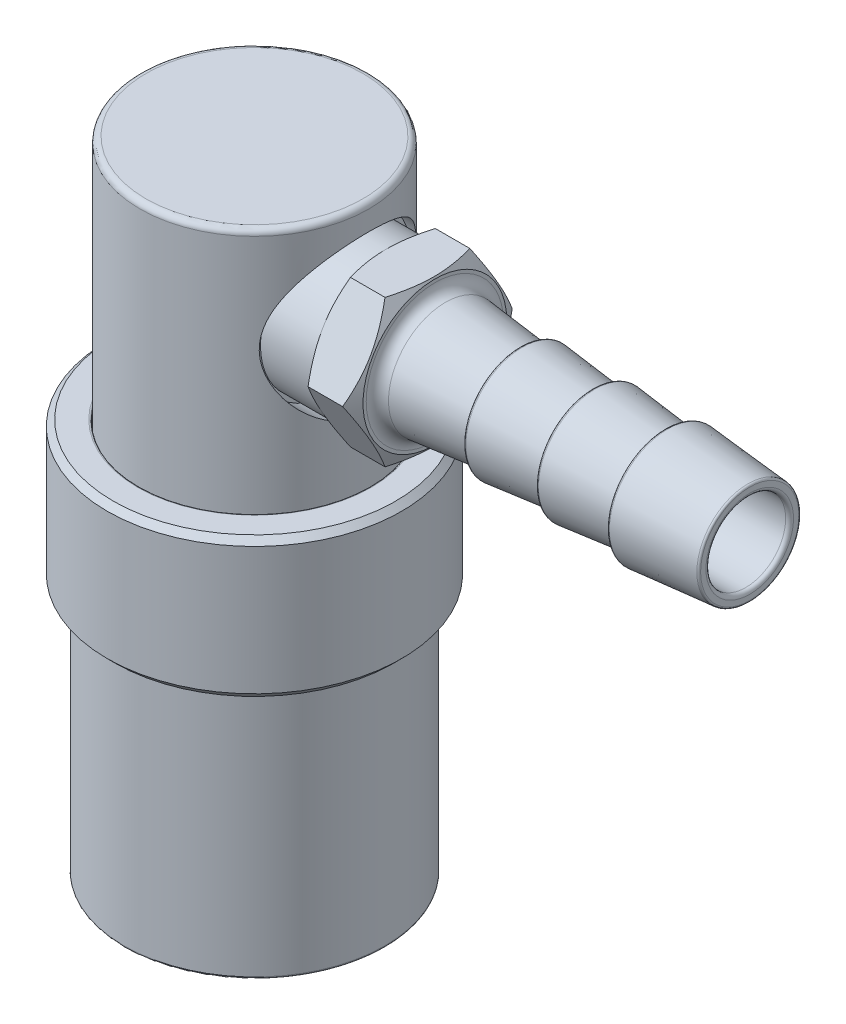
ISO-10303-21;
HEADER;
FILE_DESCRIPTION(('STEP AP214'),'2;1');
FILE_NAME('part.step','',(''),(''),'','','');
FILE_SCHEMA(('AUTOMOTIVE_DESIGN { 1 0 10303 214 1 1 1 1 }'));
ENDSEC;
DATA;
#1=APPLICATION_CONTEXT('core data for automotive mechanical design processes');
#2=APPLICATION_PROTOCOL_DEFINITION('international standard','automotive_design',2000,#1);
#3=PRODUCT_CONTEXT('',#1,'mechanical');
#4=PRODUCT('Part','Part','',(#3));
#5=PRODUCT_RELATED_PRODUCT_CATEGORY('part','',(#4));
#6=PRODUCT_DEFINITION_FORMATION('','',#4);
#7=PRODUCT_DEFINITION_CONTEXT('part definition',#1,'design');
#8=PRODUCT_DEFINITION('design','',#6,#7);
#9=PRODUCT_DEFINITION_SHAPE('','',#8);
#10=(LENGTH_UNIT() NAMED_UNIT(*) SI_UNIT(.MILLI.,.METRE.));
#11=(NAMED_UNIT(*) PLANE_ANGLE_UNIT() SI_UNIT($,.RADIAN.));
#12=(NAMED_UNIT(*) SI_UNIT($,.STERADIAN.) SOLID_ANGLE_UNIT());
#13=UNCERTAINTY_MEASURE_WITH_UNIT(LENGTH_MEASURE(1.E-05),#10,'distance_accuracy_value','');
#14=(GEOMETRIC_REPRESENTATION_CONTEXT(3) GLOBAL_UNCERTAINTY_ASSIGNED_CONTEXT((#13)) GLOBAL_UNIT_ASSIGNED_CONTEXT((#10,
#11,#12)) REPRESENTATION_CONTEXT('',''));
#15=CARTESIAN_POINT('',(0.,0.,0.));
#16=DIRECTION('',(0.,0.,1.));
#17=DIRECTION('',(1.,0.,0.));
#18=AXIS2_PLACEMENT_3D('',#15,#16,#17);
#19=CARTESIAN_POINT('',(12.458304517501,34.483774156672,0.024886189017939));
#20=DIRECTION('',(-1.,0.,0.));
#21=DIRECTION('',(0.,0.,-1.));
#22=AXIS2_PLACEMENT_3D('',#19,#20,#21);
#23=TOROIDAL_SURFACE('',#22,4.44120276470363,0.762);
#24=CARTESIAN_POINT('',(12.3785374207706,34.483774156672,0.0248861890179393));
#25=DIRECTION('',(-1.,0.,0.));
#26=DIRECTION('',(0.,0.,1.));
#27=AXIS2_PLACEMENT_3D('',#24,#25,#26);
#28=CIRCLE('',#27,3.68338932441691);
#29=CARTESIAN_POINT('',(12.3785374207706,34.483774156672,-3.65850313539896));
#30=VERTEX_POINT('',#29);
#31=CARTESIAN_POINT('',(12.3785374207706,34.483774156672,3.70827551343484));
#32=VERTEX_POINT('',#31);
#33=EDGE_CURVE('P0_E11',#30,#32,#28,.T.);
#34=ORIENTED_EDGE('',*,*,#33,.T.);
#35=CARTESIAN_POINT('',(12.458304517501,34.483774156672,4.46608895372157));
#36=DIRECTION('',(0.,1.,0.));
#37=DIRECTION('',(0.,0.,1.));
#38=AXIS2_PLACEMENT_3D('',#35,#36,#37);
#39=CIRCLE('',#38,0.762);
#40=CARTESIAN_POINT('',(11.696304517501,34.483774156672,4.46608895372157));
#41=VERTEX_POINT('',#40);
#42=EDGE_CURVE('P0_E27',#32,#41,#39,.T.);
#43=ORIENTED_EDGE('',*,*,#42,.T.);
#44=CARTESIAN_POINT('',(11.696304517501,34.483774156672,0.0248861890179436));
#45=DIRECTION('',(1.,0.,0.));
#46=DIRECTION('',(0.,0.,1.));
#47=AXIS2_PLACEMENT_3D('',#44,#45,#46);
#48=CIRCLE('',#47,4.44120276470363);
#49=CARTESIAN_POINT('',(11.696304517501,34.483774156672,-4.41631657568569));
#50=VERTEX_POINT('',#49);
#51=EDGE_CURVE('P0_E20',#41,#50,#48,.T.);
#52=ORIENTED_EDGE('',*,*,#51,.T.);
#53=CARTESIAN_POINT('',(11.696304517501,34.483774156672,0.0248861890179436));
#54=DIRECTION('',(1.,0.,0.));
#55=DIRECTION('',(0.,0.,1.));
#56=AXIS2_PLACEMENT_3D('',#53,#54,#55);
#57=CIRCLE('',#56,4.44120276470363);
#58=EDGE_CURVE('P0_E486',#50,#41,#57,.T.);
#59=ORIENTED_EDGE('',*,*,#58,.T.);
#60=ORIENTED_EDGE('',*,*,#42,.F.);
#61=CARTESIAN_POINT('',(12.3785374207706,34.483774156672,0.0248861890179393));
#62=DIRECTION('',(-1.,0.,0.));
#63=DIRECTION('',(0.,0.,1.));
#64=AXIS2_PLACEMENT_3D('',#61,#62,#63);
#65=CIRCLE('',#64,3.68338932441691);
#66=EDGE_CURVE('P0_E41',#32,#30,#65,.T.);
#67=ORIENTED_EDGE('',*,*,#66,.T.);
#68=EDGE_LOOP('',(#34,#43,#52,#59,#60,#67));
#69=FACE_BOUND('',#68,.T.);
#70=ADVANCED_FACE('P0_F16',(#69),#23,.F.);
#71=CARTESIAN_POINT('',(11.696304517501,34.483774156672,-5.94411381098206));
#72=DIRECTION('',(1.,0.,0.));
#73=DIRECTION('',(0.,-1.,0.));
#74=AXIS2_PLACEMENT_3D('',#71,#72,#73);
#75=PLANE('',#74);
#76=CARTESIAN_POINT('',(11.696304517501,34.483774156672,0.0248861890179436));
#77=DIRECTION('',(-1.,0.,0.));
#78=DIRECTION('',(0.,0.,1.));
#79=AXIS2_PLACEMENT_3D('',#76,#77,#78);
#80=CIRCLE('',#79,4.64917728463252);
#81=CARTESIAN_POINT('',(11.696304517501,34.483774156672,-4.62429109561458));
#82=VERTEX_POINT('',#81);
#83=EDGE_CURVE('P0_E216',#82,#82,#80,.T.);
#84=ORIENTED_EDGE('',*,*,#83,.F.);
#85=EDGE_LOOP('',(#84));
#86=FACE_BOUND('',#85,.T.);
#87=ORIENTED_EDGE('',*,*,#58,.F.);
#88=ORIENTED_EDGE('',*,*,#51,.F.);
#89=EDGE_LOOP('',(#87,#88));
#90=FACE_BOUND('',#89,.T.);
#91=ADVANCED_FACE('P0_F500',(#86,#90),#75,.T.);
#92=CARTESIAN_POINT('',(14.4523531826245,34.483774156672,0.0248861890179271));
#93=DIRECTION('',(-1.,0.,0.));
#94=DIRECTION('',(0.,0.,-1.));
#95=AXIS2_PLACEMENT_3D('',#92,#93,#94);
#96=CONICAL_SURFACE('',#95,3.46510042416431,0.104873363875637);
#97=ORIENTED_EDGE('',*,*,#33,.F.);
#98=ORIENTED_EDGE('',*,*,#66,.F.);
#99=DIRECTION('',(0.994505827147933,0.,-0.10468122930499));
#100=VECTOR('',#99,1.);
#101=CARTESIAN_POINT('',(14.4523531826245,34.483774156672,3.48998661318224));
#102=LINE('',#101,#100);
#103=CARTESIAN_POINT('',(17.208401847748,34.483774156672,3.19988618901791));
#104=VERTEX_POINT('',#103);
#105=EDGE_CURVE('P0_E231',#32,#104,#102,.T.);
#106=ORIENTED_EDGE('',*,*,#105,.T.);
#107=CARTESIAN_POINT('',(17.208401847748,34.483774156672,0.0248861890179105));
#108=DIRECTION('',(-1.,0.,0.));
#109=DIRECTION('',(0.,-1.,0.));
#110=AXIS2_PLACEMENT_3D('',#107,#108,#109);
#111=CIRCLE('',#110,3.175);
#112=CARTESIAN_POINT('',(17.208401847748,34.483774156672,-3.15011381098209));
#113=VERTEX_POINT('',#112);
#114=EDGE_CURVE('P0_E234',#104,#113,#111,.T.);
#115=ORIENTED_EDGE('',*,*,#114,.T.);
#116=CARTESIAN_POINT('',(17.208401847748,34.483774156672,0.0248861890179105));
#117=DIRECTION('',(-1.,0.,0.));
#118=DIRECTION('',(0.,-1.,0.));
#119=AXIS2_PLACEMENT_3D('',#116,#117,#118);
#120=CIRCLE('',#119,3.175);
#121=EDGE_CURVE('P0_E263',#113,#104,#120,.T.);
#122=ORIENTED_EDGE('',*,*,#121,.T.);
#123=ORIENTED_EDGE('',*,*,#105,.F.);
#124=EDGE_LOOP('',(#97,#98,#106,#115,#122,#123));
#125=FACE_BOUND('',#124,.T.);
#126=ADVANCED_FACE('P0_F502',(#125),#96,.T.);
#127=CARTESIAN_POINT('',(31.8131474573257,34.483774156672,0.0248861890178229));
#128=DIRECTION('',(-1.,0.,0.));
#129=DIRECTION('',(0.,0.,-1.));
#130=AXIS2_PLACEMENT_3D('',#127,#128,#129);
#131=TOROIDAL_SURFACE('',#130,2.8321,0.254);
#132=CARTESIAN_POINT('',(32.0671474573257,34.483774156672,0.0248861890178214));
#133=DIRECTION('',(1.,0.,0.));
#134=DIRECTION('',(0.,0.,1.));
#135=AXIS2_PLACEMENT_3D('',#132,#133,#134);
#136=CIRCLE('',#135,2.8321);
#137=CARTESIAN_POINT('',(32.0671474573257,34.483774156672,-2.80721381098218));
#138=VERTEX_POINT('',#137);
#139=CARTESIAN_POINT('',(32.0671474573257,34.483774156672,2.85698618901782));
#140=VERTEX_POINT('',#139);
#141=EDGE_CURVE('P0_E345',#138,#140,#136,.T.);
#142=ORIENTED_EDGE('',*,*,#141,.T.);
#143=CARTESIAN_POINT('',(31.8131474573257,34.483774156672,2.85698618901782));
#144=DIRECTION('',(0.,1.,0.));
#145=DIRECTION('',(0.,0.,1.));
#146=AXIS2_PLACEMENT_3D('',#143,#144,#145);
#147=CIRCLE('',#146,0.254);
#148=CARTESIAN_POINT('',(31.8131474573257,34.483774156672,2.60298618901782));
#149=VERTEX_POINT('',#148);
#150=EDGE_CURVE('P0_E405',#140,#149,#147,.T.);
#151=ORIENTED_EDGE('',*,*,#150,.T.);
#152=CARTESIAN_POINT('',(31.8131474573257,34.483774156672,0.0248861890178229));
#153=DIRECTION('',(-1.,0.,0.));
#154=DIRECTION('',(0.,0.,1.));
#155=AXIS2_PLACEMENT_3D('',#152,#153,#154);
#156=CIRCLE('',#155,2.5781);
#157=CARTESIAN_POINT('',(31.8131474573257,34.483774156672,-2.55321381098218));
#158=VERTEX_POINT('',#157);
#159=EDGE_CURVE('P0_E409',#149,#158,#156,.T.);
#160=ORIENTED_EDGE('',*,*,#159,.T.);
#161=CARTESIAN_POINT('',(31.8131474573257,34.483774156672,0.0248861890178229));
#162=DIRECTION('',(-1.,0.,0.));
#163=DIRECTION('',(0.,0.,1.));
#164=AXIS2_PLACEMENT_3D('',#161,#162,#163);
#165=CIRCLE('',#164,2.5781);
#166=EDGE_CURVE('P0_E431',#158,#149,#165,.T.);
#167=ORIENTED_EDGE('',*,*,#166,.T.);
#168=ORIENTED_EDGE('',*,*,#150,.F.);
#169=CARTESIAN_POINT('',(32.0671474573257,34.483774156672,0.0248861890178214));
#170=DIRECTION('',(1.,0.,0.));
#171=DIRECTION('',(0.,0.,1.));
#172=AXIS2_PLACEMENT_3D('',#169,#170,#171);
#173=CIRCLE('',#172,2.8321);
#174=EDGE_CURVE('P0_E432',#140,#138,#173,.T.);
#175=ORIENTED_EDGE('',*,*,#174,.T.);
#176=EDGE_LOOP('',(#142,#151,#160,#167,#168,#175));
#177=FACE_BOUND('',#176,.T.);
#178=ADVANCED_FACE('P0_F509',(#177),#131,.T.);
#179=CARTESIAN_POINT('',(17.1192260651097,34.483774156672,0.0248861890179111));
#180=DIRECTION('',(-1.,0.,0.));
#181=DIRECTION('',(0.,0.,-1.));
#182=AXIS2_PLACEMENT_3D('',#179,#180,#181);
#183=CYLINDRICAL_SURFACE('',#182,2.5781);
#184=CARTESIAN_POINT('',(2.425304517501,34.483774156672,0.0248861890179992));
#185=DIRECTION('',(1.,0.,0.));
#186=DIRECTION('',(0.,0.,1.));
#187=AXIS2_PLACEMENT_3D('',#184,#185,#186);
#188=CIRCLE('',#187,2.5781);
#189=CARTESIAN_POINT('',(2.42530451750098,34.483774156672,-2.553213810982));
#190=VERTEX_POINT('',#189);
#191=CARTESIAN_POINT('',(2.42530451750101,34.483774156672,2.602986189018));
#192=VERTEX_POINT('',#191);
#193=EDGE_CURVE('P0_E199',#190,#192,#188,.T.);
#194=ORIENTED_EDGE('',*,*,#193,.F.);
#195=CARTESIAN_POINT('',(2.425304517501,34.483774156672,0.0248861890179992));
#196=DIRECTION('',(1.,0.,0.));
#197=DIRECTION('',(0.,0.,1.));
#198=AXIS2_PLACEMENT_3D('',#195,#196,#197);
#199=CIRCLE('',#198,2.5781);
#200=EDGE_CURVE('P0_E268',#192,#190,#199,.T.);
#201=ORIENTED_EDGE('',*,*,#200,.F.);
#202=DIRECTION('',(1.,0.,0.));
#203=VECTOR('',#202,1.);
#204=CARTESIAN_POINT('',(17.1192260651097,34.483774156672,2.60298618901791));
#205=LINE('',#204,#203);
#206=EDGE_CURVE('P0_E435',#192,#149,#205,.T.);
#207=ORIENTED_EDGE('',*,*,#206,.T.);
#208=ORIENTED_EDGE('',*,*,#166,.F.);
#209=ORIENTED_EDGE('',*,*,#159,.F.);
#210=ORIENTED_EDGE('',*,*,#206,.F.);
#211=EDGE_LOOP('',(#194,#201,#207,#208,#209,#210));
#212=FACE_BOUND('',#211,.T.);
#213=ADVANCED_FACE('P0_F557',(#212),#183,.F.);
#214=CARTESIAN_POINT('',(32.0671474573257,34.483774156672,-3.26955306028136));
#215=DIRECTION('',(1.,0.,0.));
#216=DIRECTION('',(0.,-1.,0.));
#217=AXIS2_PLACEMENT_3D('',#214,#215,#216);
#218=PLANE('',#217);
#219=CARTESIAN_POINT('',(32.0671474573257,34.483774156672,0.0248861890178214));
#220=DIRECTION('',(-1.,0.,0.));
#221=DIRECTION('',(0.,0.,1.));
#222=AXIS2_PLACEMENT_3D('',#219,#220,#221);
#223=CIRCLE('',#222,3.17806519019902);
#224=CARTESIAN_POINT('',(32.0671474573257,34.483774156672,-3.1531790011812));
#225=VERTEX_POINT('',#224);
#226=CARTESIAN_POINT('',(32.0671474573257,34.483774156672,3.20295137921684));
#227=VERTEX_POINT('',#226);
#228=EDGE_CURVE('P0_E402',#225,#227,#223,.T.);
#229=ORIENTED_EDGE('',*,*,#228,.F.);
#230=CARTESIAN_POINT('',(32.0671474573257,34.483774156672,0.0248861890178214));
#231=DIRECTION('',(-1.,0.,0.));
#232=DIRECTION('',(0.,0.,1.));
#233=AXIS2_PLACEMENT_3D('',#230,#231,#232);
#234=CIRCLE('',#233,3.17806519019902);
#235=EDGE_CURVE('P0_E251',#227,#225,#234,.T.);
#236=ORIENTED_EDGE('',*,*,#235,.F.);
#237=EDGE_LOOP('',(#229,#236));
#238=FACE_BOUND('',#237,.T.);
#239=ORIENTED_EDGE('',*,*,#141,.F.);
#240=ORIENTED_EDGE('',*,*,#174,.F.);
#241=EDGE_LOOP('',(#239,#240));
#242=FACE_BOUND('',#241,.T.);
#243=ADVANCED_FACE('P0_F552',(#238,#242),#218,.T.);
#244=CARTESIAN_POINT('',(2.425304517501,34.483774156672,0.0248861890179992));
#245=DIRECTION('',(-1.,0.,0.));
#246=DIRECTION('',(0.,0.,-1.));
#247=AXIS2_PLACEMENT_3D('',#244,#245,#246);
#248=TOROIDAL_SURFACE('',#247,2.8321,0.254);
#249=ORIENTED_EDGE('',*,*,#193,.T.);
#250=CARTESIAN_POINT('',(2.42530451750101,34.483774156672,2.856986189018));
#251=DIRECTION('',(0.,1.,0.));
#252=DIRECTION('',(0.,0.,1.));
#253=AXIS2_PLACEMENT_3D('',#250,#251,#252);
#254=CIRCLE('',#253,0.254);
#255=CARTESIAN_POINT('',(2.17130451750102,34.483774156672,2.856986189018));
#256=VERTEX_POINT('',#255);
#257=EDGE_CURVE('P0_E193',#192,#256,#254,.T.);
#258=ORIENTED_EDGE('',*,*,#257,.T.);
#259=CARTESIAN_POINT('',(2.171304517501,34.483774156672,0.0248861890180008));
#260=DIRECTION('',(-1.,0.,0.));
#261=DIRECTION('',(0.,0.,1.));
#262=AXIS2_PLACEMENT_3D('',#259,#260,#261);
#263=CIRCLE('',#262,2.8321);
#264=CARTESIAN_POINT('',(2.17130451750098,34.483774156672,-2.807213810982));
#265=VERTEX_POINT('',#264);
#266=EDGE_CURVE('P0_E200',#256,#265,#263,.T.);
#267=ORIENTED_EDGE('',*,*,#266,.T.);
#268=CARTESIAN_POINT('',(2.171304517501,34.483774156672,0.0248861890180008));
#269=DIRECTION('',(-1.,0.,0.));
#270=DIRECTION('',(0.,0.,1.));
#271=AXIS2_PLACEMENT_3D('',#268,#269,#270);
#272=CIRCLE('',#271,2.8321);
#273=EDGE_CURVE('P0_E269',#265,#256,#272,.T.);
#274=ORIENTED_EDGE('',*,*,#273,.T.);
#275=ORIENTED_EDGE('',*,*,#257,.F.);
#276=ORIENTED_EDGE('',*,*,#200,.T.);
#277=EDGE_LOOP('',(#249,#258,#267,#274,#275,#276));
#278=FACE_BOUND('',#277,.T.);
#279=ADVANCED_FACE('P0_F522',(#278),#248,.T.);
#280=CARTESIAN_POINT('',(2.17130451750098,34.483774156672,-2.553213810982));
#281=DIRECTION('',(-1.,0.,0.));
#282=DIRECTION('',(0.,0.,-1.));
#283=AXIS2_PLACEMENT_3D('',#280,#281,#282);
#284=PLANE('',#283);
#285=CARTESIAN_POINT('',(2.171304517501,34.483774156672,0.0248861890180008));
#286=DIRECTION('',(1.,0.,0.));
#287=DIRECTION('',(0.,0.,1.));
#288=AXIS2_PLACEMENT_3D('',#285,#286,#287);
#289=CIRCLE('',#288,3.937);
#290=CARTESIAN_POINT('',(2.17130451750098,34.483774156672,-3.912113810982));
#291=VERTEX_POINT('',#290);
#292=EDGE_CURVE('P0_E306',#291,#291,#289,.T.);
#293=ORIENTED_EDGE('',*,*,#292,.F.);
#294=EDGE_LOOP('',(#293));
#295=FACE_BOUND('',#294,.T.);
#296=ORIENTED_EDGE('',*,*,#273,.F.);
#297=ORIENTED_EDGE('',*,*,#266,.F.);
#298=EDGE_LOOP('',(#296,#297));
#299=FACE_BOUND('',#298,.T.);
#300=ADVANCED_FACE('P0_F518',(#295,#299),#284,.T.);
#301=CARTESIAN_POINT('',(17.3416515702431,34.483774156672,0.0248861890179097));
#302=DIRECTION('',(-1.,0.,0.));
#303=DIRECTION('',(0.,0.,-1.));
#304=AXIS2_PLACEMENT_3D('',#301,#302,#303);
#305=TOROIDAL_SURFACE('',#304,3.52880393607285,0.127);
#306=CARTESIAN_POINT('',(17.2146712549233,34.483774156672,0.0248861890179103));
#307=DIRECTION('',(1.,0.,0.));
#308=DIRECTION('',(0.,0.,1.));
#309=AXIS2_PLACEMENT_3D('',#306,#307,#308);
#310=CIRCLE('',#309,3.53103989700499);
#311=CARTESIAN_POINT('',(17.2146712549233,34.483774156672,-3.50615370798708));
#312=VERTEX_POINT('',#311);
#313=CARTESIAN_POINT('',(17.2146712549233,34.483774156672,3.5559260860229));
#314=VERTEX_POINT('',#313);
#315=EDGE_CURVE('P0_E264',#312,#314,#310,.T.);
#316=ORIENTED_EDGE('',*,*,#315,.T.);
#317=CARTESIAN_POINT('',(17.3416515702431,34.483774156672,3.55369012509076));
#318=DIRECTION('',(0.,1.,0.));
#319=DIRECTION('',(0.,0.,1.));
#320=AXIS2_PLACEMENT_3D('',#317,#318,#319);
#321=CIRCLE('',#320,0.127);
#322=CARTESIAN_POINT('',(17.3549460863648,34.483774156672,3.67999236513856));
#323=VERTEX_POINT('',#322);
#324=EDGE_CURVE('P0_E229',#314,#323,#321,.T.);
#325=ORIENTED_EDGE('',*,*,#324,.T.);
#326=CARTESIAN_POINT('',(17.3549460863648,34.483774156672,0.0248861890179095));
#327=DIRECTION('',(-1.,0.,0.));
#328=DIRECTION('',(0.,0.,1.));
#329=AXIS2_PLACEMENT_3D('',#326,#327,#328);
#330=CIRCLE('',#329,3.65510617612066);
#331=CARTESIAN_POINT('',(17.3549460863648,34.483774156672,-3.63021998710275));
#332=VERTEX_POINT('',#331);
#333=EDGE_CURVE('P0_E225',#323,#332,#330,.T.);
#334=ORIENTED_EDGE('',*,*,#333,.T.);
#335=CARTESIAN_POINT('',(17.3549460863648,34.483774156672,0.0248861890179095));
#336=DIRECTION('',(-1.,0.,0.));
#337=DIRECTION('',(0.,0.,1.));
#338=AXIS2_PLACEMENT_3D('',#335,#336,#337);
#339=CIRCLE('',#338,3.65510617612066);
#340=EDGE_CURVE('P0_E230',#332,#323,#339,.T.);
#341=ORIENTED_EDGE('',*,*,#340,.T.);
#342=ORIENTED_EDGE('',*,*,#324,.F.);
#343=CARTESIAN_POINT('',(17.2146712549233,34.483774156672,0.0248861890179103));
#344=DIRECTION('',(1.,0.,0.));
#345=DIRECTION('',(0.,0.,1.));
#346=AXIS2_PLACEMENT_3D('',#343,#344,#345);
#347=CIRCLE('',#346,3.53103989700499);
#348=EDGE_CURVE('P0_E238',#314,#312,#347,.T.);
#349=ORIENTED_EDGE('',*,*,#348,.T.);
#350=EDGE_LOOP('',(#316,#325,#334,#341,#342,#349));
#351=FACE_BOUND('',#350,.T.);
#352=ADVANCED_FACE('P0_F521',(#351),#305,.T.);
#353=CARTESIAN_POINT('',(19.5666113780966,34.483774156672,0.0248861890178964));
#354=DIRECTION('',(-1.,0.,0.));
#355=DIRECTION('',(0.,0.,-1.));
#356=AXIS2_PLACEMENT_3D('',#353,#354,#355);
#357=CONICAL_SURFACE('',#356,3.42230729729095,0.104873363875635);
#358=ORIENTED_EDGE('',*,*,#340,.F.);
#359=ORIENTED_EDGE('',*,*,#333,.F.);
#360=DIRECTION('',(0.994505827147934,0.,-0.104681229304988));
#361=VECTOR('',#360,1.);
#362=CARTESIAN_POINT('',(19.5666113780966,34.483774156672,3.44719348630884));
#363=LINE('',#362,#361);
#364=CARTESIAN_POINT('',(21.9161113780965,34.483774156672,3.19988618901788));
#365=VERTEX_POINT('',#364);
#366=EDGE_CURVE('P0_E241',#323,#365,#363,.T.);
#367=ORIENTED_EDGE('',*,*,#366,.T.);
#368=CARTESIAN_POINT('',(21.9161113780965,34.483774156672,0.0248861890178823));
#369=DIRECTION('',(-1.,0.,0.));
#370=DIRECTION('',(0.,-1.,0.));
#371=AXIS2_PLACEMENT_3D('',#368,#369,#370);
#372=CIRCLE('',#371,3.175);
#373=CARTESIAN_POINT('',(21.9161113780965,34.483774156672,-3.15011381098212));
#374=VERTEX_POINT('',#373);
#375=EDGE_CURVE('P0_E245',#365,#374,#372,.T.);
#376=ORIENTED_EDGE('',*,*,#375,.T.);
#377=CARTESIAN_POINT('',(21.9161113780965,34.483774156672,0.0248861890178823));
#378=DIRECTION('',(-1.,0.,0.));
#379=DIRECTION('',(0.,-1.,0.));
#380=AXIS2_PLACEMENT_3D('',#377,#378,#379);
#381=CIRCLE('',#380,3.175);
#382=EDGE_CURVE('P0_E353',#374,#365,#381,.T.);
#383=ORIENTED_EDGE('',*,*,#382,.T.);
#384=ORIENTED_EDGE('',*,*,#366,.F.);
#385=EDGE_LOOP('',(#358,#359,#367,#376,#383,#384));
#386=FACE_BOUND('',#385,.T.);
#387=ADVANCED_FACE('P0_F528',(#386),#357,.T.);
#388=CARTESIAN_POINT('',(17.2127566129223,34.483774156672,0.0248861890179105));
#389=DIRECTION('',(1.,0.,0.));
#390=DIRECTION('',(0.,0.,-1.));
#391=AXIS2_PLACEMENT_3D('',#388,#389,#390);
#392=CONICAL_SURFACE('',#391,3.42230729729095,1.55318942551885);
#393=ORIENTED_EDGE('',*,*,#121,.F.);
#394=ORIENTED_EDGE('',*,*,#114,.F.);
#395=DIRECTION('',(0.0176059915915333,0.,0.99984500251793));
#396=VECTOR('',#395,1.);
#397=CARTESIAN_POINT('',(17.2127566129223,34.483774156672,3.44719348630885));
#398=LINE('',#397,#396);
#399=EDGE_CURVE('P0_E349',#104,#314,#398,.T.);
#400=ORIENTED_EDGE('',*,*,#399,.T.);
#401=ORIENTED_EDGE('',*,*,#315,.F.);
#402=ORIENTED_EDGE('',*,*,#348,.F.);
#403=ORIENTED_EDGE('',*,*,#399,.F.);
#404=EDGE_LOOP('',(#393,#394,#400,#401,#402,#403));
#405=FACE_BOUND('',#404,.T.);
#406=ADVANCED_FACE('P0_F524',(#405),#392,.T.);
#407=CARTESIAN_POINT('',(22.0370170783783,34.483774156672,0.0248861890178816));
#408=DIRECTION('',(-1.,0.,0.));
#409=DIRECTION('',(0.,0.,-1.));
#410=AXIS2_PLACEMENT_3D('',#407,#408,#409);
#411=TOROIDAL_SURFACE('',#410,3.52828814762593,0.127);
#412=CARTESIAN_POINT('',(21.9100360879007,34.483774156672,0.0248861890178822));
#413=DIRECTION('',(1.,0.,0.));
#414=DIRECTION('',(0.,0.,1.));
#415=AXIS2_PLACEMENT_3D('',#412,#413,#414);
#416=CIRCLE('',#415,3.52609086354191);
#417=CARTESIAN_POINT('',(21.9100360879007,34.483774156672,-3.50120467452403));
#418=VERTEX_POINT('',#417);
#419=CARTESIAN_POINT('',(21.9100360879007,34.483774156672,3.55097705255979));
#420=VERTEX_POINT('',#419);
#421=EDGE_CURVE('P0_E295',#418,#420,#416,.T.);
#422=ORIENTED_EDGE('',*,*,#421,.T.);
#423=CARTESIAN_POINT('',(22.0370170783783,34.483774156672,3.55317433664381));
#424=DIRECTION('',(0.,1.,0.));
#425=DIRECTION('',(0.,0.,1.));
#426=AXIS2_PLACEMENT_3D('',#423,#424,#425);
#427=CIRCLE('',#426,0.127);
#428=CARTESIAN_POINT('',(22.0503116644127,34.483774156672,3.67947656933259));
#429=VERTEX_POINT('',#428);
#430=EDGE_CURVE('P0_E291',#420,#429,#427,.T.);
#431=ORIENTED_EDGE('',*,*,#430,.T.);
#432=CARTESIAN_POINT('',(22.0503116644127,34.483774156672,0.0248861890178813));
#433=DIRECTION('',(-1.,0.,0.));
#434=DIRECTION('',(0.,0.,1.));
#435=AXIS2_PLACEMENT_3D('',#432,#433,#434);
#436=CIRCLE('',#435,3.6545903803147);
#437=CARTESIAN_POINT('',(22.0503116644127,34.483774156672,-3.62970419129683));
#438=VERTEX_POINT('',#437);
#439=EDGE_CURVE('P0_E296',#429,#438,#436,.T.);
#440=ORIENTED_EDGE('',*,*,#439,.T.);
#441=CARTESIAN_POINT('',(22.0503116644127,34.483774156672,0.0248861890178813));
#442=DIRECTION('',(-1.,0.,0.));
#443=DIRECTION('',(0.,0.,1.));
#444=AXIS2_PLACEMENT_3D('',#441,#442,#443);
#445=CIRCLE('',#444,3.6545903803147);
#446=EDGE_CURVE('P0_E333',#438,#429,#445,.T.);
#447=ORIENTED_EDGE('',*,*,#446,.T.);
#448=ORIENTED_EDGE('',*,*,#430,.F.);
#449=CARTESIAN_POINT('',(21.9100360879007,34.483774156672,0.0248861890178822));
#450=DIRECTION('',(1.,0.,0.));
#451=DIRECTION('',(0.,0.,1.));
#452=AXIS2_PLACEMENT_3D('',#449,#450,#451);
#453=CIRCLE('',#452,3.52609086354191);
#454=EDGE_CURVE('P0_E329',#420,#418,#453,.T.);
#455=ORIENTED_EDGE('',*,*,#454,.T.);
#456=EDGE_LOOP('',(#422,#431,#440,#447,#448,#455));
#457=FACE_BOUND('',#456,.T.);
#458=ADVANCED_FACE('P0_F527',(#457),#411,.T.);
#459=CARTESIAN_POINT('',(24.2570525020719,34.483774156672,0.0248861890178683));
#460=DIRECTION('',(-1.,0.,0.));
#461=DIRECTION('',(0.,0.,-1.));
#462=AXIS2_PLACEMENT_3D('',#459,#460,#461);
#463=CONICAL_SURFACE('',#462,3.4223086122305,0.104873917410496);
#464=ORIENTED_EDGE('',*,*,#446,.F.);
#465=ORIENTED_EDGE('',*,*,#439,.F.);
#466=DIRECTION('',(0.994505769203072,0.,-0.104681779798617));
#467=VECTOR('',#466,1.);
#468=CARTESIAN_POINT('',(24.2570525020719,34.483774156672,3.44719480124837));
#469=LINE('',#468,#467);
#470=CARTESIAN_POINT('',(26.6065525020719,34.483774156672,3.19988618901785));
#471=VERTEX_POINT('',#470);
#472=EDGE_CURVE('P0_E320',#429,#471,#469,.T.);
#473=ORIENTED_EDGE('',*,*,#472,.T.);
#474=CARTESIAN_POINT('',(26.6065525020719,34.483774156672,0.0248861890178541));
#475=DIRECTION('',(-1.,0.,0.));
#476=DIRECTION('',(0.,-1.,0.));
#477=AXIS2_PLACEMENT_3D('',#474,#475,#476);
#478=CIRCLE('',#477,3.175);
#479=CARTESIAN_POINT('',(26.6065525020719,34.483774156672,-3.15011381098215));
#480=VERTEX_POINT('',#479);
#481=EDGE_CURVE('P0_E316',#471,#480,#478,.T.);
#482=ORIENTED_EDGE('',*,*,#481,.T.);
#483=CARTESIAN_POINT('',(26.6065525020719,34.483774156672,0.0248861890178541));
#484=DIRECTION('',(-1.,0.,0.));
#485=DIRECTION('',(0.,-1.,0.));
#486=AXIS2_PLACEMENT_3D('',#483,#484,#485);
#487=CIRCLE('',#486,3.175);
#488=EDGE_CURVE('P0_E301',#480,#471,#487,.T.);
#489=ORIENTED_EDGE('',*,*,#488,.T.);
#490=ORIENTED_EDGE('',*,*,#472,.F.);
#491=EDGE_LOOP('',(#464,#465,#473,#482,#489,#490));
#492=FACE_BOUND('',#491,.T.);
#493=ADVANCED_FACE('P0_F535',(#492),#463,.T.);
#494=CARTESIAN_POINT('',(21.9118319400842,34.483774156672,0.0248861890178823));
#495=DIRECTION('',(-1.,0.,0.));
#496=DIRECTION('',(0.,0.,-1.));
#497=AXIS2_PLACEMENT_3D('',#494,#495,#496);
#498=CONICAL_SURFACE('',#497,3.4223086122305,1.5534940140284);
#499=ORIENTED_EDGE('',*,*,#421,.F.);
#500=ORIENTED_EDGE('',*,*,#454,.F.);
#501=DIRECTION('',(0.017301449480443,0.,-0.999850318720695));
#502=VECTOR('',#501,1.);
#503=CARTESIAN_POINT('',(21.9118319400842,34.483774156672,3.44719480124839));
#504=LINE('',#503,#502);
#505=EDGE_CURVE('P0_E297',#420,#365,#504,.T.);
#506=ORIENTED_EDGE('',*,*,#505,.T.);
#507=ORIENTED_EDGE('',*,*,#382,.F.);
#508=ORIENTED_EDGE('',*,*,#375,.F.);
#509=ORIENTED_EDGE('',*,*,#505,.F.);
#510=EDGE_LOOP('',(#499,#500,#506,#507,#508,#509));
#511=FACE_BOUND('',#510,.T.);
#512=ADVANCED_FACE('P0_F538',(#511),#498,.F.);
#513=CARTESIAN_POINT('',(26.7335525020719,34.483774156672,0.0248861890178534));
#514=DIRECTION('',(-1.,0.,0.));
#515=DIRECTION('',(0.,0.,-1.));
#516=AXIS2_PLACEMENT_3D('',#513,#514,#515);
#517=TOROIDAL_SURFACE('',#516,3.63358322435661,0.127);
#518=CARTESIAN_POINT('',(26.6065525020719,34.483774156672,0.0248861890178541));
#519=DIRECTION('',(1.,0.,0.));
#520=DIRECTION('',(0.,0.,1.));
#521=AXIS2_PLACEMENT_3D('',#518,#519,#520);
#522=CIRCLE('',#521,3.63358322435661);
#523=CARTESIAN_POINT('',(26.6065525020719,34.483774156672,-3.60869703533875));
#524=VERTEX_POINT('',#523);
#525=CARTESIAN_POINT('',(26.6065525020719,34.483774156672,3.65846941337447));
#526=VERTEX_POINT('',#525);
#527=EDGE_CURVE('P0_E302',#524,#526,#522,.T.);
#528=ORIENTED_EDGE('',*,*,#527,.T.);
#529=CARTESIAN_POINT('',(26.7335525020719,34.483774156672,3.65846941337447));
#530=DIRECTION('',(0.,1.,0.));
#531=DIRECTION('',(0.,0.,1.));
#532=AXIS2_PLACEMENT_3D('',#529,#530,#531);
#533=CIRCLE('',#532,0.127);
#534=CARTESIAN_POINT('',(26.7446212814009,34.483774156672,3.78498614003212));
#535=VERTEX_POINT('',#534);
#536=EDGE_CURVE('P0_E310',#526,#535,#533,.T.);
#537=ORIENTED_EDGE('',*,*,#536,.T.);
#538=CARTESIAN_POINT('',(26.7446212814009,34.483774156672,0.0248861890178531));
#539=DIRECTION('',(-1.,0.,0.));
#540=DIRECTION('',(0.,0.,1.));
#541=AXIS2_PLACEMENT_3D('',#538,#539,#540);
#542=CIRCLE('',#541,3.76009995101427);
#543=CARTESIAN_POINT('',(26.7446212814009,34.483774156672,-3.73521376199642));
#544=VERTEX_POINT('',#543);
#545=EDGE_CURVE('P0_E289',#535,#544,#542,.T.);
#546=ORIENTED_EDGE('',*,*,#545,.T.);
#547=CARTESIAN_POINT('',(26.7446212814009,34.483774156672,0.0248861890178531));
#548=DIRECTION('',(-1.,0.,0.));
#549=DIRECTION('',(0.,0.,1.));
#550=AXIS2_PLACEMENT_3D('',#547,#548,#549);
#551=CIRCLE('',#550,3.76009995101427);
#552=EDGE_CURVE('P0_E286',#544,#535,#551,.T.);
#553=ORIENTED_EDGE('',*,*,#552,.T.);
#554=ORIENTED_EDGE('',*,*,#536,.F.);
#555=CARTESIAN_POINT('',(26.6065525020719,34.483774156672,0.0248861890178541));
#556=DIRECTION('',(1.,0.,0.));
#557=DIRECTION('',(0.,0.,1.));
#558=AXIS2_PLACEMENT_3D('',#555,#556,#557);
#559=CIRCLE('',#558,3.63358322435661);
#560=EDGE_CURVE('P0_E290',#526,#524,#559,.T.);
#561=ORIENTED_EDGE('',*,*,#560,.T.);
#562=EDGE_LOOP('',(#528,#537,#546,#553,#554,#561));
#563=FACE_BOUND('',#562,.T.);
#564=ADVANCED_FACE('P0_F542',(#563),#517,.T.);
#565=CARTESIAN_POINT('',(29.3368500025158,34.483774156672,0.0248861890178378));
#566=DIRECTION('',(-1.,0.,0.));
#567=DIRECTION('',(0.,0.,-1.));
#568=AXIS2_PLACEMENT_3D('',#565,#566,#567);
#569=CONICAL_SURFACE('',#568,3.53330932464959,0.0872664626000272);
#570=ORIENTED_EDGE('',*,*,#552,.F.);
#571=ORIENTED_EDGE('',*,*,#545,.F.);
#572=DIRECTION('',(0.996194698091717,0.,-0.0871557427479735));
#573=VECTOR('',#572,1.);
#574=CARTESIAN_POINT('',(29.3368500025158,34.483774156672,3.55819551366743));
#575=LINE('',#574,#573);
#576=CARTESIAN_POINT('',(31.9512162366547,34.483774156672,3.32946810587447));
#577=VERTEX_POINT('',#576);
#578=EDGE_CURVE('P0_E482',#535,#577,#575,.T.);
#579=ORIENTED_EDGE('',*,*,#578,.T.);
#580=CARTESIAN_POINT('',(31.9512162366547,34.483774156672,0.0248861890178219));
#581=DIRECTION('',(1.,0.,0.));
#582=DIRECTION('',(0.,0.,1.));
#583=AXIS2_PLACEMENT_3D('',#580,#581,#582);
#584=CIRCLE('',#583,3.30458191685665);
#585=CARTESIAN_POINT('',(31.9512162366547,34.483774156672,-3.27969572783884));
#586=VERTEX_POINT('',#585);
#587=EDGE_CURVE('P0_E250',#586,#577,#584,.T.);
#588=ORIENTED_EDGE('',*,*,#587,.F.);
#589=CARTESIAN_POINT('',(31.9512162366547,34.483774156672,0.0248861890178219));
#590=DIRECTION('',(1.,0.,0.));
#591=DIRECTION('',(0.,0.,1.));
#592=AXIS2_PLACEMENT_3D('',#589,#590,#591);
#593=CIRCLE('',#592,3.30458191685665);
#594=EDGE_CURVE('P0_E324',#577,#586,#593,.T.);
#595=ORIENTED_EDGE('',*,*,#594,.F.);
#596=ORIENTED_EDGE('',*,*,#578,.F.);
#597=EDGE_LOOP('',(#570,#571,#579,#588,#595,#596));
#598=FACE_BOUND('',#597,.T.);
#599=ADVANCED_FACE('P0_F545',(#598),#569,.T.);
#600=CARTESIAN_POINT('',(26.6065525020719,34.483774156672,-3.15011381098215));
#601=DIRECTION('',(-1.,0.,0.));
#602=DIRECTION('',(0.,0.,-1.));
#603=AXIS2_PLACEMENT_3D('',#600,#601,#602);
#604=PLANE('',#603);
#605=ORIENTED_EDGE('',*,*,#527,.F.);
#606=ORIENTED_EDGE('',*,*,#560,.F.);
#607=EDGE_LOOP('',(#605,#606));
#608=FACE_BOUND('',#607,.T.);
#609=ORIENTED_EDGE('',*,*,#488,.F.);
#610=ORIENTED_EDGE('',*,*,#481,.F.);
#611=EDGE_LOOP('',(#609,#610));
#612=FACE_BOUND('',#611,.T.);
#613=ADVANCED_FACE('P0_F576',(#608,#612),#604,.T.);
#614=CARTESIAN_POINT('',(31.9401474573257,34.483774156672,0.0248861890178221));
#615=DIRECTION('',(-1.,0.,0.));
#616=DIRECTION('',(0.,0.,-1.));
#617=AXIS2_PLACEMENT_3D('',#614,#615,#616);
#618=TOROIDAL_SURFACE('',#617,3.17806519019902,0.127);
#619=ORIENTED_EDGE('',*,*,#587,.T.);
#620=CARTESIAN_POINT('',(31.9401474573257,34.483774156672,3.20295137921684));
#621=DIRECTION('',(0.,1.,0.));
#622=DIRECTION('',(0.,0.,1.));
#623=AXIS2_PLACEMENT_3D('',#620,#621,#622);
#624=CIRCLE('',#623,0.127);
#625=EDGE_CURVE('P0_E246',#577,#227,#624,.T.);
#626=ORIENTED_EDGE('',*,*,#625,.T.);
#627=ORIENTED_EDGE('',*,*,#235,.T.);
#628=ORIENTED_EDGE('',*,*,#228,.T.);
#629=ORIENTED_EDGE('',*,*,#625,.F.);
#630=ORIENTED_EDGE('',*,*,#594,.T.);
#631=EDGE_LOOP('',(#619,#626,#627,#628,#629,#630));
#632=FACE_BOUND('',#631,.T.);
#633=ADVANCED_FACE('P0_F569',(#632),#618,.T.);
#634=CARTESIAN_POINT('',(2.552304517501,34.483774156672,0.0248861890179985));
#635=DIRECTION('',(1.,0.,0.));
#636=DIRECTION('',(0.,0.,1.));
#637=AXIS2_PLACEMENT_3D('',#634,#635,#636);
#638=CONICAL_SURFACE('',#637,4.318,0.785398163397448);
#639=ORIENTED_EDGE('',*,*,#292,.T.);
#640=DIRECTION('',(0.707106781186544,0.,-0.707106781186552));
#641=VECTOR('',#640,1.);
#642=CARTESIAN_POINT('',(2.55230451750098,34.483774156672,-4.29311381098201));
#643=LINE('',#642,#641);
#644=CARTESIAN_POINT('',(2.94092451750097,34.483774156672,-4.681733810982));
#645=VERTEX_POINT('',#644);
#646=EDGE_CURVE('P0_E284',#291,#645,#643,.T.);
#647=ORIENTED_EDGE('',*,*,#646,.T.);
#648=CARTESIAN_POINT('',(2.940924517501,34.483774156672,0.0248861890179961));
#649=DIRECTION('',(-1.,0.,0.));
#650=DIRECTION('',(0.,0.,-1.));
#651=AXIS2_PLACEMENT_3D('',#648,#649,#650);
#652=CIRCLE('',#651,4.70662);
#653=CARTESIAN_POINT('',(2.94092451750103,34.483774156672,4.731506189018));
#654=VERTEX_POINT('',#653);
#655=EDGE_CURVE('P0_E280',#645,#654,#652,.T.);
#656=ORIENTED_EDGE('',*,*,#655,.T.);
#657=CARTESIAN_POINT('',(2.940924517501,34.483774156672,0.0248861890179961));
#658=DIRECTION('',(-1.,0.,0.));
#659=DIRECTION('',(0.,0.,-1.));
#660=AXIS2_PLACEMENT_3D('',#657,#658,#659);
#661=CIRCLE('',#660,4.70662);
#662=EDGE_CURVE('P0_E285',#654,#645,#661,.T.);
#663=ORIENTED_EDGE('',*,*,#662,.T.);
#664=ORIENTED_EDGE('',*,*,#646,.F.);
#665=EDGE_LOOP('',(#639,#647,#656,#663,#664));
#666=FACE_BOUND('',#665,.T.);
#667=ADVANCED_FACE('P0_F517',(#666),#638,.T.);
#668=CARTESIAN_POINT('',(5.346304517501,34.483774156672,0.0248861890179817));
#669=DIRECTION('',(-1.,0.,0.));
#670=DIRECTION('',(0.,0.,-1.));
#671=AXIS2_PLACEMENT_3D('',#668,#669,#670);
#672=CYLINDRICAL_SURFACE('',#671,4.70662);
#673=ORIENTED_EDGE('',*,*,#662,.F.);
#674=DIRECTION('',(1.,0.,0.));
#675=VECTOR('',#674,1.);
#676=CARTESIAN_POINT('',(5.34630451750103,34.483774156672,4.73150618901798));
#677=LINE('',#676,#675);
#678=CARTESIAN_POINT('',(8.52570392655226,34.483774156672,4.73150618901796));
#679=VERTEX_POINT('',#678);
#680=EDGE_CURVE('P0_E328',#654,#679,#677,.T.);
#681=ORIENTED_EDGE('',*,*,#680,.T.);
#682=CARTESIAN_POINT('',(8.52570392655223,34.483774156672,0.0248861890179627));
#683=DIRECTION('',(-1.,0.,0.));
#684=DIRECTION('',(0.,0.,-1.));
#685=AXIS2_PLACEMENT_3D('',#682,#683,#684);
#686=CIRCLE('',#685,4.70662);
#687=CARTESIAN_POINT('',(8.5257039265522,34.483774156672,-4.68173381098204));
#688=VERTEX_POINT('',#687);
#689=EDGE_CURVE('P0_E315',#679,#688,#686,.T.);
#690=ORIENTED_EDGE('',*,*,#689,.T.);
#691=CARTESIAN_POINT('',(8.52570392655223,34.483774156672,0.0248861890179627));
#692=DIRECTION('',(-1.,0.,0.));
#693=DIRECTION('',(0.,0.,-1.));
#694=AXIS2_PLACEMENT_3D('',#691,#692,#693);
#695=CIRCLE('',#694,4.70662);
#696=EDGE_CURVE('P0_E311',#688,#679,#695,.T.);
#697=ORIENTED_EDGE('',*,*,#696,.T.);
#698=ORIENTED_EDGE('',*,*,#680,.F.);
#699=ORIENTED_EDGE('',*,*,#655,.F.);
#700=EDGE_LOOP('',(#673,#681,#690,#697,#698,#699));
#701=FACE_BOUND('',#700,.T.);
#702=ADVANCED_FACE('P0_F513',(#701),#672,.T.);
#703=CARTESIAN_POINT('',(2.17130451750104,34.483774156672,5.50948280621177));
#704=DIRECTION('',(0.,-0.5,-0.866025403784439));
#705=DIRECTION('',(-1.,0.,0.));
#706=AXIS2_PLACEMENT_3D('',#703,#704,#705);
#707=PLANE('',#706);
#708=CARTESIAN_POINT('',(11.2139749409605,39.233574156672,2.76718449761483));
#709=CARTESIAN_POINT('',(12.0056082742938,36.858674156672,4.13833365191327));
#710=CARTESIAN_POINT('',(11.2139749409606,34.483774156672,5.50948280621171));
#711=(BOUNDED_CURVE() B_SPLINE_CURVE(2,(#708,#709,#710),.UNSPECIFIED.,.F.,
.F.) B_SPLINE_CURVE_WITH_KNOTS((3,3),(0.0756877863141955,0.66089469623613),
.UNSPECIFIED.) CURVE() GEOMETRIC_REPRESENTATION_ITEM() RATIONAL_B_SPLINE_CURVE((1.0473309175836,
1.20935357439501,1.0473309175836)) REPRESENTATION_ITEM(''));
#712=CARTESIAN_POINT('',(11.2139749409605,39.233574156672,2.76718449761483));
#713=VERTEX_POINT('',#712);
#714=CARTESIAN_POINT('',(11.2139749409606,34.483774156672,5.50948280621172));
#715=VERTEX_POINT('',#714);
#716=EDGE_CURVE('P0_E189',#713,#715,#711,.T.);
#717=ORIENTED_EDGE('',*,*,#716,.F.);
#718=DIRECTION('',(1.,0.,0.));
#719=VECTOR('',#718,1.);
#720=CARTESIAN_POINT('',(2.17130451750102,39.233574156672,2.76718449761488));
#721=LINE('',#720,#719);
#722=CARTESIAN_POINT('',(8.9748689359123,39.233574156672,2.76718449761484));
#723=VERTEX_POINT('',#722);
#724=EDGE_CURVE('P0_E378',#723,#713,#721,.T.);
#725=ORIENTED_EDGE('',*,*,#724,.F.);
#726=CARTESIAN_POINT('',(8.97486893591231,34.483774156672,5.50948280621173));
#727=CARTESIAN_POINT('',(8.18323560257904,36.858674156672,4.13833365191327));
#728=CARTESIAN_POINT('',(8.97486893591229,39.233574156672,2.76718449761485));
#729=(BOUNDED_CURVE() B_SPLINE_CURVE(2,(#726,#727,#728),.UNSPECIFIED.,.F.,
.F.) B_SPLINE_CURVE_WITH_KNOTS((3,3),(0.0756877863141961,0.660894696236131),
.UNSPECIFIED.) CURVE() GEOMETRIC_REPRESENTATION_ITEM() RATIONAL_B_SPLINE_CURVE((1.0473309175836,
1.20935357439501,1.0473309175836)) REPRESENTATION_ITEM(''));
#730=CARTESIAN_POINT('',(8.97486893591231,34.483774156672,5.50948280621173));
#731=VERTEX_POINT('',#730);
#732=EDGE_CURVE('P0_E159',#731,#723,#729,.T.);
#733=ORIENTED_EDGE('',*,*,#732,.F.);
#734=DIRECTION('',(1.,0.,0.));
#735=VECTOR('',#734,1.);
#736=CARTESIAN_POINT('',(2.17130451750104,34.483774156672,5.50948280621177));
#737=LINE('',#736,#735);
#738=EDGE_CURVE('P0_E153',#731,#715,#737,.T.);
#739=ORIENTED_EDGE('',*,*,#738,.T.);
#740=EDGE_LOOP('',(#717,#725,#733,#739));
#741=FACE_BOUND('',#740,.T.);
#742=ADVANCED_FACE('P0_F516',(#741),#707,.F.);
#743=CARTESIAN_POINT('',(2.17130451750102,29.733974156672,2.76718449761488));
#744=DIRECTION('',(0.,0.5,-0.866025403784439));
#745=DIRECTION('',(0.,0.866025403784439,0.5));
#746=AXIS2_PLACEMENT_3D('',#743,#744,#745);
#747=PLANE('',#746);
#748=CARTESIAN_POINT('',(11.2139749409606,34.483774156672,5.50948280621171));
#749=CARTESIAN_POINT('',(12.0056082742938,32.108874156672,4.13833365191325));
#750=CARTESIAN_POINT('',(11.2139749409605,29.733974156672,2.76718449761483));
#751=(BOUNDED_CURVE() B_SPLINE_CURVE(2,(#748,#749,#750),.UNSPECIFIED.,.F.,
.F.) B_SPLINE_CURVE_WITH_KNOTS((3,3),(0.0756877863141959,0.66089469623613),
.UNSPECIFIED.) CURVE() GEOMETRIC_REPRESENTATION_ITEM() RATIONAL_B_SPLINE_CURVE((1.0473309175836,
1.20935357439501,1.0473309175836)) REPRESENTATION_ITEM(''));
#752=CARTESIAN_POINT('',(11.2139749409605,29.733974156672,2.76718449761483));
#753=VERTEX_POINT('',#752);
#754=EDGE_CURVE('P0_E252',#715,#753,#751,.T.);
#755=ORIENTED_EDGE('',*,*,#754,.F.);
#756=ORIENTED_EDGE('',*,*,#738,.F.);
#757=CARTESIAN_POINT('',(8.97486893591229,29.733974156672,2.76718449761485));
#758=CARTESIAN_POINT('',(8.18323560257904,32.108874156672,4.13833365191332));
#759=CARTESIAN_POINT('',(8.97486893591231,34.483774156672,5.50948280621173));
#760=(BOUNDED_CURVE() B_SPLINE_CURVE(2,(#757,#758,#759),.UNSPECIFIED.,.F.,
.F.) B_SPLINE_CURVE_WITH_KNOTS((3,3),(0.0756877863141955,0.66089469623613),
.UNSPECIFIED.) CURVE() GEOMETRIC_REPRESENTATION_ITEM() RATIONAL_B_SPLINE_CURVE((1.0473309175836,
1.20935357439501,1.0473309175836)) REPRESENTATION_ITEM(''));
#761=CARTESIAN_POINT('',(8.9748689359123,29.733974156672,2.76718449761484));
#762=VERTEX_POINT('',#761);
#763=EDGE_CURVE('P0_E146',#762,#731,#760,.T.);
#764=ORIENTED_EDGE('',*,*,#763,.F.);
#765=DIRECTION('',(1.,0.,0.));
#766=VECTOR('',#765,1.);
#767=CARTESIAN_POINT('',(2.17130451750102,29.733974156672,2.76718449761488));
#768=LINE('',#767,#766);
#769=EDGE_CURVE('P0_E150',#762,#753,#768,.T.);
#770=ORIENTED_EDGE('',*,*,#769,.T.);
#771=EDGE_LOOP('',(#755,#756,#764,#770));
#772=FACE_BOUND('',#771,.T.);
#773=ADVANCED_FACE('P0_F149',(#772),#747,.F.);
#774=CARTESIAN_POINT('',(2.17130451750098,29.733974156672,-2.71741211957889));
#775=DIRECTION('',(0.,1.,0.));
#776=DIRECTION('',(1.,0.,0.));
#777=AXIS2_PLACEMENT_3D('',#774,#775,#776);
#778=PLANE('',#777);
#779=CARTESIAN_POINT('',(11.2139749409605,29.733974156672,2.76718449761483));
#780=CARTESIAN_POINT('',(12.0056082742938,29.733974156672,0.0248861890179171));
#781=CARTESIAN_POINT('',(11.2139749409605,29.733974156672,-2.71741211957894));
#782=(BOUNDED_CURVE() B_SPLINE_CURVE(2,(#779,#780,#781),.UNSPECIFIED.,.F.,
.F.) B_SPLINE_CURVE_WITH_KNOTS((3,3),(0.0756877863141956,0.66089469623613),
.UNSPECIFIED.) CURVE() GEOMETRIC_REPRESENTATION_ITEM() RATIONAL_B_SPLINE_CURVE((1.0473309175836,
1.20935357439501,1.0473309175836)) REPRESENTATION_ITEM(''));
#783=CARTESIAN_POINT('',(11.2139749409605,29.733974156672,-2.71741211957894));
#784=VERTEX_POINT('',#783);
#785=EDGE_CURVE('P0_E167',#753,#784,#782,.T.);
#786=ORIENTED_EDGE('',*,*,#785,.F.);
#787=ORIENTED_EDGE('',*,*,#769,.F.);
#788=CARTESIAN_POINT('',(8.97486893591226,29.733974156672,-2.71741211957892));
#789=CARTESIAN_POINT('',(8.18323560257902,29.733974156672,0.0248861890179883));
#790=CARTESIAN_POINT('',(8.97486893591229,29.733974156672,2.76718449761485));
#791=(BOUNDED_CURVE() B_SPLINE_CURVE(2,(#788,#789,#790),.UNSPECIFIED.,.F.,
.F.) B_SPLINE_CURVE_WITH_KNOTS((3,3),(0.0756877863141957,0.660894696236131),
.UNSPECIFIED.) CURVE() GEOMETRIC_REPRESENTATION_ITEM() RATIONAL_B_SPLINE_CURVE((1.0473309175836,
1.20935357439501,1.0473309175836)) REPRESENTATION_ITEM(''));
#792=CARTESIAN_POINT('',(8.97486893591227,29.733974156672,-2.71741211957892));
#793=VERTEX_POINT('',#792);
#794=EDGE_CURVE('P0_E158',#793,#762,#791,.T.);
#795=ORIENTED_EDGE('',*,*,#794,.F.);
#796=DIRECTION('',(1.,0.,0.));
#797=VECTOR('',#796,1.);
#798=CARTESIAN_POINT('',(2.17130451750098,29.733974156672,-2.71741211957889));
#799=LINE('',#798,#797);
#800=EDGE_CURVE('P0_E169',#793,#784,#799,.T.);
#801=ORIENTED_EDGE('',*,*,#800,.T.);
#802=EDGE_LOOP('',(#786,#787,#795,#801));
#803=FACE_BOUND('',#802,.T.);
#804=ADVANCED_FACE('P0_F163',(#803),#778,.F.);
#805=CARTESIAN_POINT('',(2.17130451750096,34.483774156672,-5.45971042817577));
#806=DIRECTION('',(0.,0.5,0.866025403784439));
#807=DIRECTION('',(1.,0.,0.));
#808=AXIS2_PLACEMENT_3D('',#805,#806,#807);
#809=PLANE('',#808);
#810=CARTESIAN_POINT('',(11.2139749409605,29.733974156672,-2.71741211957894));
#811=CARTESIAN_POINT('',(12.0056082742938,32.108874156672,-4.08856127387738));
#812=CARTESIAN_POINT('',(11.2139749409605,34.483774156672,-5.45971042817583));
#813=(BOUNDED_CURVE() B_SPLINE_CURVE(2,(#810,#811,#812),.UNSPECIFIED.,.F.,
.F.) B_SPLINE_CURVE_WITH_KNOTS((3,3),(0.0756877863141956,0.66089469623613),
.UNSPECIFIED.) CURVE() GEOMETRIC_REPRESENTATION_ITEM() RATIONAL_B_SPLINE_CURVE((1.0473309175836,
1.20935357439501,1.0473309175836)) REPRESENTATION_ITEM(''));
#814=CARTESIAN_POINT('',(11.2139749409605,34.483774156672,-5.45971042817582));
#815=VERTEX_POINT('',#814);
#816=EDGE_CURVE('P0_E215',#784,#815,#813,.T.);
#817=ORIENTED_EDGE('',*,*,#816,.F.);
#818=ORIENTED_EDGE('',*,*,#800,.F.);
#819=CARTESIAN_POINT('',(8.97486893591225,34.483774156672,-5.45971042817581));
#820=CARTESIAN_POINT('',(8.18323560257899,32.108874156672,-4.08856127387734));
#821=CARTESIAN_POINT('',(8.97486893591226,29.733974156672,-2.71741211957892));
#822=(BOUNDED_CURVE() B_SPLINE_CURVE(2,(#819,#820,#821),.UNSPECIFIED.,.F.,
.F.) B_SPLINE_CURVE_WITH_KNOTS((3,3),(0.075687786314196,0.66089469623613),
.UNSPECIFIED.) CURVE() GEOMETRIC_REPRESENTATION_ITEM() RATIONAL_B_SPLINE_CURVE((1.0473309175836,
1.20935357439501,1.0473309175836)) REPRESENTATION_ITEM(''));
#823=CARTESIAN_POINT('',(8.97486893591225,34.483774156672,-5.45971042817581));
#824=VERTEX_POINT('',#823);
#825=EDGE_CURVE('P0_E176',#824,#793,#822,.T.);
#826=ORIENTED_EDGE('',*,*,#825,.F.);
#827=DIRECTION('',(1.,0.,0.));
#828=VECTOR('',#827,1.);
#829=CARTESIAN_POINT('',(2.17130451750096,34.483774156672,-5.45971042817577));
#830=LINE('',#829,#828);
#831=EDGE_CURVE('P0_E217',#824,#815,#830,.T.);
#832=ORIENTED_EDGE('',*,*,#831,.T.);
#833=EDGE_LOOP('',(#817,#818,#826,#832));
#834=FACE_BOUND('',#833,.T.);
#835=ADVANCED_FACE('P0_F374',(#834),#809,.F.);
#836=CARTESIAN_POINT('',(2.17130451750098,39.233574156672,-2.71741211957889));
#837=DIRECTION('',(0.,-0.5,0.866025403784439));
#838=DIRECTION('',(-1.,0.,0.));
#839=AXIS2_PLACEMENT_3D('',#836,#837,#838);
#840=PLANE('',#839);
#841=CARTESIAN_POINT('',(11.2139749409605,34.483774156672,-5.45971042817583));
#842=CARTESIAN_POINT('',(12.0056082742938,36.858674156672,-4.08856127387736));
#843=CARTESIAN_POINT('',(11.2139749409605,39.233574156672,-2.71741211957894));
#844=(BOUNDED_CURVE() B_SPLINE_CURVE(2,(#841,#842,#843),.UNSPECIFIED.,.F.,
.F.) B_SPLINE_CURVE_WITH_KNOTS((3,3),(0.0756877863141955,0.66089469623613),
.UNSPECIFIED.) CURVE() GEOMETRIC_REPRESENTATION_ITEM() RATIONAL_B_SPLINE_CURVE((1.0473309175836,
1.20935357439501,1.0473309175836)) REPRESENTATION_ITEM(''));
#845=CARTESIAN_POINT('',(11.2139749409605,39.233574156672,-2.71741211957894));
#846=VERTEX_POINT('',#845);
#847=EDGE_CURVE('P0_E207',#815,#846,#844,.T.);
#848=ORIENTED_EDGE('',*,*,#847,.F.);
#849=ORIENTED_EDGE('',*,*,#831,.F.);
#850=CARTESIAN_POINT('',(8.97486893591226,39.233574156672,-2.71741211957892));
#851=CARTESIAN_POINT('',(8.18323560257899,36.858674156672,-4.08856127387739));
#852=CARTESIAN_POINT('',(8.97486893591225,34.483774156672,-5.45971042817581));
#853=(BOUNDED_CURVE() B_SPLINE_CURVE(2,(#850,#851,#852),.UNSPECIFIED.,.F.,
.F.) B_SPLINE_CURVE_WITH_KNOTS((3,3),(0.0756877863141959,0.66089469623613),
.UNSPECIFIED.) CURVE() GEOMETRIC_REPRESENTATION_ITEM() RATIONAL_B_SPLINE_CURVE((1.0473309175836,
1.20935357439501,1.0473309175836)) REPRESENTATION_ITEM(''));
#854=CARTESIAN_POINT('',(8.97486893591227,39.233574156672,-2.71741211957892));
#855=VERTEX_POINT('',#854);
#856=EDGE_CURVE('P0_E455',#855,#824,#853,.T.);
#857=ORIENTED_EDGE('',*,*,#856,.F.);
#858=DIRECTION('',(1.,0.,0.));
#859=VECTOR('',#858,1.);
#860=CARTESIAN_POINT('',(2.17130451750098,39.233574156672,-2.71741211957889));
#861=LINE('',#860,#859);
#862=EDGE_CURVE('P0_E221',#855,#846,#861,.T.);
#863=ORIENTED_EDGE('',*,*,#862,.T.);
#864=EDGE_LOOP('',(#848,#849,#857,#863));
#865=FACE_BOUND('',#864,.T.);
#866=ADVANCED_FACE('P0_F18',(#865),#840,.F.);
#867=CARTESIAN_POINT('',(2.17130451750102,39.233574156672,2.76718449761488));
#868=DIRECTION('',(0.,-1.,0.));
#869=DIRECTION('',(1.,0.,0.));
#870=AXIS2_PLACEMENT_3D('',#867,#868,#869);
#871=PLANE('',#870);
#872=CARTESIAN_POINT('',(11.2139749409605,39.233574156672,-2.71741211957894));
#873=CARTESIAN_POINT('',(12.0056082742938,39.233574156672,0.0248861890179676));
#874=CARTESIAN_POINT('',(11.2139749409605,39.233574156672,2.76718449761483));
#875=(BOUNDED_CURVE() B_SPLINE_CURVE(2,(#872,#873,#874),.UNSPECIFIED.,.F.,
.F.) B_SPLINE_CURVE_WITH_KNOTS((3,3),(0.0756877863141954,0.66089469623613),
.UNSPECIFIED.) CURVE() GEOMETRIC_REPRESENTATION_ITEM() RATIONAL_B_SPLINE_CURVE((1.0473309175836,
1.20935357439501,1.0473309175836)) REPRESENTATION_ITEM(''));
#876=EDGE_CURVE('P0_E201',#846,#713,#875,.T.);
#877=ORIENTED_EDGE('',*,*,#876,.F.);
#878=ORIENTED_EDGE('',*,*,#862,.F.);
#879=CARTESIAN_POINT('',(8.97486893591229,39.233574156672,2.76718449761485));
#880=CARTESIAN_POINT('',(8.18323560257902,39.233574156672,0.0248861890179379));
#881=CARTESIAN_POINT('',(8.97486893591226,39.233574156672,-2.71741211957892));
#882=(BOUNDED_CURVE() B_SPLINE_CURVE(2,(#879,#880,#881),.UNSPECIFIED.,.F.,
.F.) B_SPLINE_CURVE_WITH_KNOTS((3,3),(0.0756877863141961,0.660894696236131),
.UNSPECIFIED.) CURVE() GEOMETRIC_REPRESENTATION_ITEM() RATIONAL_B_SPLINE_CURVE((1.0473309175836,
1.20935357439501,1.0473309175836)) REPRESENTATION_ITEM(''));
#883=EDGE_CURVE('P0_E338',#723,#855,#882,.T.);
#884=ORIENTED_EDGE('',*,*,#883,.F.);
#885=ORIENTED_EDGE('',*,*,#724,.T.);
#886=EDGE_LOOP('',(#877,#878,#884,#885));
#887=FACE_BOUND('',#886,.T.);
#888=ADVANCED_FACE('P0_F556',(#887),#871,.F.);
#889=CARTESIAN_POINT('',(11.315304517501,34.483774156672,0.0248861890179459));
#890=DIRECTION('',(-1.,0.,0.));
#891=DIRECTION('',(0.,0.,1.));
#892=AXIS2_PLACEMENT_3D('',#889,#890,#891);
#893=CONICAL_SURFACE('',#892,5.30908864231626,1.0471975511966);
#894=ORIENTED_EDGE('',*,*,#816,.T.);
#895=DIRECTION('',(0.5,0.,0.866025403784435));
#896=VECTOR('',#895,1.);
#897=CARTESIAN_POINT('',(11.315304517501,34.483774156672,-5.28420245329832));
#898=LINE('',#897,#896);
#899=EDGE_CURVE('P0_E208',#815,#82,#898,.T.);
#900=ORIENTED_EDGE('',*,*,#899,.T.);
#901=ORIENTED_EDGE('',*,*,#83,.T.);
#902=ORIENTED_EDGE('',*,*,#899,.F.);
#903=ORIENTED_EDGE('',*,*,#847,.T.);
#904=ORIENTED_EDGE('',*,*,#876,.T.);
#905=ORIENTED_EDGE('',*,*,#716,.T.);
#906=ORIENTED_EDGE('',*,*,#754,.T.);
#907=ORIENTED_EDGE('',*,*,#785,.T.);
#908=EDGE_LOOP('',(#894,#900,#901,#902,#903,#904,#905,#906,#907));
#909=FACE_BOUND('',#908,.T.);
#910=ADVANCED_FACE('P0_F367',(#909),#893,.T.);
#911=CARTESIAN_POINT('',(8.88792193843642,34.483774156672,0.0248861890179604));
#912=DIRECTION('',(1.,0.,0.));
#913=DIRECTION('',(0.,0.,1.));
#914=AXIS2_PLACEMENT_3D('',#911,#912,#913);
#915=CONICAL_SURFACE('',#914,5.334,1.0471975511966);
#916=ORIENTED_EDGE('',*,*,#689,.F.);
#917=ORIENTED_EDGE('',*,*,#696,.F.);
#918=DIRECTION('',(0.5,0.,-0.866025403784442));
#919=VECTOR('',#918,1.);
#920=CARTESIAN_POINT('',(8.88792193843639,34.483774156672,-5.30911381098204));
#921=LINE('',#920,#919);
#922=EDGE_CURVE('P0_E183',#688,#824,#921,.T.);
#923=ORIENTED_EDGE('',*,*,#922,.T.);
#924=ORIENTED_EDGE('',*,*,#825,.T.);
#925=ORIENTED_EDGE('',*,*,#794,.T.);
#926=ORIENTED_EDGE('',*,*,#763,.T.);
#927=ORIENTED_EDGE('',*,*,#732,.T.);
#928=ORIENTED_EDGE('',*,*,#883,.T.);
#929=ORIENTED_EDGE('',*,*,#856,.T.);
#930=ORIENTED_EDGE('',*,*,#922,.F.);
#931=EDGE_LOOP('',(#916,#917,#923,#924,#925,#926,#927,#928,#929,#930));
#932=FACE_BOUND('',#931,.T.);
#933=ADVANCED_FACE('P0_F173',(#932),#915,.T.);
#934=CLOSED_SHELL('',(#70,#91,#126,#178,#213,#243,#279,#300,#352,#387,#406,#458,#493,#512,#564,
#599,#613,#633,#667,#702,#742,#773,#804,#835,#866,#888,#910,#933));
#935=MANIFOLD_SOLID_BREP('P0_B1',#934);
#936=CARTESIAN_POINT('',(0.,25.2095,0.));
#937=DIRECTION('',(0.,-1.,0.));
#938=DIRECTION('',(0.,0.,-1.));
#939=AXIS2_PLACEMENT_3D('',#936,#937,#938);
#940=CONICAL_SURFACE('',#939,9.3345,0.785398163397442);
#941=CARTESIAN_POINT('',(0.,25.4,0.));
#942=DIRECTION('',(0.,-1.,0.));
#943=DIRECTION('',(0.,0.,-1.));
#944=AXIS2_PLACEMENT_3D('',#941,#942,#943);
#945=CIRCLE('',#944,9.144);
#946=CARTESIAN_POINT('',(0.,25.4,9.144));
#947=VERTEX_POINT('',#946);
#948=EDGE_CURVE('P1_E11',#947,#947,#945,.T.);
#949=ORIENTED_EDGE('',*,*,#948,.T.);
#950=DIRECTION('',(0.,-0.707106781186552,0.707106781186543));
#951=VECTOR('',#950,1.);
#952=CARTESIAN_POINT('',(0.,25.2095,9.3345));
#953=LINE('',#952,#951);
#954=CARTESIAN_POINT('',(0.,25.019,9.525));
#955=VERTEX_POINT('',#954);
#956=EDGE_CURVE('P1_E26',#947,#955,#953,.T.);
#957=ORIENTED_EDGE('',*,*,#956,.T.);
#958=CARTESIAN_POINT('',(0.,25.019,0.));
#959=DIRECTION('',(0.,1.,0.));
#960=DIRECTION('',(0.,0.,-1.));
#961=AXIS2_PLACEMENT_3D('',#958,#959,#960);
#962=CIRCLE('',#961,9.525);
#963=CARTESIAN_POINT('',(0.,25.019,-9.525));
#964=VERTEX_POINT('',#963);
#965=EDGE_CURVE('P1_E46',#955,#964,#962,.T.);
#966=ORIENTED_EDGE('',*,*,#965,.T.);
#967=CARTESIAN_POINT('',(0.,25.019,0.));
#968=DIRECTION('',(0.,1.,0.));
#969=DIRECTION('',(0.,0.,-1.));
#970=AXIS2_PLACEMENT_3D('',#967,#968,#969);
#971=CIRCLE('',#970,9.525);
#972=EDGE_CURVE('P1_E277',#964,#955,#971,.T.);
#973=ORIENTED_EDGE('',*,*,#972,.T.);
#974=ORIENTED_EDGE('',*,*,#956,.F.);
#975=EDGE_LOOP('',(#949,#957,#966,#973,#974));
#976=FACE_BOUND('',#975,.T.);
#977=ADVANCED_FACE('P1_F16',(#976),#940,.T.);
#978=CARTESIAN_POINT('',(0.,20.828,0.));
#979=DIRECTION('',(0.,1.,0.));
#980=DIRECTION('',(0.,0.,1.));
#981=AXIS2_PLACEMENT_3D('',#978,#979,#980);
#982=CYLINDRICAL_SURFACE('',#981,9.525);
#983=ORIENTED_EDGE('',*,*,#965,.F.);
#984=ORIENTED_EDGE('',*,*,#972,.F.);
#985=DIRECTION('',(0.,-1.,0.));
#986=VECTOR('',#985,1.);
#987=CARTESIAN_POINT('',(0.,20.828,-9.525));
#988=LINE('',#987,#986);
#989=CARTESIAN_POINT('',(0.,16.764,-9.525));
#990=VERTEX_POINT('',#989);
#991=EDGE_CURVE('P1_E273',#964,#990,#988,.T.);
#992=ORIENTED_EDGE('',*,*,#991,.T.);
#993=CARTESIAN_POINT('',(0.,16.764,0.));
#994=DIRECTION('',(0.,-1.,0.));
#995=DIRECTION('',(0.,0.,-1.));
#996=AXIS2_PLACEMENT_3D('',#993,#994,#995);
#997=CIRCLE('',#996,9.525);
#998=CARTESIAN_POINT('',(0.,16.764,9.525));
#999=VERTEX_POINT('',#998);
#1000=EDGE_CURVE('P1_E206',#999,#990,#997,.T.);
#1001=ORIENTED_EDGE('',*,*,#1000,.F.);
#1002=CARTESIAN_POINT('',(0.,16.764,0.));
#1003=DIRECTION('',(0.,-1.,0.));
#1004=DIRECTION('',(0.,0.,-1.));
#1005=AXIS2_PLACEMENT_3D('',#1002,#1003,#1004);
#1006=CIRCLE('',#1005,9.525);
#1007=EDGE_CURVE('P1_E209',#990,#999,#1006,.T.);
#1008=ORIENTED_EDGE('',*,*,#1007,.F.);
#1009=ORIENTED_EDGE('',*,*,#991,.F.);
#1010=EDGE_LOOP('',(#983,#984,#992,#1001,#1008,#1009));
#1011=FACE_BOUND('',#1010,.T.);
#1012=ADVANCED_FACE('P1_F18',(#1011),#982,.T.);
#1013=CARTESIAN_POINT('',(0.,25.4,7.4549));
#1014=DIRECTION('',(0.,1.,0.));
#1015=DIRECTION('',(1.,0.,0.));
#1016=AXIS2_PLACEMENT_3D('',#1013,#1014,#1015);
#1017=PLANE('',#1016);
#1018=ORIENTED_EDGE('',*,*,#948,.F.);
#1019=EDGE_LOOP('',(#1018));
#1020=FACE_BOUND('',#1019,.T.);
#1021=CARTESIAN_POINT('',(0.,25.4,0.));
#1022=DIRECTION('',(0.,1.,0.));
#1023=DIRECTION('',(0.,0.,-1.));
#1024=AXIS2_PLACEMENT_3D('',#1021,#1022,#1023);
#1025=CIRCLE('',#1024,7.5819);
#1026=CARTESIAN_POINT('',(0.,25.4,7.5819));
#1027=VERTEX_POINT('',#1026);
#1028=CARTESIAN_POINT('',(0.,25.4,-7.5819));
#1029=VERTEX_POINT('',#1028);
#1030=EDGE_CURVE('P1_E326',#1027,#1029,#1025,.T.);
#1031=ORIENTED_EDGE('',*,*,#1030,.F.);
#1032=CARTESIAN_POINT('',(0.,25.4,0.));
#1033=DIRECTION('',(0.,1.,0.));
#1034=DIRECTION('',(0.,0.,-1.));
#1035=AXIS2_PLACEMENT_3D('',#1032,#1033,#1034);
#1036=CIRCLE('',#1035,7.5819);
#1037=EDGE_CURVE('P1_E241',#1029,#1027,#1036,.T.);
#1038=ORIENTED_EDGE('',*,*,#1037,.F.);
#1039=EDGE_LOOP('',(#1031,#1038));
#1040=FACE_BOUND('',#1039,.T.);
#1041=ADVANCED_FACE('P1_F364',(#1020,#1040),#1017,.T.);
#1042=CARTESIAN_POINT('',(0.,6.096,0.));
#1043=DIRECTION('',(0.,1.,0.));
#1044=DIRECTION('',(0.,0.,1.));
#1045=AXIS2_PLACEMENT_3D('',#1042,#1043,#1044);
#1046=TOROIDAL_SURFACE('',#1045,6.6802,0.254);
#1047=CARTESIAN_POINT('',(0.,6.096,0.));
#1048=DIRECTION('',(0.,-1.,0.));
#1049=DIRECTION('',(0.,0.,-1.));
#1050=AXIS2_PLACEMENT_3D('',#1047,#1048,#1049);
#1051=CIRCLE('',#1050,6.4262);
#1052=CARTESIAN_POINT('',(0.,6.096,6.4262));
#1053=VERTEX_POINT('',#1052);
#1054=CARTESIAN_POINT('',(0.,6.096,-6.4262));
#1055=VERTEX_POINT('',#1054);
#1056=EDGE_CURVE('P1_E278',#1053,#1055,#1051,.T.);
#1057=ORIENTED_EDGE('',*,*,#1056,.T.);
#1058=CARTESIAN_POINT('',(0.,6.096,-6.6802));
#1059=DIRECTION('',(-1.,0.,0.));
#1060=DIRECTION('',(0.,0.,-1.));
#1061=AXIS2_PLACEMENT_3D('',#1058,#1059,#1060);
#1062=CIRCLE('',#1061,0.254);
#1063=CARTESIAN_POINT('',(0.,6.35,-6.6802));
#1064=VERTEX_POINT('',#1063);
#1065=EDGE_CURVE('P1_E188',#1055,#1064,#1062,.T.);
#1066=ORIENTED_EDGE('',*,*,#1065,.T.);
#1067=CARTESIAN_POINT('',(0.,6.35,0.));
#1068=DIRECTION('',(0.,1.,0.));
#1069=DIRECTION('',(0.,0.,-1.));
#1070=AXIS2_PLACEMENT_3D('',#1067,#1068,#1069);
#1071=CIRCLE('',#1070,6.6802);
#1072=CARTESIAN_POINT('',(0.,6.35,6.6802));
#1073=VERTEX_POINT('',#1072);
#1074=EDGE_CURVE('P1_E20',#1064,#1073,#1071,.T.);
#1075=ORIENTED_EDGE('',*,*,#1074,.T.);
#1076=CARTESIAN_POINT('',(0.,6.35,0.));
#1077=DIRECTION('',(0.,1.,0.));
#1078=DIRECTION('',(0.,0.,-1.));
#1079=AXIS2_PLACEMENT_3D('',#1076,#1077,#1078);
#1080=CIRCLE('',#1079,6.6802);
#1081=EDGE_CURVE('P1_E187',#1073,#1064,#1080,.T.);
#1082=ORIENTED_EDGE('',*,*,#1081,.T.);
#1083=ORIENTED_EDGE('',*,*,#1065,.F.);
#1084=CARTESIAN_POINT('',(0.,6.096,0.));
#1085=DIRECTION('',(0.,-1.,0.));
#1086=DIRECTION('',(0.,0.,-1.));
#1087=AXIS2_PLACEMENT_3D('',#1084,#1085,#1086);
#1088=CIRCLE('',#1087,6.4262);
#1089=EDGE_CURVE('P1_E193',#1055,#1053,#1088,.T.);
#1090=ORIENTED_EDGE('',*,*,#1089,.T.);
#1091=EDGE_LOOP('',(#1057,#1066,#1075,#1082,#1083,#1090));
#1092=FACE_BOUND('',#1091,.T.);
#1093=ADVANCED_FACE('P1_F185',(#1092),#1046,.T.);
#1094=CARTESIAN_POINT('',(0.,6.35,6.4262));
#1095=DIRECTION('',(0.,1.,0.));
#1096=DIRECTION('',(1.,0.,0.));
#1097=AXIS2_PLACEMENT_3D('',#1094,#1095,#1096);
#1098=PLANE('',#1097);
#1099=CARTESIAN_POINT('',(0.,6.35,0.));
#1100=DIRECTION('',(0.,-1.,0.));
#1101=DIRECTION('',(0.,0.,-1.));
#1102=AXIS2_PLACEMENT_3D('',#1099,#1100,#1101);
#1103=CIRCLE('',#1102,7.2009);
#1104=CARTESIAN_POINT('',(0.,6.35,7.2009));
#1105=VERTEX_POINT('',#1104);
#1106=CARTESIAN_POINT('',(0.,6.35,-7.2009));
#1107=VERTEX_POINT('',#1106);
#1108=EDGE_CURVE('P1_E260',#1105,#1107,#1103,.T.);
#1109=ORIENTED_EDGE('',*,*,#1108,.F.);
#1110=CARTESIAN_POINT('',(0.,6.35,0.));
#1111=DIRECTION('',(0.,-1.,0.));
#1112=DIRECTION('',(0.,0.,-1.));
#1113=AXIS2_PLACEMENT_3D('',#1110,#1111,#1112);
#1114=CIRCLE('',#1113,7.2009);
#1115=EDGE_CURVE('P1_E265',#1107,#1105,#1114,.T.);
#1116=ORIENTED_EDGE('',*,*,#1115,.F.);
#1117=EDGE_LOOP('',(#1109,#1116));
#1118=FACE_BOUND('',#1117,.T.);
#1119=ORIENTED_EDGE('',*,*,#1081,.F.);
#1120=ORIENTED_EDGE('',*,*,#1074,.F.);
#1121=EDGE_LOOP('',(#1119,#1120));
#1122=FACE_BOUND('',#1121,.T.);
#1123=ADVANCED_FACE('P1_F191',(#1118,#1122),#1098,.T.);
#1124=CARTESIAN_POINT('',(0.,4.1402,0.));
#1125=DIRECTION('',(0.,1.,0.));
#1126=DIRECTION('',(0.,0.,1.));
#1127=AXIS2_PLACEMENT_3D('',#1124,#1125,#1126);
#1128=CYLINDRICAL_SURFACE('',#1127,6.4262);
#1129=ORIENTED_EDGE('',*,*,#1056,.F.);
#1130=ORIENTED_EDGE('',*,*,#1089,.F.);
#1131=DIRECTION('',(0.,-1.,0.));
#1132=VECTOR('',#1131,1.);
#1133=CARTESIAN_POINT('',(0.,4.1402,-6.4262));
#1134=LINE('',#1133,#1132);
#1135=CARTESIAN_POINT('',(0.,1.9304,-6.4262));
#1136=VERTEX_POINT('',#1135);
#1137=EDGE_CURVE('P1_E200',#1055,#1136,#1134,.T.);
#1138=ORIENTED_EDGE('',*,*,#1137,.T.);
#1139=CARTESIAN_POINT('',(0.,1.9304,0.));
#1140=DIRECTION('',(0.,1.,0.));
#1141=DIRECTION('',(1.,0.,0.));
#1142=AXIS2_PLACEMENT_3D('',#1139,#1140,#1141);
#1143=CIRCLE('',#1142,6.4262);
#1144=CARTESIAN_POINT('',(0.,1.9304,6.4262));
#1145=VERTEX_POINT('',#1144);
#1146=EDGE_CURVE('P1_E218',#1145,#1136,#1143,.T.);
#1147=ORIENTED_EDGE('',*,*,#1146,.F.);
#1148=CARTESIAN_POINT('',(0.,1.9304,0.));
#1149=DIRECTION('',(0.,1.,0.));
#1150=DIRECTION('',(1.,0.,0.));
#1151=AXIS2_PLACEMENT_3D('',#1148,#1149,#1150);
#1152=CIRCLE('',#1151,6.4262);
#1153=EDGE_CURVE('P1_E261',#1136,#1145,#1152,.T.);
#1154=ORIENTED_EDGE('',*,*,#1153,.F.);
#1155=ORIENTED_EDGE('',*,*,#1137,.F.);
#1156=EDGE_LOOP('',(#1129,#1130,#1138,#1147,#1154,#1155));
#1157=FACE_BOUND('',#1156,.T.);
#1158=ADVANCED_FACE('P1_F375',(#1157),#1128,.F.);
#1159=CARTESIAN_POINT('',(0.,6.604,0.));
#1160=DIRECTION('',(0.,1.,0.));
#1161=DIRECTION('',(0.,0.,1.));
#1162=AXIS2_PLACEMENT_3D('',#1159,#1160,#1161);
#1163=TOROIDAL_SURFACE('',#1162,7.2009,0.254);
#1164=CARTESIAN_POINT('',(0.,6.604,0.));
#1165=DIRECTION('',(0.,1.,0.));
#1166=DIRECTION('',(0.,0.,-1.));
#1167=AXIS2_PLACEMENT_3D('',#1164,#1165,#1166);
#1168=CIRCLE('',#1167,7.4549);
#1169=CARTESIAN_POINT('',(0.,6.604,7.4549));
#1170=VERTEX_POINT('',#1169);
#1171=CARTESIAN_POINT('',(0.,6.604,-7.4549));
#1172=VERTEX_POINT('',#1171);
#1173=EDGE_CURVE('P1_E285',#1170,#1172,#1168,.T.);
#1174=ORIENTED_EDGE('',*,*,#1173,.T.);
#1175=CARTESIAN_POINT('',(0.,6.604,-7.2009));
#1176=DIRECTION('',(-1.,0.,0.));
#1177=DIRECTION('',(0.,0.,-1.));
#1178=AXIS2_PLACEMENT_3D('',#1175,#1176,#1177);
#1179=CIRCLE('',#1178,0.254);
#1180=EDGE_CURVE('P1_E268',#1172,#1107,#1179,.T.);
#1181=ORIENTED_EDGE('',*,*,#1180,.T.);
#1182=ORIENTED_EDGE('',*,*,#1115,.T.);
#1183=ORIENTED_EDGE('',*,*,#1108,.T.);
#1184=ORIENTED_EDGE('',*,*,#1180,.F.);
#1185=CARTESIAN_POINT('',(0.,6.604,0.));
#1186=DIRECTION('',(0.,1.,0.));
#1187=DIRECTION('',(0.,0.,-1.));
#1188=AXIS2_PLACEMENT_3D('',#1185,#1186,#1187);
#1189=CIRCLE('',#1188,7.4549);
#1190=EDGE_CURVE('P1_E256',#1172,#1170,#1189,.T.);
#1191=ORIENTED_EDGE('',*,*,#1190,.T.);
#1192=EDGE_LOOP('',(#1174,#1181,#1182,#1183,#1184,#1191));
#1193=FACE_BOUND('',#1192,.T.);
#1194=ADVANCED_FACE('P1_F379',(#1193),#1163,.F.);
#1195=CARTESIAN_POINT('',(0.,15.875,0.));
#1196=DIRECTION('',(0.,1.,0.));
#1197=DIRECTION('',(0.,0.,1.));
#1198=AXIS2_PLACEMENT_3D('',#1195,#1196,#1197);
#1199=CYLINDRICAL_SURFACE('',#1198,7.4549);
#1200=CARTESIAN_POINT('',(0.,25.273,0.));
#1201=DIRECTION('',(0.,-1.,0.));
#1202=DIRECTION('',(0.,0.,-1.));
#1203=AXIS2_PLACEMENT_3D('',#1200,#1201,#1202);
#1204=CIRCLE('',#1203,7.4549);
#1205=CARTESIAN_POINT('',(0.,25.273,7.4549));
#1206=VERTEX_POINT('',#1205);
#1207=CARTESIAN_POINT('',(0.,25.273,-7.4549));
#1208=VERTEX_POINT('',#1207);
#1209=EDGE_CURVE('P1_E222',#1206,#1208,#1204,.T.);
#1210=ORIENTED_EDGE('',*,*,#1209,.F.);
#1211=CARTESIAN_POINT('',(0.,25.273,0.));
#1212=DIRECTION('',(0.,-1.,0.));
#1213=DIRECTION('',(0.,0.,-1.));
#1214=AXIS2_PLACEMENT_3D('',#1211,#1212,#1213);
#1215=CIRCLE('',#1214,7.4549);
#1216=EDGE_CURVE('P1_E281',#1208,#1206,#1215,.T.);
#1217=ORIENTED_EDGE('',*,*,#1216,.F.);
#1218=DIRECTION('',(0.,-1.,0.));
#1219=VECTOR('',#1218,1.);
#1220=CARTESIAN_POINT('',(0.,15.875,-7.4549));
#1221=LINE('',#1220,#1219);
#1222=EDGE_CURVE('P1_E208',#1208,#1172,#1221,.T.);
#1223=ORIENTED_EDGE('',*,*,#1222,.T.);
#1224=ORIENTED_EDGE('',*,*,#1173,.F.);
#1225=ORIENTED_EDGE('',*,*,#1190,.F.);
#1226=ORIENTED_EDGE('',*,*,#1222,.F.);
#1227=EDGE_LOOP('',(#1210,#1217,#1223,#1224,#1225,#1226));
#1228=FACE_BOUND('',#1227,.T.);
#1229=ADVANCED_FACE('P1_F358',(#1228),#1199,.F.);
#1230=CARTESIAN_POINT('',(0.,16.51,0.));
#1231=DIRECTION('',(0.,1.,0.));
#1232=DIRECTION('',(0.,0.,-1.));
#1233=AXIS2_PLACEMENT_3D('',#1230,#1231,#1232);
#1234=CONICAL_SURFACE('',#1233,9.271,0.785398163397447);
#1235=ORIENTED_EDGE('',*,*,#1000,.T.);
#1236=ORIENTED_EDGE('',*,*,#1007,.T.);
#1237=DIRECTION('',(0.,-0.707106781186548,-0.707106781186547));
#1238=VECTOR('',#1237,1.);
#1239=CARTESIAN_POINT('',(0.,16.51,9.271));
#1240=LINE('',#1239,#1238);
#1241=CARTESIAN_POINT('',(0.,16.256,9.017));
#1242=VERTEX_POINT('',#1241);
#1243=EDGE_CURVE('P1_E247',#999,#1242,#1240,.T.);
#1244=ORIENTED_EDGE('',*,*,#1243,.T.);
#1245=CARTESIAN_POINT('',(0.,16.256,0.));
#1246=DIRECTION('',(0.,1.,0.));
#1247=DIRECTION('',(0.,0.,-1.));
#1248=AXIS2_PLACEMENT_3D('',#1245,#1246,#1247);
#1249=CIRCLE('',#1248,9.017);
#1250=EDGE_CURVE('P1_E139',#1242,#1242,#1249,.T.);
#1251=ORIENTED_EDGE('',*,*,#1250,.T.);
#1252=ORIENTED_EDGE('',*,*,#1243,.F.);
#1253=EDGE_LOOP('',(#1235,#1236,#1244,#1251,#1252));
#1254=FACE_BOUND('',#1253,.T.);
#1255=ADVANCED_FACE('P1_F400',(#1254),#1234,.T.);
#1256=CARTESIAN_POINT('',(0.,16.256,9.525));
#1257=DIRECTION('',(0.,-1.,0.));
#1258=DIRECTION('',(0.,0.,-1.));
#1259=AXIS2_PLACEMENT_3D('',#1256,#1257,#1258);
#1260=PLANE('',#1259);
#1261=ORIENTED_EDGE('',*,*,#1250,.F.);
#1262=EDGE_LOOP('',(#1261));
#1263=FACE_BOUND('',#1262,.T.);
#1264=CARTESIAN_POINT('',(0.,16.256,0.));
#1265=DIRECTION('',(0.,1.,0.));
#1266=DIRECTION('',(1.,0.,0.));
#1267=AXIS2_PLACEMENT_3D('',#1264,#1265,#1266);
#1268=CIRCLE('',#1267,8.4328);
#1269=CARTESIAN_POINT('',(0.,16.256,8.4328));
#1270=VERTEX_POINT('',#1269);
#1271=CARTESIAN_POINT('',(0.,16.256,-8.4328));
#1272=VERTEX_POINT('',#1271);
#1273=EDGE_CURVE('P1_E248',#1270,#1272,#1268,.T.);
#1274=ORIENTED_EDGE('',*,*,#1273,.T.);
#1275=CARTESIAN_POINT('',(0.,16.256,0.));
#1276=DIRECTION('',(0.,1.,0.));
#1277=DIRECTION('',(1.,0.,0.));
#1278=AXIS2_PLACEMENT_3D('',#1275,#1276,#1277);
#1279=CIRCLE('',#1278,8.4328);
#1280=EDGE_CURVE('P1_E149',#1272,#1270,#1279,.T.);
#1281=ORIENTED_EDGE('',*,*,#1280,.T.);
#1282=EDGE_LOOP('',(#1274,#1281));
#1283=FACE_BOUND('',#1282,.T.);
#1284=ADVANCED_FACE('P1_F403',(#1263,#1283),#1260,.T.);
#1285=CARTESIAN_POINT('',(0.,0.127,0.));
#1286=DIRECTION('',(0.,1.,0.));
#1287=DIRECTION('',(0.,0.,1.));
#1288=AXIS2_PLACEMENT_3D('',#1285,#1286,#1287);
#1289=TOROIDAL_SURFACE('',#1288,8.3058,0.127);
#1290=CARTESIAN_POINT('',(0.,0.127,0.));
#1291=DIRECTION('',(0.,-1.,0.));
#1292=DIRECTION('',(0.,0.,-1.));
#1293=AXIS2_PLACEMENT_3D('',#1290,#1291,#1292);
#1294=CIRCLE('',#1293,8.4328);
#1295=CARTESIAN_POINT('',(0.,0.127,8.4328));
#1296=VERTEX_POINT('',#1295);
#1297=CARTESIAN_POINT('',(0.,0.127,-8.4328));
#1298=VERTEX_POINT('',#1297);
#1299=EDGE_CURVE('P1_E295',#1296,#1298,#1294,.T.);
#1300=ORIENTED_EDGE('',*,*,#1299,.T.);
#1301=CARTESIAN_POINT('',(0.,0.127,-8.3058));
#1302=DIRECTION('',(-1.,0.,0.));
#1303=DIRECTION('',(0.,0.,-1.));
#1304=AXIS2_PLACEMENT_3D('',#1301,#1302,#1303);
#1305=CIRCLE('',#1304,0.127);
#1306=CARTESIAN_POINT('',(0.,0.,-8.3058));
#1307=VERTEX_POINT('',#1306);
#1308=EDGE_CURVE('P1_E291',#1298,#1307,#1305,.T.);
#1309=ORIENTED_EDGE('',*,*,#1308,.T.);
#1310=CARTESIAN_POINT('',(0.,0.,0.));
#1311=DIRECTION('',(0.,1.,0.));
#1312=DIRECTION('',(0.,0.,-1.));
#1313=AXIS2_PLACEMENT_3D('',#1310,#1311,#1312);
#1314=CIRCLE('',#1313,8.3058);
#1315=CARTESIAN_POINT('',(0.,0.,8.3058));
#1316=VERTEX_POINT('',#1315);
#1317=EDGE_CURVE('P1_E252',#1307,#1316,#1314,.T.);
#1318=ORIENTED_EDGE('',*,*,#1317,.T.);
#1319=CARTESIAN_POINT('',(0.,0.,0.));
#1320=DIRECTION('',(0.,1.,0.));
#1321=DIRECTION('',(0.,0.,-1.));
#1322=AXIS2_PLACEMENT_3D('',#1319,#1320,#1321);
#1323=CIRCLE('',#1322,8.3058);
#1324=EDGE_CURVE('P1_E227',#1316,#1307,#1323,.T.);
#1325=ORIENTED_EDGE('',*,*,#1324,.T.);
#1326=ORIENTED_EDGE('',*,*,#1308,.F.);
#1327=CARTESIAN_POINT('',(0.,0.127,0.));
#1328=DIRECTION('',(0.,-1.,0.));
#1329=DIRECTION('',(0.,0.,-1.));
#1330=AXIS2_PLACEMENT_3D('',#1327,#1328,#1329);
#1331=CIRCLE('',#1330,8.4328);
#1332=EDGE_CURVE('P1_E221',#1298,#1296,#1331,.T.);
#1333=ORIENTED_EDGE('',*,*,#1332,.T.);
#1334=EDGE_LOOP('',(#1300,#1309,#1318,#1325,#1326,#1333));
#1335=FACE_BOUND('',#1334,.T.);
#1336=ADVANCED_FACE('P1_F407',(#1335),#1289,.T.);
#1337=CARTESIAN_POINT('',(0.,0.,8.4328));
#1338=DIRECTION('',(0.,-1.,0.));
#1339=DIRECTION('',(0.,0.,-1.));
#1340=AXIS2_PLACEMENT_3D('',#1337,#1338,#1339);
#1341=PLANE('',#1340);
#1342=ORIENTED_EDGE('',*,*,#1324,.F.);
#1343=ORIENTED_EDGE('',*,*,#1317,.F.);
#1344=EDGE_LOOP('',(#1342,#1343));
#1345=FACE_BOUND('',#1344,.T.);
#1346=CARTESIAN_POINT('',(0.,0.,0.));
#1347=DIRECTION('',(0.,-1.,0.));
#1348=DIRECTION('',(0.,0.,-1.));
#1349=AXIS2_PLACEMENT_3D('',#1346,#1347,#1348);
#1350=CIRCLE('',#1349,7.4422);
#1351=CARTESIAN_POINT('',(0.,0.,7.4422));
#1352=VERTEX_POINT('',#1351);
#1353=CARTESIAN_POINT('',(0.,0.,-7.4422));
#1354=VERTEX_POINT('',#1353);
#1355=EDGE_CURVE('P1_E62',#1352,#1354,#1350,.T.);
#1356=ORIENTED_EDGE('',*,*,#1355,.F.);
#1357=CARTESIAN_POINT('',(0.,0.,0.));
#1358=DIRECTION('',(0.,-1.,0.));
#1359=DIRECTION('',(0.,0.,-1.));
#1360=AXIS2_PLACEMENT_3D('',#1357,#1358,#1359);
#1361=CIRCLE('',#1360,7.4422);
#1362=EDGE_CURVE('P1_E74',#1354,#1352,#1361,.T.);
#1363=ORIENTED_EDGE('',*,*,#1362,.F.);
#1364=EDGE_LOOP('',(#1356,#1363));
#1365=FACE_BOUND('',#1364,.T.);
#1366=ADVANCED_FACE('P1_F439',(#1345,#1365),#1341,.T.);
#1367=CARTESIAN_POINT('',(0.,8.128,0.));
#1368=DIRECTION('',(0.,1.,0.));
#1369=DIRECTION('',(0.,0.,1.));
#1370=AXIS2_PLACEMENT_3D('',#1367,#1368,#1369);
#1371=CYLINDRICAL_SURFACE('',#1370,8.4328);
#1372=ORIENTED_EDGE('',*,*,#1273,.F.);
#1373=ORIENTED_EDGE('',*,*,#1280,.F.);
#1374=DIRECTION('',(0.,-1.,0.));
#1375=VECTOR('',#1374,1.);
#1376=CARTESIAN_POINT('',(0.,8.128,-8.4328));
#1377=LINE('',#1376,#1375);
#1378=EDGE_CURVE('P1_E219',#1272,#1298,#1377,.T.);
#1379=ORIENTED_EDGE('',*,*,#1378,.T.);
#1380=ORIENTED_EDGE('',*,*,#1299,.F.);
#1381=ORIENTED_EDGE('',*,*,#1332,.F.);
#1382=ORIENTED_EDGE('',*,*,#1378,.F.);
#1383=EDGE_LOOP('',(#1372,#1373,#1379,#1380,#1381,#1382));
#1384=FACE_BOUND('',#1383,.T.);
#1385=ADVANCED_FACE('P1_F431',(#1384),#1371,.T.);
#1386=CARTESIAN_POINT('',(0.,25.273,0.));
#1387=DIRECTION('',(0.,1.,0.));
#1388=DIRECTION('',(0.,0.,1.));
#1389=AXIS2_PLACEMENT_3D('',#1386,#1387,#1388);
#1390=TOROIDAL_SURFACE('',#1389,7.5819,0.127);
#1391=ORIENTED_EDGE('',*,*,#1209,.T.);
#1392=CARTESIAN_POINT('',(0.,25.273,-7.5819));
#1393=DIRECTION('',(-1.,0.,0.));
#1394=DIRECTION('',(0.,0.,-1.));
#1395=AXIS2_PLACEMENT_3D('',#1392,#1393,#1394);
#1396=CIRCLE('',#1395,0.127);
#1397=EDGE_CURVE('P1_E231',#1208,#1029,#1396,.T.);
#1398=ORIENTED_EDGE('',*,*,#1397,.T.);
#1399=ORIENTED_EDGE('',*,*,#1037,.T.);
#1400=ORIENTED_EDGE('',*,*,#1030,.T.);
#1401=ORIENTED_EDGE('',*,*,#1397,.F.);
#1402=ORIENTED_EDGE('',*,*,#1216,.T.);
#1403=EDGE_LOOP('',(#1391,#1398,#1399,#1400,#1401,#1402));
#1404=FACE_BOUND('',#1403,.T.);
#1405=ADVANCED_FACE('P1_F361',(#1404),#1390,.T.);
#1406=CARTESIAN_POINT('',(0.,0.127,0.));
#1407=DIRECTION('',(0.,1.,0.));
#1408=DIRECTION('',(0.,0.,1.));
#1409=AXIS2_PLACEMENT_3D('',#1406,#1407,#1408);
#1410=TOROIDAL_SURFACE('',#1409,7.4422,0.127);
#1411=ORIENTED_EDGE('',*,*,#1355,.T.);
#1412=CARTESIAN_POINT('',(0.,0.127,-7.4422));
#1413=DIRECTION('',(-1.,0.,0.));
#1414=DIRECTION('',(0.,0.,-1.));
#1415=AXIS2_PLACEMENT_3D('',#1412,#1413,#1414);
#1416=CIRCLE('',#1415,0.127);
#1417=CARTESIAN_POINT('',(0.,0.127,-7.3152));
#1418=VERTEX_POINT('',#1417);
#1419=EDGE_CURVE('P1_E254',#1354,#1418,#1416,.T.);
#1420=ORIENTED_EDGE('',*,*,#1419,.T.);
#1421=CARTESIAN_POINT('',(0.,0.127,0.));
#1422=DIRECTION('',(0.,1.,0.));
#1423=DIRECTION('',(0.,0.,-1.));
#1424=AXIS2_PLACEMENT_3D('',#1421,#1422,#1423);
#1425=CIRCLE('',#1424,7.3152);
#1426=CARTESIAN_POINT('',(0.,0.127,7.3152));
#1427=VERTEX_POINT('',#1426);
#1428=EDGE_CURVE('P1_E213',#1418,#1427,#1425,.T.);
#1429=ORIENTED_EDGE('',*,*,#1428,.T.);
#1430=CARTESIAN_POINT('',(0.,0.127,0.));
#1431=DIRECTION('',(0.,1.,0.));
#1432=DIRECTION('',(0.,0.,-1.));
#1433=AXIS2_PLACEMENT_3D('',#1430,#1431,#1432);
#1434=CIRCLE('',#1433,7.3152);
#1435=EDGE_CURVE('P1_E210',#1427,#1418,#1434,.T.);
#1436=ORIENTED_EDGE('',*,*,#1435,.T.);
#1437=ORIENTED_EDGE('',*,*,#1419,.F.);
#1438=ORIENTED_EDGE('',*,*,#1362,.T.);
#1439=EDGE_LOOP('',(#1411,#1420,#1429,#1436,#1437,#1438));
#1440=FACE_BOUND('',#1439,.T.);
#1441=ADVANCED_FACE('P1_F302',(#1440),#1410,.T.);
#1442=CARTESIAN_POINT('',(0.,0.5207,0.));
#1443=DIRECTION('',(0.,1.,0.));
#1444=DIRECTION('',(0.,0.,1.));
#1445=AXIS2_PLACEMENT_3D('',#1442,#1443,#1444);
#1446=CYLINDRICAL_SURFACE('',#1445,7.3152);
#1447=CARTESIAN_POINT('',(0.,1.0414,0.));
#1448=DIRECTION('',(0.,1.,0.));
#1449=DIRECTION('',(1.,0.,0.));
#1450=AXIS2_PLACEMENT_3D('',#1447,#1448,#1449);
#1451=CIRCLE('',#1450,7.3152);
#1452=CARTESIAN_POINT('',(0.,1.0414,7.3152));
#1453=VERTEX_POINT('',#1452);
#1454=CARTESIAN_POINT('',(0.,1.0414,-7.3152));
#1455=VERTEX_POINT('',#1454);
#1456=EDGE_CURVE('P1_E271',#1453,#1455,#1451,.T.);
#1457=ORIENTED_EDGE('',*,*,#1456,.T.);
#1458=DIRECTION('',(0.,-1.,0.));
#1459=VECTOR('',#1458,1.);
#1460=CARTESIAN_POINT('',(0.,0.5207,-7.3152));
#1461=LINE('',#1460,#1459);
#1462=EDGE_CURVE('P1_E217',#1455,#1418,#1461,.T.);
#1463=ORIENTED_EDGE('',*,*,#1462,.T.);
#1464=ORIENTED_EDGE('',*,*,#1435,.F.);
#1465=ORIENTED_EDGE('',*,*,#1428,.F.);
#1466=ORIENTED_EDGE('',*,*,#1462,.F.);
#1467=CARTESIAN_POINT('',(0.,1.0414,0.));
#1468=DIRECTION('',(0.,1.,0.));
#1469=DIRECTION('',(1.,0.,0.));
#1470=AXIS2_PLACEMENT_3D('',#1467,#1468,#1469);
#1471=CIRCLE('',#1470,7.3152);
#1472=EDGE_CURVE('P1_E214',#1455,#1453,#1471,.T.);
#1473=ORIENTED_EDGE('',*,*,#1472,.T.);
#1474=EDGE_LOOP('',(#1457,#1463,#1464,#1465,#1466,#1473));
#1475=FACE_BOUND('',#1474,.T.);
#1476=ADVANCED_FACE('P1_F308',(#1475),#1446,.F.);
#1477=CARTESIAN_POINT('',(0.,1.4859,0.));
#1478=DIRECTION('',(0.,-1.,0.));
#1479=DIRECTION('',(0.,0.,1.));
#1480=AXIS2_PLACEMENT_3D('',#1477,#1478,#1479);
#1481=CONICAL_SURFACE('',#1480,6.8707,0.78539816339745);
#1482=ORIENTED_EDGE('',*,*,#1146,.T.);
#1483=DIRECTION('',(0.,-0.707106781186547,-0.707106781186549));
#1484=VECTOR('',#1483,1.);
#1485=CARTESIAN_POINT('',(0.,1.4859,-6.8707));
#1486=LINE('',#1485,#1484);
#1487=EDGE_CURVE('P1_E204',#1136,#1455,#1486,.T.);
#1488=ORIENTED_EDGE('',*,*,#1487,.T.);
#1489=ORIENTED_EDGE('',*,*,#1456,.F.);
#1490=ORIENTED_EDGE('',*,*,#1472,.F.);
#1491=ORIENTED_EDGE('',*,*,#1487,.F.);
#1492=ORIENTED_EDGE('',*,*,#1153,.T.);
#1493=EDGE_LOOP('',(#1482,#1488,#1489,#1490,#1491,#1492));
#1494=FACE_BOUND('',#1493,.T.);
#1495=ADVANCED_FACE('P1_F313',(#1494),#1481,.F.);
#1496=CLOSED_SHELL('',(#977,#1012,#1041,#1093,#1123,#1158,#1194,#1229,#1255,#1284,#1336,#1366,
#1385,#1405,#1441,#1476,#1495));
#1497=MANIFOLD_SOLID_BREP('P1_B1',#1496);
#1498=CARTESIAN_POINT('',(-4.09692727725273,34.5439995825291,0.));
#1499=DIRECTION('',(1.,0.,0.));
#1500=DIRECTION('',(0.,1.,0.));
#1501=AXIS2_PLACEMENT_3D('',#1498,#1499,#1500);
#1502=CONICAL_SURFACE('',#1501,2.07980581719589,1.02974425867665);
#1503=CARTESIAN_POINT('',(-2.7559,30.8766175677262,-2.26729682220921));
#1504=CARTESIAN_POINT('',(-2.7840245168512,30.9105183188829,-2.23311331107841));
#1505=CARTESIAN_POINT('',(-2.81201943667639,30.9434006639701,-2.19778727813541));
#1506=CARTESIAN_POINT('',(-2.86714742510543,31.0065179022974,-2.12535312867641));
#1507=CARTESIAN_POINT('',(-2.89428705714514,31.036783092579,-2.08827637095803));
#1508=CARTESIAN_POINT('',(-2.9343701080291,31.0803164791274,-2.0311638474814));
#1509=CARTESIAN_POINT('',(-2.94756837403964,31.0944570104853,-2.01196700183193));
#1510=CARTESIAN_POINT('',(-2.97370458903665,31.1220813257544,-1.97313089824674));
#1511=CARTESIAN_POINT('',(-2.98664354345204,31.1355681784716,-1.9534945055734));
#1512=CARTESIAN_POINT('',(-3.01224484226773,31.1618847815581,-1.91378062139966));
#1513=CARTESIAN_POINT('',(-3.02490819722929,31.1747173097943,-1.89370562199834));
#1514=CARTESIAN_POINT('',(-3.04994226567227,31.199725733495,-1.85311578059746));
#1515=CARTESIAN_POINT('',(-3.06231395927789,31.2119040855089,-1.83260305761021));
#1516=CARTESIAN_POINT('',(-3.08674836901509,31.2356044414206,-1.79113965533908));
#1517=CARTESIAN_POINT('',(-3.09881200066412,31.2471285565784,-1.77019072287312));
#1518=CARTESIAN_POINT('',(-3.12261381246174,31.2695208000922,-1.72785724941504));
#1519=CARTESIAN_POINT('',(-3.13435280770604,31.2803906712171,-1.70647408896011));
#1520=CARTESIAN_POINT('',(-3.15748870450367,31.3014748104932,-1.66327503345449));
#1521=CARTESIAN_POINT('',(-3.16888628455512,31.3116904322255,-1.64146016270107));
#1522=CARTESIAN_POINT('',(-3.1913225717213,31.3314664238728,-1.59740106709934));
#1523=CARTESIAN_POINT('',(-3.20236178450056,31.3410277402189,-1.57515752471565));
#1524=CARTESIAN_POINT('',(-3.22406440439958,31.359495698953,-1.53024505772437));
#1525=CARTESIAN_POINT('',(-3.2347281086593,31.3684028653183,-1.50757649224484));
#1526=CARTESIAN_POINT('',(-3.25566273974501,31.3855623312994,-1.46181829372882));
#1527=CARTESIAN_POINT('',(-3.2659337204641,31.3938147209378,-1.43872871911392));
#1528=CARTESIAN_POINT('',(-3.28606553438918,31.40966737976,-1.39213413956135));
#1529=CARTESIAN_POINT('',(-3.29592614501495,31.4172672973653,-1.36862891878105));
#1530=CARTESIAN_POINT('',(-3.31522085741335,31.4318068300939,-1.32120640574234));
#1531=CARTESIAN_POINT('',(-3.32465443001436,31.4387456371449,-1.29728865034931));
#1532=CARTESIAN_POINT('',(-3.34203498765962,31.4512478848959,-1.25177768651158));
#1533=CARTESIAN_POINT('',(-3.35003069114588,31.456878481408,-1.23022144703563));
#1534=CARTESIAN_POINT('',(-3.36578739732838,31.467790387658,-1.18644285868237));
#1535=CARTESIAN_POINT('',(-3.37354096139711,31.473062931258,-1.16421566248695));
#1536=CARTESIAN_POINT('',(-3.39661999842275,31.4884936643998,-1.09587740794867));
#1537=CARTESIAN_POINT('',(-3.41127948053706,31.4979203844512,-1.04937233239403));
#1538=CARTESIAN_POINT('',(-3.43928234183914,31.5153876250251,-0.953696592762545));
#1539=CARTESIAN_POINT('',(-3.45255283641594,31.5233603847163,-0.90449241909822));
#1540=CARTESIAN_POINT('',(-3.47749005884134,31.5379164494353,-0.803426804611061));
#1541=CARTESIAN_POINT('',(-3.48907550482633,31.5444345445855,-0.751535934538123));
#1542=CARTESIAN_POINT('',(-3.51033878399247,31.5560789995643,-0.645132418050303));
#1543=CARTESIAN_POINT('',(-3.51992725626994,31.561142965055,-0.590595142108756));
#1544=CARTESIAN_POINT('',(-3.53688077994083,31.5698759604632,-0.478957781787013));
#1545=CARTESIAN_POINT('',(-3.54414885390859,31.5734854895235,-0.421838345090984));
#1546=CARTESIAN_POINT('',(-3.55613338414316,31.5793080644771,-0.305124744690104));
#1547=CARTESIAN_POINT('',(-3.56074565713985,31.5814645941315,-0.245517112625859));
#1548=CARTESIAN_POINT('',(-3.56708592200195,31.5843731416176,-0.1239431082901));
#1549=CARTESIAN_POINT('',(-3.56870318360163,31.5850713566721,-0.0619696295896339));
#1550=CARTESIAN_POINT('',(-3.5687,31.5850759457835,0.));
#1551=B_SPLINE_CURVE_WITH_KNOTS('',3,(#1503,#1504,#1505,#1506,#1507,#1508,#1509,#1510,#1511,
#1512,#1513,#1514,#1515,#1516,#1517,#1518,#1519,#1520,#1521,#1522,#1523,#1524,#1525,#1526,#1527,
#1528,#1529,#1530,#1531,#1532,#1533,#1534,#1535,#1536,#1537,#1538,#1539,#1540,#1541,#1542,#1543,
#1544,#1545,#1546,#1547,#1548,#1549,#1550),.UNSPECIFIED.,.F.,.F.,(4,2,2,2,2,2,2,2,2,2,2,2,2,2,2,
2,2,2,2,2,2,2,2,4),(0.,0.167274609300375,0.332238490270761,0.413983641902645,0.495297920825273,
0.576231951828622,0.656837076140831,0.737165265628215,0.817269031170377,0.897201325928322,
0.977015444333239,1.05676491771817,1.13650340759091,1.21628459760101,1.29616208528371,
1.36716507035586,1.43952932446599,1.58843865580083,1.74311053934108,1.9037294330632,
2.07046003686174,2.24344957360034,2.42282983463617,2.60871899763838),.UNSPECIFIED.);
#1552=CARTESIAN_POINT('',(-2.7559,30.8766175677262,-2.26729682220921));
#1553=VERTEX_POINT('',#1552);
#1554=CARTESIAN_POINT('',(-3.5687,31.5850759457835,0.));
#1555=VERTEX_POINT('',#1554);
#1556=EDGE_CURVE('P2_E508',#1553,#1555,#1551,.T.);
#1557=ORIENTED_EDGE('',*,*,#1556,.F.);
#1558=CARTESIAN_POINT('',(-2.7559,34.5439995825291,0.));
#1559=DIRECTION('',(-1.,0.,0.));
#1560=DIRECTION('',(0.,1.,0.));
#1561=AXIS2_PLACEMENT_3D('',#1558,#1559,#1560);
#1562=CIRCLE('',#1561,4.31165);
#1563=CARTESIAN_POINT('',(-2.7559,30.8766175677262,2.26729682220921));
#1564=VERTEX_POINT('',#1563);
#1565=EDGE_CURVE('P2_E511',#1564,#1553,#1562,.T.);
#1566=ORIENTED_EDGE('',*,*,#1565,.F.);
#1567=CARTESIAN_POINT('',(-3.5687,31.5850759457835,0.));
#1568=CARTESIAN_POINT('',(-3.56870318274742,31.5850713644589,0.0619636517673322));
#1569=CARTESIAN_POINT('',(-3.56708623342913,31.584373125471,0.12393114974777));
#1570=CARTESIAN_POINT('',(-3.56074711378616,31.5814645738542,0.245494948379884));
#1571=CARTESIAN_POINT('',(-3.55613557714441,31.579308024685,0.305098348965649));
#1572=CARTESIAN_POINT('',(-3.54415275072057,31.5734854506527,0.421805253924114));
#1573=CARTESIAN_POINT('',(-3.53688555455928,31.5698758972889,0.478922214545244));
#1574=CARTESIAN_POINT('',(-3.5199337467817,31.5611429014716,0.590556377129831));
#1575=CARTESIAN_POINT('',(-3.51034603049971,31.5560789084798,0.645092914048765));
#1576=CARTESIAN_POINT('',(-3.48908397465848,31.5444344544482,0.751496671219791));
#1577=CARTESIAN_POINT('',(-3.47749892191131,31.5379163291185,0.803388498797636));
#1578=CARTESIAN_POINT('',(-3.45256197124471,31.5233602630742,0.904457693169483));
#1579=CARTESIAN_POINT('',(-3.43929128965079,31.5153874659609,0.953664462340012));
#1580=CARTESIAN_POINT('',(-3.41128733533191,31.4979202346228,1.04934699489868));
#1581=CARTESIAN_POINT('',(-3.39662689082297,31.4884934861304,1.09585623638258));
#1582=CARTESIAN_POINT('',(-3.37354593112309,31.4730628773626,1.16420131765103));
#1583=CARTESIAN_POINT('',(-3.36579154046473,31.4677903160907,1.18643116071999));
#1584=CARTESIAN_POINT('',(-3.35003292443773,31.4568784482,1.23021542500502));
#1585=CARTESIAN_POINT('',(-3.34203613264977,31.4512478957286,1.25177468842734));
#1586=CARTESIAN_POINT('',(-3.3246550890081,31.4387470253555,1.29728692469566));
#1587=CARTESIAN_POINT('',(-3.31522220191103,31.4318096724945,1.32120299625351));
#1588=CARTESIAN_POINT('',(-3.29592884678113,31.4172727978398,1.36862238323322));
#1589=CARTESIAN_POINT('',(-3.28606890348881,31.4096740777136,1.3921261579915));
#1590=CARTESIAN_POINT('',(-3.26593838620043,31.3938236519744,1.43871810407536));
#1591=CARTESIAN_POINT('',(-3.25566803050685,31.3855722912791,1.46180648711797));
#1592=CARTESIAN_POINT('',(-3.2347345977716,31.3684146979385,1.50756255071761));
#1593=CARTESIAN_POINT('',(-3.22407146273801,31.3595083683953,1.53023016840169));
#1594=CARTESIAN_POINT('',(-3.20236991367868,31.341041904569,1.57514098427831));
#1595=CARTESIAN_POINT('',(-3.19133119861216,31.3314812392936,1.5973838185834));
#1596=CARTESIAN_POINT('',(-3.16889582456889,31.3117063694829,1.641441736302));
#1597=CARTESIAN_POINT('',(-3.15749865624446,31.3014912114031,1.66325613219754));
#1598=CARTESIAN_POINT('',(-3.13436348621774,31.2804078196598,1.70645447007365));
#1599=CARTESIAN_POINT('',(-3.12262480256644,31.2695382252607,1.72783738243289));
#1600=CARTESIAN_POINT('',(-3.098823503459,31.2471463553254,1.77017058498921));
#1601=CARTESIAN_POINT('',(-3.08676006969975,31.235622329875,1.79111948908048));
#1602=CARTESIAN_POINT('',(-3.06232593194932,31.2119219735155,1.83258305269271));
#1603=CARTESIAN_POINT('',(-3.04995430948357,31.1997435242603,1.85309595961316));
#1604=CARTESIAN_POINT('',(-3.02492024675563,31.1747347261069,1.89368637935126));
#1605=CARTESIAN_POINT('',(-3.01225682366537,31.1619019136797,1.91376176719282));
#1606=CARTESIAN_POINT('',(-2.98665523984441,31.1355845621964,1.95347663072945));
#1607=CARTESIAN_POINT('',(-2.97371606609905,31.1220972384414,1.97311360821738));
#1608=CARTESIAN_POINT('',(-2.94757925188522,31.0944718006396,2.01195107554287));
#1609=CARTESIAN_POINT('',(-2.93438060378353,31.0803306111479,2.03114869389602));
#1610=CARTESIAN_POINT('',(-2.89429592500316,31.0367947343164,2.08826413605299));
#1611=CARTESIAN_POINT('',(-2.86715500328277,31.0065276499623,2.12534295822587));
#1612=CARTESIAN_POINT('',(-2.81202367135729,30.9434059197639,2.19778193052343));
#1613=CARTESIAN_POINT('',(-2.78402668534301,30.9105209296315,2.23311067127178));
#1614=CARTESIAN_POINT('',(-2.7559,30.8766175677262,2.26729682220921));
#1615=B_SPLINE_CURVE_WITH_KNOTS('',3,(#1567,#1568,#1569,#1570,#1571,#1572,#1573,#1574,#1575,
#1576,#1577,#1578,#1579,#1580,#1581,#1582,#1583,#1584,#1585,#1586,#1587,#1588,#1589,#1590,#1591,
#1592,#1593,#1594,#1595,#1596,#1597,#1598,#1599,#1600,#1601,#1602,#1603,#1604,#1605,#1606,#1607,
#1608,#1609,#1610,#1611,#1612,#1613,#1614),.UNSPECIFIED.,.F.,.F.,(4,2,2,2,2,2,2,2,2,2,2,2,2,2,2,
2,2,2,2,2,2,2,2,4),(0.,0.185871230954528,0.365238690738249,0.538220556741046,0.704948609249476,
0.865570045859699,1.02024952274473,1.16917143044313,1.24154381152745,1.31255612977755,
1.39242721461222,1.47220279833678,1.5519364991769,1.6316820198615,1.71149303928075,
1.79142310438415,1.87152552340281,1.95185326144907,2.03245883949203,2.11339423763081,
2.19471080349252,2.27645916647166,2.4414322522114,2.60871977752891),.UNSPECIFIED.);
#1616=EDGE_CURVE('P2_E515',#1555,#1564,#1615,.T.);
#1617=ORIENTED_EDGE('',*,*,#1616,.F.);
#1618=DIRECTION('',(-0.515038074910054,0.857167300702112,0.));
#1619=VECTOR('',#1618,1.);
#1620=CARTESIAN_POINT('',(-4.09692727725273,32.4641937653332,0.));
#1621=LINE('',#1620,#1619);
#1622=CARTESIAN_POINT('',(-5.34660068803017,34.5439995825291,0.));
#1623=VERTEX_POINT('',#1622);
#1624=EDGE_CURVE('P2_E11',#1555,#1623,#1621,.T.);
#1625=ORIENTED_EDGE('',*,*,#1624,.T.);
#1626=ORIENTED_EDGE('',*,*,#1624,.F.);
#1627=EDGE_LOOP('',(#1557,#1566,#1617,#1625,#1626));
#1628=FACE_BOUND('',#1627,.T.);
#1629=ADVANCED_FACE('P2_F16',(#1628),#1502,.F.);
#1630=CARTESIAN_POINT('',(5.1181,34.5439995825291,0.));
#1631=DIRECTION('',(-1.,0.,0.));
#1632=DIRECTION('',(0.,0.,1.));
#1633=AXIS2_PLACEMENT_3D('',#1630,#1631,#1632);
#1634=PLANE('',#1633);
#1635=CARTESIAN_POINT('',(5.1181,34.5439995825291,0.));
#1636=DIRECTION('',(-1.,0.,0.));
#1637=DIRECTION('',(0.,1.,0.));
#1638=AXIS2_PLACEMENT_3D('',#1635,#1636,#1637);
#1639=CIRCLE('',#1638,5.08);
#1640=CARTESIAN_POINT('',(5.1181,39.6239995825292,0.));
#1641=VERTEX_POINT('',#1640);
#1642=CARTESIAN_POINT('',(5.1181,29.4639995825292,0.));
#1643=VERTEX_POINT('',#1642);
#1644=EDGE_CURVE('P2_E404',#1641,#1643,#1639,.T.);
#1645=ORIENTED_EDGE('',*,*,#1644,.F.);
#1646=CARTESIAN_POINT('',(5.1181,34.5439995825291,0.));
#1647=DIRECTION('',(-1.,0.,0.));
#1648=DIRECTION('',(0.,1.,0.));
#1649=AXIS2_PLACEMENT_3D('',#1646,#1647,#1648);
#1650=CIRCLE('',#1649,5.08);
#1651=EDGE_CURVE('P2_E399',#1643,#1641,#1650,.T.);
#1652=ORIENTED_EDGE('',*,*,#1651,.F.);
#1653=EDGE_LOOP('',(#1645,#1652));
#1654=FACE_BOUND('',#1653,.T.);
#1655=CARTESIAN_POINT('',(5.1181,34.5439995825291,0.));
#1656=DIRECTION('',(-1.,0.,0.));
#1657=DIRECTION('',(0.,1.,0.));
#1658=AXIS2_PLACEMENT_3D('',#1655,#1656,#1657);
#1659=CIRCLE('',#1658,4.31165);
#1660=CARTESIAN_POINT('',(5.1181,30.2323495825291,0.));
#1661=VERTEX_POINT('',#1660);
#1662=EDGE_CURVE('P2_E27',#1661,#1661,#1659,.T.);
#1663=ORIENTED_EDGE('',*,*,#1662,.T.);
#1664=EDGE_LOOP('',(#1663));
#1665=FACE_BOUND('',#1664,.T.);
#1666=ADVANCED_FACE('P2_F386',(#1654,#1665),#1634,.F.);
#1667=CARTESIAN_POINT('',(6.2611,34.5439995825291,0.));
#1668=DIRECTION('',(-1.,0.,0.));
#1669=DIRECTION('',(0.,1.,0.));
#1670=AXIS2_PLACEMENT_3D('',#1667,#1668,#1669);
#1671=CYLINDRICAL_SURFACE('',#1670,5.08);
#1672=CARTESIAN_POINT('',(7.4041,39.6239995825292,0.));
#1673=CARTESIAN_POINT('',(7.40410036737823,39.6240000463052,-0.0426409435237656));
#1674=CARTESIAN_POINT('',(7.40373165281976,39.6234725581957,-0.0852819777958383));
#1675=CARTESIAN_POINT('',(7.40225981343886,39.6213598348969,-0.170459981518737));
#1676=CARTESIAN_POINT('',(7.4011578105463,39.6197762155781,-0.212997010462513));
#1677=CARTESIAN_POINT('',(7.39822446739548,39.6155513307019,-0.297954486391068));
#1678=CARTESIAN_POINT('',(7.39639379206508,39.6129110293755,-0.340375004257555));
#1679=CARTESIAN_POINT('',(7.39200892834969,39.6065735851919,-0.425087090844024));
#1680=CARTESIAN_POINT('',(7.3894549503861,39.6028767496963,-0.46737869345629));
#1681=CARTESIAN_POINT('',(7.38362934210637,39.5944268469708,-0.551820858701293));
#1682=CARTESIAN_POINT('',(7.38035747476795,39.5896734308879,-0.593971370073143));
#1683=CARTESIAN_POINT('',(7.37310220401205,39.5791110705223,-0.678119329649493));
#1684=CARTESIAN_POINT('',(7.3691181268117,39.5733011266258,-0.720116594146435));
#1685=CARTESIAN_POINT('',(7.36044459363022,39.560626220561,-0.803946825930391));
#1686=CARTESIAN_POINT('',(7.35575404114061,39.5537596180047,-0.845779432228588));
#1687=CARTESIAN_POINT('',(7.34567434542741,39.5389725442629,-0.929267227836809));
#1688=CARTESIAN_POINT('',(7.34028370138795,39.5310498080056,-0.970921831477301));
#1689=CARTESIAN_POINT('',(7.32304557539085,39.5056603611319,-1.0958013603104));
#1690=CARTESIAN_POINT('',(7.31017010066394,39.4866280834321,-1.17857408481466));
#1691=CARTESIAN_POINT('',(7.28171264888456,39.444365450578,-1.34327950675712));
#1692=CARTESIAN_POINT('',(7.2661100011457,39.421102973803,-1.42520032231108));
#1693=CARTESIAN_POINT('',(7.23225647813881,39.3703915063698,-1.58812962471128));
#1694=CARTESIAN_POINT('',(7.213980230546,39.3429022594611,-1.66912030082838));
#1695=CARTESIAN_POINT('',(7.17484224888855,39.2837311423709,-1.83010475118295));
#1696=CARTESIAN_POINT('',(7.15395144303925,39.252001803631,-1.91007396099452));
#1697=CARTESIAN_POINT('',(7.11066053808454,39.1859671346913,-2.06530516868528));
#1698=CARTESIAN_POINT('',(7.08833036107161,39.1517771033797,-2.14063587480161));
#1699=CARTESIAN_POINT('',(7.04178664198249,39.0800795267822,-2.2891023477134));
#1700=CARTESIAN_POINT('',(7.01757313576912,39.0425720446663,-2.36223815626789));
#1701=CARTESIAN_POINT('',(6.96742803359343,38.9642321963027,-2.50628621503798));
#1702=CARTESIAN_POINT('',(6.94149341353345,38.9233939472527,-2.57719421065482));
#1703=CARTESIAN_POINT('',(6.888064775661,38.838402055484,-2.71677477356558));
#1704=CARTESIAN_POINT('',(6.86056545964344,38.7942369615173,-2.78543833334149));
#1705=CARTESIAN_POINT('',(6.80416211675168,38.7025960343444,-2.9205241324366));
#1706=CARTESIAN_POINT('',(6.7752513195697,38.6551036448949,-2.98693230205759));
#1707=CARTESIAN_POINT('',(6.71617508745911,38.5568128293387,-3.11750878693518));
#1708=CARTESIAN_POINT('',(6.6860021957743,38.5059933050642,-3.18165782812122));
#1709=CARTESIAN_POINT('',(6.62454558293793,38.4010545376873,-3.30772622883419));
#1710=CARTESIAN_POINT('',(6.59325444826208,38.346910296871,-3.36962114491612));
#1711=CARTESIAN_POINT('',(6.52970508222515,38.2353182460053,-3.4911893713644));
#1712=CARTESIAN_POINT('',(6.49744020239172,38.177842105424,-3.55083315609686));
#1713=CARTESIAN_POINT('',(6.43176130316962,38.0590728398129,-3.66848381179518));
#1714=CARTESIAN_POINT('',(6.39833739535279,37.9977248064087,-3.72642971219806));
#1715=CARTESIAN_POINT('',(6.33184447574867,37.8733425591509,-3.83830808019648));
#1716=CARTESIAN_POINT('',(6.29877842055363,37.8103514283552,-3.89229016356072));
#1717=CARTESIAN_POINT('',(6.23326837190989,37.6826795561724,-3.99634667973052));
#1718=CARTESIAN_POINT('',(6.20082236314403,37.6180370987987,-4.04646678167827));
#1719=CARTESIAN_POINT('',(6.13679358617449,37.4870699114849,-4.14291784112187));
#1720=CARTESIAN_POINT('',(6.10520507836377,37.4207781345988,-4.18928970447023));
#1721=CARTESIAN_POINT('',(6.04311392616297,37.2865170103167,-4.27836244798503));
#1722=CARTESIAN_POINT('',(6.01260304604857,37.2185750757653,-4.32109888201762));
#1723=CARTESIAN_POINT('',(5.95286860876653,37.0810204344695,-4.40302144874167));
#1724=CARTESIAN_POINT('',(5.9236356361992,37.0114294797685,-4.44223721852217));
#1725=CARTESIAN_POINT('',(5.86664380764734,36.8705791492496,-4.51723251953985));
#1726=CARTESIAN_POINT('',(5.83887562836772,36.7993359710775,-4.55303537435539));
#1727=CARTESIAN_POINT('',(5.78496618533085,36.6551994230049,-4.62133592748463));
#1728=CARTESIAN_POINT('',(5.75881705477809,36.5823168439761,-4.65385019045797));
#1729=CARTESIAN_POINT('',(5.706170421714,36.4285256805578,-4.71828189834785));
#1730=CARTESIAN_POINT('',(5.67982269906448,36.3474515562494,-4.74992798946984));
#1731=CARTESIAN_POINT('',(5.6302791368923,36.1850031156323,-4.80854387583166));
#1732=CARTESIAN_POINT('',(5.6070237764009,36.1036806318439,-4.83560609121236));
#1733=CARTESIAN_POINT('',(5.57447145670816,35.980883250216,-4.87301055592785));
#1734=CARTESIAN_POINT('',(5.56408447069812,35.9401498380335,-4.88486335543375));
#1735=CARTESIAN_POINT('',(5.54415425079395,35.8586207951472,-4.90747138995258));
#1736=CARTESIAN_POINT('',(5.53460383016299,35.8178295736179,-4.918236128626));
#1737=CARTESIAN_POINT('',(5.51636493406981,35.736187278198,-4.93868411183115));
#1738=CARTESIAN_POINT('',(5.50766958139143,35.6953399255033,-4.94837608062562));
#1739=CARTESIAN_POINT('',(5.49115677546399,35.6135856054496,-4.96669356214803));
#1740=CARTESIAN_POINT('',(5.4833328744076,35.5726817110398,-4.97532696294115));
#1741=CARTESIAN_POINT('',(5.46857704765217,35.4908150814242,-4.99154096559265));
#1742=CARTESIAN_POINT('',(5.46163921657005,35.4498547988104,-4.99912856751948));
#1743=CARTESIAN_POINT('',(5.44866768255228,35.3678759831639,-5.01326328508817));
#1744=CARTESIAN_POINT('',(5.44262872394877,35.3268593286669,-5.01981646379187));
#1745=CARTESIAN_POINT('',(5.4314652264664,35.2447683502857,-5.0318932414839));
#1746=CARTESIAN_POINT('',(5.4263361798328,35.2036953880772,-5.03742192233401));
#1747=CARTESIAN_POINT('',(5.41700096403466,35.1214923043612,-5.0474591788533));
#1748=CARTESIAN_POINT('',(5.41279112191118,35.0803630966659,-5.05197181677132));
#1749=CARTESIAN_POINT('',(5.40530099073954,34.9980479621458,-5.05998498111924));
#1750=CARTESIAN_POINT('',(5.40201793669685,34.9568625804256,-5.06348851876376));
#1751=CARTESIAN_POINT('',(5.39638625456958,34.8744354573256,-5.06949002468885));
#1752=CARTESIAN_POINT('',(5.39403582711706,34.8331939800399,-5.07198992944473));
#1753=CARTESIAN_POINT('',(5.39027270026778,34.7506549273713,-5.07598902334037));
#1754=CARTESIAN_POINT('',(5.38885920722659,34.7093574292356,-5.07748905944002));
#1755=CARTESIAN_POINT('',(5.38697096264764,34.6267065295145,-5.07949235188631));
#1756=CARTESIAN_POINT('',(5.38649644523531,34.5853531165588,-5.07999535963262));
#1757=CARTESIAN_POINT('',(5.38648769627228,34.5026781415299,-5.08000463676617));
#1758=CARTESIAN_POINT('',(5.38695273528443,34.4613565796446,-5.07951167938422));
#1759=CARTESIAN_POINT('',(5.38882387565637,34.3787651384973,-5.07752655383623));
#1760=CARTESIAN_POINT('',(5.39022983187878,34.3374952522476,-5.07603453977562));
#1761=CARTESIAN_POINT('',(5.39397881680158,34.2550071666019,-5.07205055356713));
#1762=CARTESIAN_POINT('',(5.3963227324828,34.2137890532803,-5.06955763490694));
#1763=CARTESIAN_POINT('',(5.40194257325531,34.1314043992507,-5.06356891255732));
#1764=CARTESIAN_POINT('',(5.4052203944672,34.0902381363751,-5.06007106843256));
#1765=CARTESIAN_POINT('',(5.41270117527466,34.0079569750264,-5.05206817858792));
#1766=CARTESIAN_POINT('',(5.41690699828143,33.966842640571,-5.04756001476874));
#1767=CARTESIAN_POINT('',(5.42623530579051,33.8846650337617,-5.0375305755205));
#1768=CARTESIAN_POINT('',(5.43136156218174,33.8436026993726,-5.03200512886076));
#1769=CARTESIAN_POINT('',(5.44252059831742,33.76152870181,-5.01993368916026));
#1770=CARTESIAN_POINT('',(5.44855798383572,33.7205184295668,-5.0133825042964));
#1771=CARTESIAN_POINT('',(5.46152748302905,33.6385480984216,-4.99925063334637));
#1772=CARTESIAN_POINT('',(5.46846494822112,33.5975899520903,-4.99166377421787));
#1773=CARTESIAN_POINT('',(5.48322114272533,33.5157233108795,-4.97545010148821));
#1774=CARTESIAN_POINT('',(5.49104586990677,33.4748173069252,-4.96681617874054));
#1775=CARTESIAN_POINT('',(5.507561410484,33.3930544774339,-4.94849648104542));
#1776=CARTESIAN_POINT('',(5.51625875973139,33.3522007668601,-4.93880271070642));
#1777=CARTESIAN_POINT('',(5.53450272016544,33.270541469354,-4.91834991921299));
#1778=CARTESIAN_POINT('',(5.54405629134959,33.2297396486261,-4.90758206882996));
#1779=CARTESIAN_POINT('',(5.56399383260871,33.1481850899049,-4.88496661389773));
#1780=CARTESIAN_POINT('',(5.57438506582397,33.1074368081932,-4.87310940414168));
#1781=CARTESIAN_POINT('',(5.60695347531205,32.9845821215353,-4.8356877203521));
#1782=CARTESIAN_POINT('',(5.63022106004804,32.9032175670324,-4.80861199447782));
#1783=CARTESIAN_POINT('',(5.67979149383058,32.7406666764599,-4.74996551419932));
#1784=CARTESIAN_POINT('',(5.70615428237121,32.6595325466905,-4.71830164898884));
#1785=CARTESIAN_POINT('',(5.75880462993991,32.5057076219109,-4.65386539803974));
#1786=CARTESIAN_POINT('',(5.78494036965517,32.4328490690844,-4.62136806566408));
#1787=CARTESIAN_POINT('',(5.83882801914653,32.2887542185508,-4.55309626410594));
#1788=CARTESIAN_POINT('',(5.86658796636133,32.2175289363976,-4.5173048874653));
#1789=CARTESIAN_POINT('',(5.9235668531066,32.0767068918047,-4.44232884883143));
#1790=CARTESIAN_POINT('',(5.95279525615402,32.0071265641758,-4.40312052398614));
#1791=CARTESIAN_POINT('',(6.0125242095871,31.8695859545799,-4.3212085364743));
#1792=CARTESIAN_POINT('',(6.04303428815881,31.8016476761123,-4.2784748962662));
#1793=CARTESIAN_POINT('',(6.10512714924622,31.6673865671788,-4.18940330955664));
#1794=CARTESIAN_POINT('',(6.13671824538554,31.6010914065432,-4.14302947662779));
#1795=CARTESIAN_POINT('',(6.20075520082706,31.4701101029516,-4.04656982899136));
#1796=CARTESIAN_POINT('',(6.2332068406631,31.4054571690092,-3.99644278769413));
#1797=CARTESIAN_POINT('',(6.29873090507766,31.2777572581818,-3.89236728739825));
#1798=CARTESIAN_POINT('',(6.3318053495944,31.2147488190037,-3.83837285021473));
#1799=CARTESIAN_POINT('',(6.3983169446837,31.0903238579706,-3.72646520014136));
#1800=CARTESIAN_POINT('',(6.43175109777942,31.028950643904,-3.66850209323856));
#1801=CARTESIAN_POINT('',(6.49742751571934,30.9101742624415,-3.55085588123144));
#1802=CARTESIAN_POINT('',(6.52967999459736,30.8527143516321,-3.49123578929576));
#1803=CARTESIAN_POINT('',(6.59320959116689,30.7411505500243,-3.36970851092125));
#1804=CARTESIAN_POINT('',(6.62449327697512,30.6870185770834,-3.30783058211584));
#1805=CARTESIAN_POINT('',(6.68593908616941,30.5820990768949,-3.18179020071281));
#1806=CARTESIAN_POINT('',(6.7161085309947,30.531286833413,-3.11765191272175));
#1807=CARTESIAN_POINT('',(6.77518154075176,30.4330055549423,-2.98709048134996));
#1808=CARTESIAN_POINT('',(6.80409245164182,30.3855157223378,-2.92068633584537));
#1809=CARTESIAN_POINT('',(6.86049908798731,30.2938748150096,-2.78560190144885));
#1810=CARTESIAN_POINT('',(6.88800145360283,30.24970750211,-2.71693541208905));
#1811=CARTESIAN_POINT('',(6.94143863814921,30.1647059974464,-2.57734207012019));
#1812=CARTESIAN_POINT('',(6.96737860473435,30.1238606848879,-2.50642396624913));
#1813=CARTESIAN_POINT('',(7.01753622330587,30.045501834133,-2.36234841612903));
#1814=CARTESIAN_POINT('',(7.04175672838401,30.0079827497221,-2.28919498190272));
#1815=CARTESIAN_POINT('',(7.08831543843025,29.936255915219,-2.14068625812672));
#1816=CARTESIAN_POINT('',(7.11065341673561,29.9020485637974,-2.06533070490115));
#1817=CARTESIAN_POINT('',(7.15394736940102,29.8359977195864,-1.91008856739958));
#1818=CARTESIAN_POINT('',(7.17483452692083,29.8042676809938,-1.83013435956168));
#1819=CARTESIAN_POINT('',(7.21396730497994,29.745095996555,-1.66917559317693));
#1820=CARTESIAN_POINT('',(7.23224188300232,29.717607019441,-1.58819552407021));
#1821=CARTESIAN_POINT('',(7.26609361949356,29.6668956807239,-1.42528345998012));
#1822=CARTESIAN_POINT('',(7.28169603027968,29.643633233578,-1.34336919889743));
#1823=CARTESIAN_POINT('',(7.31015417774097,29.6013705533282,-1.17867267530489));
#1824=CARTESIAN_POINT('',(7.3230304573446,29.58233838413,-1.09590222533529));
#1825=CARTESIAN_POINT('',(7.34027012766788,29.5569492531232,-0.971024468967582));
#1826=CARTESIAN_POINT('',(7.34566142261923,29.5490265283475,-0.92936940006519));
#1827=CARTESIAN_POINT('',(7.35574253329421,29.534239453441,-0.845879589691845));
#1828=CARTESIAN_POINT('',(7.36043383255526,29.5273728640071,-0.804045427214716));
#1829=CARTESIAN_POINT('',(7.36910891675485,29.5146979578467,-0.720210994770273));
#1830=CARTESIAN_POINT('',(7.37309378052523,29.5088880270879,-0.678211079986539));
#1831=CARTESIAN_POINT('',(7.3803506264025,29.498325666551,-0.594056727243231));
#1832=CARTESIAN_POINT('',(7.38362326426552,29.4935722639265,-0.551902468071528));
#1833=CARTESIAN_POINT('',(7.38945035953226,29.4851223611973,-0.467451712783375));
#1834=CARTESIAN_POINT('',(7.39200503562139,29.4814255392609,-0.425155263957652));
#1835=CARTESIAN_POINT('',(7.39639118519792,29.4750880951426,-0.340432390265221));
#1836=CARTESIAN_POINT('',(7.39822242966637,29.4724478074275,-0.298005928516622));
#1837=CARTESIAN_POINT('',(7.40115674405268,29.4682229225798,-0.213035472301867));
#1838=CARTESIAN_POINT('',(7.4022591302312,29.4666393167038,-0.170491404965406));
#1839=CARTESIAN_POINT('',(7.40373151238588,29.4645265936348,-0.0852982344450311));
#1840=CARTESIAN_POINT('',(7.40410036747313,29.4639991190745,-0.0426490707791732));
#1841=CARTESIAN_POINT('',(7.4041,29.4639995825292,0.));
#1842=B_SPLINE_CURVE_WITH_KNOTS('',3,(#1672,#1673,#1674,#1675,#1676,#1677,#1678,#1679,#1680,
#1681,#1682,#1683,#1684,#1685,#1686,#1687,#1688,#1689,#1690,#1691,#1692,#1693,#1694,#1695,#1696,
#1697,#1698,#1699,#1700,#1701,#1702,#1703,#1704,#1705,#1706,#1707,#1708,#1709,#1710,#1711,#1712,
#1713,#1714,#1715,#1716,#1717,#1718,#1719,#1720,#1721,#1722,#1723,#1724,#1725,#1726,#1727,#1728,
#1729,#1730,#1731,#1732,#1733,#1734,#1735,#1736,#1737,#1738,#1739,#1740,#1741,#1742,#1743,#1744,
#1745,#1746,#1747,#1748,#1749,#1750,#1751,#1752,#1753,#1754,#1755,#1756,#1757,#1758,#1759,#1760,
#1761,#1762,#1763,#1764,#1765,#1766,#1767,#1768,#1769,#1770,#1771,#1772,#1773,#1774,#1775,#1776,
#1777,#1778,#1779,#1780,#1781,#1782,#1783,#1784,#1785,#1786,#1787,#1788,#1789,#1790,#1791,#1792,
#1793,#1794,#1795,#1796,#1797,#1798,#1799,#1800,#1801,#1802,#1803,#1804,#1805,#1806,#1807,#1808,
#1809,#1810,#1811,#1812,#1813,#1814,#1815,#1816,#1817,#1818,#1819,#1820,#1821,#1822,#1823,#1824,
#1825,#1826,#1827,#1828,#1829,#1830,#1831,#1832,#1833,#1834,#1835,#1836,#1837,#1838,#1839,#1840,
#1841),.UNSPECIFIED.,.F.,.F.,(4,2,2,2,2,2,2,2,2,2,2,2,2,2,2,2,2,2,2,2,2,2,2,2,2,2,2,2,2,2,2,2,2,
2,2,2,2,2,2,2,2,2,2,2,2,2,2,2,2,2,2,2,2,2,2,2,2,2,2,2,2,2,2,2,2,2,2,2,2,2,2,2,2,2,2,2,2,2,2,2,2,
2,2,2,4),(0.,0.127918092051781,0.255640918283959,0.383247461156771,0.510816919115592,
0.638428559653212,0.76616157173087,0.8940949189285,1.02230719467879,1.27985213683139,
1.53944124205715,1.80167634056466,2.0671412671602,2.32408964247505,2.58103312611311,
2.83844068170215,3.09677874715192,3.35650874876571,3.61808474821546,3.88195127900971,
4.14854141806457,4.42074875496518,4.6885710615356,4.952468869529,5.21292354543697,
5.47043578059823,5.72552360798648,5.97871995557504,6.2305697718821,6.50323164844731,
6.76948565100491,6.90049722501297,7.03024213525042,7.1588393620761,7.28641109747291,
7.41308250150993,7.53898141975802,7.6642380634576,7.78898465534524,7.91335504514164,
8.03748429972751,8.16150827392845,8.28556316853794,8.40952178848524,8.53346129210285,
8.65751827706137,8.78182895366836,8.90652870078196,9.03175163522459,9.15763020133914,
9.28429478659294,9.4118733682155,9.54049119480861,9.67027050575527,9.80133029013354,
10.0677220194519,10.3405761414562,10.5923311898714,10.8454593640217,11.1005060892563,
11.3580045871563,11.6184730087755,11.8824120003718,12.1503027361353,12.4226054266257,
12.6891028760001,12.9529028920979,13.2144388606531,13.474155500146,13.7325069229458,
13.9899544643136,14.2469643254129,14.5040050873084,14.7694275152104,15.031631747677,
15.2912020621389,15.5487406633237,15.6769545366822,15.8048926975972,15.932633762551,
16.0602567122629,16.1878407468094,16.3154651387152,16.4432090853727,16.5711515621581),.UNSPECIFIED.);
#1843=CARTESIAN_POINT('',(7.4041,39.6239995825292,0.));
#1844=VERTEX_POINT('',#1843);
#1845=CARTESIAN_POINT('',(7.4041,29.4639995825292,0.));
#1846=VERTEX_POINT('',#1845);
#1847=EDGE_CURVE('P2_E286',#1844,#1846,#1842,.T.);
#1848=ORIENTED_EDGE('',*,*,#1847,.F.);
#1849=CARTESIAN_POINT('',(7.4041,29.4639995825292,0.));
#1850=CARTESIAN_POINT('',(7.40410036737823,29.4639991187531,0.0426409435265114));
#1851=CARTESIAN_POINT('',(7.40373165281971,29.4645266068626,0.0852819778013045));
#1852=CARTESIAN_POINT('',(7.40225981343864,29.4666393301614,0.170459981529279));
#1853=CARTESIAN_POINT('',(7.40115781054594,29.4682229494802,0.21299701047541));
#1854=CARTESIAN_POINT('',(7.39822446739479,29.4724478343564,0.29795448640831));
#1855=CARTESIAN_POINT('',(7.39639379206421,29.4750881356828,0.340375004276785));
#1856=CARTESIAN_POINT('',(7.39200892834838,29.4814255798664,0.425087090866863));
#1857=CARTESIAN_POINT('',(7.38945495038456,29.485122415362,0.46737869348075));
#1858=CARTESIAN_POINT('',(7.38362934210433,29.4935723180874,0.551820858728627));
#1859=CARTESIAN_POINT('',(7.38035747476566,29.4983257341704,0.593971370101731));
#1860=CARTESIAN_POINT('',(7.37310220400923,29.508888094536,0.678119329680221));
#1861=CARTESIAN_POINT('',(7.36911812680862,29.5146980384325,0.72011659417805));
#1862=CARTESIAN_POINT('',(7.36044459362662,29.5273729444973,0.803946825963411));
#1863=CARTESIAN_POINT('',(7.35575404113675,29.5342395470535,0.845779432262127));
#1864=CARTESIAN_POINT('',(7.34567434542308,29.5490266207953,0.92926722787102));
#1865=CARTESIAN_POINT('',(7.34028370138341,29.5569493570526,0.970921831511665));
#1866=CARTESIAN_POINT('',(7.32304557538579,29.5823388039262,1.09580136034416));
#1867=CARTESIAN_POINT('',(7.31017010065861,29.6013710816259,1.17857408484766));
#1868=CARTESIAN_POINT('',(7.281712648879,29.6436337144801,1.34327950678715));
#1869=CARTESIAN_POINT('',(7.26611000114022,29.666896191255,1.42520032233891));
#1870=CARTESIAN_POINT('',(7.23225647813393,29.7176076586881,1.58812962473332));
#1871=CARTESIAN_POINT('',(7.21398023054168,29.7450969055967,1.66912030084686));
#1872=CARTESIAN_POINT('',(7.17484224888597,29.8042680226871,1.83010475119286));
#1873=CARTESIAN_POINT('',(7.15395144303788,29.8359973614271,1.91007396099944));
#1874=CARTESIAN_POINT('',(7.11066053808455,29.9020320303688,2.06530516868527));
#1875=CARTESIAN_POINT('',(7.08833036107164,29.9362220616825,2.14063587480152));
#1876=CARTESIAN_POINT('',(7.04178664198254,30.0079196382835,2.28910234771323));
#1877=CARTESIAN_POINT('',(7.01757313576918,30.0454271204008,2.36223815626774));
#1878=CARTESIAN_POINT('',(6.96742803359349,30.1237669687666,2.50628621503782));
#1879=CARTESIAN_POINT('',(6.94149341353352,30.1646052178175,2.57719421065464));
#1880=CARTESIAN_POINT('',(6.88806477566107,30.2495971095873,2.71677477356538));
#1881=CARTESIAN_POINT('',(6.86056545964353,30.2937622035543,2.78543833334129));
#1882=CARTESIAN_POINT('',(6.80416211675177,30.3854031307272,2.92052413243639));
#1883=CARTESIAN_POINT('',(6.7752513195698,30.4328955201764,2.98693230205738));
#1884=CARTESIAN_POINT('',(6.71617508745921,30.5311863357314,3.11750878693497));
#1885=CARTESIAN_POINT('',(6.6860021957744,30.582005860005,3.18165782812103));
#1886=CARTESIAN_POINT('',(6.62454558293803,30.6869446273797,3.30772622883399));
#1887=CARTESIAN_POINT('',(6.59325444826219,30.7410888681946,3.36962114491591));
#1888=CARTESIAN_POINT('',(6.52970508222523,30.8526809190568,3.49118937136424));
#1889=CARTESIAN_POINT('',(6.49744020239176,30.910157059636,3.55083315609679));
#1890=CARTESIAN_POINT('',(6.43176130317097,31.0289263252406,3.66848381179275));
#1891=CARTESIAN_POINT('',(6.39833739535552,31.0902743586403,3.72642971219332));
#1892=CARTESIAN_POINT('',(6.33184447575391,31.2146566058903,3.8383080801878));
#1893=CARTESIAN_POINT('',(6.29877842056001,31.2776477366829,3.89229016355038));
#1894=CARTESIAN_POINT('',(6.23326837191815,31.4053196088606,3.99634667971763));
#1895=CARTESIAN_POINT('',(6.20082236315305,31.4699620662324,4.04646678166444));
#1896=CARTESIAN_POINT('',(6.13679358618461,31.6009292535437,4.14291784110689));
#1897=CARTESIAN_POINT('',(6.10520507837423,31.6672210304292,4.18928970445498));
#1898=CARTESIAN_POINT('',(6.04311392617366,31.8014821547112,4.27836244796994));
#1899=CARTESIAN_POINT('',(6.01260304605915,31.8694240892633,4.32109888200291));
#1900=CARTESIAN_POINT('',(5.95286860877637,32.0069787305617,4.40302144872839));
#1901=CARTESIAN_POINT('',(5.92363563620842,32.0765696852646,4.44223721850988));
#1902=CARTESIAN_POINT('',(5.86664380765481,32.2174200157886,4.51723251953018));
#1903=CARTESIAN_POINT('',(5.83887562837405,32.288663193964,4.55303537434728));
#1904=CARTESIAN_POINT('',(5.7849661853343,32.4327997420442,4.62133592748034));
#1905=CARTESIAN_POINT('',(5.75881705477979,32.5056823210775,4.65385019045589));
#1906=CARTESIAN_POINT('',(5.70617042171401,32.6594734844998,4.71828189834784));
#1907=CARTESIAN_POINT('',(5.6798226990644,32.7405476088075,4.74992798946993));
#1908=CARTESIAN_POINT('',(5.63027913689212,32.9029960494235,4.80854387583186));
#1909=CARTESIAN_POINT('',(5.60702377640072,32.9843185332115,4.83560609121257));
#1910=CARTESIAN_POINT('',(5.57447145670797,33.1071159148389,4.87301055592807));
#1911=CARTESIAN_POINT('',(5.56408447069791,33.1478493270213,4.88486335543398));
#1912=CARTESIAN_POINT('',(5.54415425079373,33.2293783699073,4.90747138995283));
#1913=CARTESIAN_POINT('',(5.53460383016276,33.2701695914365,4.91823612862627));
#1914=CARTESIAN_POINT('',(5.51636493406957,33.3518118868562,4.93868411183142));
#1915=CARTESIAN_POINT('',(5.50766958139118,33.3926592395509,4.94837608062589));
#1916=CARTESIAN_POINT('',(5.49115677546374,33.4744135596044,4.96669356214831));
#1917=CARTESIAN_POINT('',(5.48333287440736,33.5153174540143,4.97532696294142));
#1918=CARTESIAN_POINT('',(5.46857704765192,33.5971840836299,4.99154096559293));
#1919=CARTESIAN_POINT('',(5.4616392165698,33.6381443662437,4.99912856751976));
#1920=CARTESIAN_POINT('',(5.44866768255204,33.7201231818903,5.01326328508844));
#1921=CARTESIAN_POINT('',(5.44262872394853,33.7611398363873,5.01981646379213));
#1922=CARTESIAN_POINT('',(5.43146522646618,33.8432308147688,5.03189324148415));
#1923=CARTESIAN_POINT('',(5.42633617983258,33.8843037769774,5.03742192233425));
#1924=CARTESIAN_POINT('',(5.41700096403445,33.9665068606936,5.04745917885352));
#1925=CARTESIAN_POINT('',(5.41279112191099,34.0076360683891,5.05197181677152));
#1926=CARTESIAN_POINT('',(5.40530099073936,34.0899512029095,5.05998498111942));
#1927=CARTESIAN_POINT('',(5.40201793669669,34.1311365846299,5.06348851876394));
#1928=CARTESIAN_POINT('',(5.39638625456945,34.2135637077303,5.069490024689));
#1929=CARTESIAN_POINT('',(5.39403582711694,34.2548051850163,5.07198992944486));
#1930=CARTESIAN_POINT('',(5.3902727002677,34.3373442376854,5.07598902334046));
#1931=CARTESIAN_POINT('',(5.38885920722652,34.3786417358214,5.07748905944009));
#1932=CARTESIAN_POINT('',(5.3869709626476,34.461292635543,5.07949235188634));
#1933=CARTESIAN_POINT('',(5.3864964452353,34.5026460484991,5.07999535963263));
#1934=CARTESIAN_POINT('',(5.38648769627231,34.5853210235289,5.08000463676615));
#1935=CARTESIAN_POINT('',(5.38695273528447,34.6266425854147,5.07951167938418));
#1936=CARTESIAN_POINT('',(5.38882387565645,34.7092340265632,5.07752655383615));
#1937=CARTESIAN_POINT('',(5.39022983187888,34.7505039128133,5.07603453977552));
#1938=CARTESIAN_POINT('',(5.39397881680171,34.83299199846,5.07205055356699));
#1939=CARTESIAN_POINT('',(5.39632273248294,34.874210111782,5.06955763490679));
#1940=CARTESIAN_POINT('',(5.40194257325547,34.9565947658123,5.06356891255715));
#1941=CARTESIAN_POINT('',(5.40522039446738,34.9977610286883,5.06007106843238));
#1942=CARTESIAN_POINT('',(5.41270117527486,35.0800421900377,5.0520681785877));
#1943=CARTESIAN_POINT('',(5.41690699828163,35.1211565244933,5.04756001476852));
#1944=CARTESIAN_POINT('',(5.42623530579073,35.203334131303,5.03753057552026));
#1945=CARTESIAN_POINT('',(5.43136156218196,35.2443964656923,5.03200512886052));
#1946=CARTESIAN_POINT('',(5.44252059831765,35.3264704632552,5.01993368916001));
#1947=CARTESIAN_POINT('',(5.44855798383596,35.3674807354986,5.01338250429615));
#1948=CARTESIAN_POINT('',(5.46152748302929,35.4494510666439,4.99925063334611));
#1949=CARTESIAN_POINT('',(5.46846494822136,35.4904092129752,4.99166377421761));
#1950=CARTESIAN_POINT('',(5.48322114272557,35.572275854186,4.97545010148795));
#1951=CARTESIAN_POINT('',(5.49104586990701,35.6131818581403,4.96681617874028));
#1952=CARTESIAN_POINT('',(5.50756141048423,35.6949446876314,4.94849648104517));
#1953=CARTESIAN_POINT('',(5.51625875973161,35.7357983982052,4.93880271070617));
#1954=CARTESIAN_POINT('',(5.53450272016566,35.8174576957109,4.91834991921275));
#1955=CARTESIAN_POINT('',(5.5440562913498,35.8582595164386,4.90758206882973));
#1956=CARTESIAN_POINT('',(5.5639938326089,35.9398140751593,4.88496661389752));
#1957=CARTESIAN_POINT('',(5.57438506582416,35.9805623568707,4.87310940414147));
#1958=CARTESIAN_POINT('',(5.60695347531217,36.1034170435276,4.83568772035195));
#1959=CARTESIAN_POINT('',(5.63022106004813,36.1847815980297,4.80861199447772));
#1960=CARTESIAN_POINT('',(5.67979149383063,36.3473324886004,4.74996551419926));
#1961=CARTESIAN_POINT('',(5.70615428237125,36.4284666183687,4.71830164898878));
#1962=CARTESIAN_POINT('',(5.75880462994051,36.582291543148,4.653865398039));
#1963=CARTESIAN_POINT('',(5.78494036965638,36.6551500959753,4.62136806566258));
#1964=CARTESIAN_POINT('',(5.83882801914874,36.7992449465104,4.55309626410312));
#1965=CARTESIAN_POINT('',(5.86658796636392,36.8704702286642,4.51730488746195));
#1966=CARTESIAN_POINT('',(5.92356685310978,37.011292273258,4.4423288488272));
#1967=CARTESIAN_POINT('',(5.95279525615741,37.0808726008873,4.40312052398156));
#1968=CARTESIAN_POINT('',(6.01252420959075,37.2184132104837,4.32120853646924));
#1969=CARTESIAN_POINT('',(6.04303428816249,37.2863514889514,4.27847489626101));
#1970=CARTESIAN_POINT('',(6.10512714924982,37.4206125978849,4.1894033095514));
#1971=CARTESIAN_POINT('',(6.13671824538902,37.4869077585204,4.14302947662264));
#1972=CARTESIAN_POINT('',(6.20075520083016,37.6178890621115,4.04656982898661));
#1973=CARTESIAN_POINT('',(6.23320684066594,37.6825419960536,3.99644278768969));
#1974=CARTESIAN_POINT('',(6.29873090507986,37.81024190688,3.89236728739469));
#1975=CARTESIAN_POINT('',(6.33180534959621,37.8732503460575,3.83837285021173));
#1976=CARTESIAN_POINT('',(6.39831694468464,37.9976753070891,3.72646520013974));
#1977=CARTESIAN_POINT('',(6.43175109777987,38.0590485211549,3.66850209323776));
#1978=CARTESIAN_POINT('',(6.49742751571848,38.177824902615,3.55085588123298));
#1979=CARTESIAN_POINT('',(6.52967999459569,38.2352848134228,3.49123578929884));
#1980=CARTESIAN_POINT('',(6.59320959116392,38.346848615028,3.36970851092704));
#1981=CARTESIAN_POINT('',(6.62449327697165,38.4009805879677,3.30783058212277));
#1982=CARTESIAN_POINT('',(6.68593908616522,38.5059000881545,3.18179020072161));
#1983=CARTESIAN_POINT('',(6.71610853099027,38.5567123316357,3.11765191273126));
#1984=CARTESIAN_POINT('',(6.77518154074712,38.6549936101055,2.98709048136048));
#1985=CARTESIAN_POINT('',(6.80409245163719,38.7024834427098,2.92068633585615));
#1986=CARTESIAN_POINT('',(6.8604990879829,38.794124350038,2.78560190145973));
#1987=CARTESIAN_POINT('',(6.88800145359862,38.8382916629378,2.71693541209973));
#1988=CARTESIAN_POINT('',(6.94143863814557,38.9232931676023,2.57734207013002));
#1989=CARTESIAN_POINT('',(6.96737860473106,38.9641384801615,2.50642396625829));
#1990=CARTESIAN_POINT('',(7.01753622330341,39.0424973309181,2.36234841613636));
#1991=CARTESIAN_POINT('',(7.04175672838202,39.0800164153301,2.28919498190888));
#1992=CARTESIAN_POINT('',(7.08831543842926,39.1517432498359,2.14068625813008));
#1993=CARTESIAN_POINT('',(7.11065341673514,39.1859506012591,2.06533070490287));
#1994=CARTESIAN_POINT('',(7.15394736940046,39.2520014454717,1.9100885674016));
#1995=CARTESIAN_POINT('',(7.17483452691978,39.2837314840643,1.83013435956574));
#1996=CARTESIAN_POINT('',(7.21396730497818,39.3429031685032,1.66917559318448));
#1997=CARTESIAN_POINT('',(7.23224188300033,39.3703921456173,1.58819552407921));
#1998=CARTESIAN_POINT('',(7.26609361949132,39.4211034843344,1.42528345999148));
#1999=CARTESIAN_POINT('',(7.28169603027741,39.4443659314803,1.34336919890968));
#2000=CARTESIAN_POINT('',(7.31015417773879,39.4866286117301,1.17867267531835));
#2001=CARTESIAN_POINT('',(7.32303045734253,39.5056607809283,1.09590222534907));
#2002=CARTESIAN_POINT('',(7.34027012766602,39.5310499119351,0.971024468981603));
#2003=CARTESIAN_POINT('',(7.34566142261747,39.5389726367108,0.929369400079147));
#2004=CARTESIAN_POINT('',(7.35574253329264,39.5537597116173,0.845879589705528));
#2005=CARTESIAN_POINT('',(7.36043383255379,39.5606263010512,0.804045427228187));
#2006=CARTESIAN_POINT('',(7.36910891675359,39.5733012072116,0.720210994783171));
#2007=CARTESIAN_POINT('',(7.37309378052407,39.5791111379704,0.678211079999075));
#2008=CARTESIAN_POINT('',(7.38035062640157,39.5896734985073,0.594056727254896));
#2009=CARTESIAN_POINT('',(7.38362326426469,39.5944269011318,0.551902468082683));
#2010=CARTESIAN_POINT('',(7.38945035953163,39.602876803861,0.46745171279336));
#2011=CARTESIAN_POINT('',(7.39200503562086,39.6065736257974,0.425155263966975));
#2012=CARTESIAN_POINT('',(7.39639118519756,39.6129110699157,0.340432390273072));
#2013=CARTESIAN_POINT('',(7.39822242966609,39.6155513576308,0.298005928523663));
#2014=CARTESIAN_POINT('',(7.40115674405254,39.6197762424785,0.213035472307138));
#2015=CARTESIAN_POINT('',(7.40225913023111,39.6213598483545,0.170491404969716));
#2016=CARTESIAN_POINT('',(7.40373151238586,39.6234725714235,0.0852982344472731));
#2017=CARTESIAN_POINT('',(7.40410036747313,39.6240000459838,0.0426490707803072));
#2018=CARTESIAN_POINT('',(7.4041,39.6239995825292,0.));
#2019=B_SPLINE_CURVE_WITH_KNOTS('',3,(#1849,#1850,#1851,#1852,#1853,#1854,#1855,#1856,#1857,
#1858,#1859,#1860,#1861,#1862,#1863,#1864,#1865,#1866,#1867,#1868,#1869,#1870,#1871,#1872,#1873,
#1874,#1875,#1876,#1877,#1878,#1879,#1880,#1881,#1882,#1883,#1884,#1885,#1886,#1887,#1888,#1889,
#1890,#1891,#1892,#1893,#1894,#1895,#1896,#1897,#1898,#1899,#1900,#1901,#1902,#1903,#1904,#1905,
#1906,#1907,#1908,#1909,#1910,#1911,#1912,#1913,#1914,#1915,#1916,#1917,#1918,#1919,#1920,#1921,
#1922,#1923,#1924,#1925,#1926,#1927,#1928,#1929,#1930,#1931,#1932,#1933,#1934,#1935,#1936,#1937,
#1938,#1939,#1940,#1941,#1942,#1943,#1944,#1945,#1946,#1947,#1948,#1949,#1950,#1951,#1952,#1953,
#1954,#1955,#1956,#1957,#1958,#1959,#1960,#1961,#1962,#1963,#1964,#1965,#1966,#1967,#1968,#1969,
#1970,#1971,#1972,#1973,#1974,#1975,#1976,#1977,#1978,#1979,#1980,#1981,#1982,#1983,#1984,#1985,
#1986,#1987,#1988,#1989,#1990,#1991,#1992,#1993,#1994,#1995,#1996,#1997,#1998,#1999,#2000,#2001,
#2002,#2003,#2004,#2005,#2006,#2007,#2008,#2009,#2010,#2011,#2012,#2013,#2014,#2015,#2016,#2017,
#2018),.UNSPECIFIED.,.F.,.F.,(4,2,2,2,2,2,2,2,2,2,2,2,2,2,2,2,2,2,2,2,2,2,2,2,2,2,2,2,2,2,2,2,2,
2,2,2,2,2,2,2,2,2,2,2,2,2,2,2,2,2,2,2,2,2,2,2,2,2,2,2,2,2,2,2,2,2,2,2,2,2,2,2,2,2,2,2,2,2,2,2,2,
2,2,2,4),(0.,0.127918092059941,0.255640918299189,0.383247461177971,0.510816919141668,
0.638428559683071,0.766161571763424,0.894094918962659,1.02230719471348,1.27985213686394,
1.53944124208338,1.80167634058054,2.06714126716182,2.32408964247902,2.58103312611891,
2.83844068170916,3.09677874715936,3.35650874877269,3.61808474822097,3.88195127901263,
4.14854141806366,4.42074875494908,4.68857106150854,4.9524688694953,5.21292354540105,
5.47043578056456,5.72552360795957,5.97871995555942,6.23056977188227,6.50323164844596,
6.76948565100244,6.90049722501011,7.03024213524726,7.15883936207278,7.28641109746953,
7.41308250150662,7.53898141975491,7.6642380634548,7.7889846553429,7.91335504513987,
8.03748429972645,8.16150827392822,8.28556316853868,8.40952178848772,8.53346129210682,
8.65751827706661,8.78182895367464,8.90652870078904,9.03175163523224,9.15763020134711,
9.28429478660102,9.41187336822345,9.54049119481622,9.67027050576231,9.80133029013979,
10.0677220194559,10.3405761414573,10.5923311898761,10.8454593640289,11.1005060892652,
11.3580045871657,11.6184730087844,11.882412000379,12.1503027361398,12.4226054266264,
12.6891028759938,12.9529028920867,13.2144388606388,13.4741555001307,13.7325069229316,
13.9899544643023,14.2469643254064,14.5040050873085,14.7694275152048,15.0316317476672,
15.2912020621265,15.5487406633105,15.6769545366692,15.8048926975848,15.9326337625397,
16.0602567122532,16.1878407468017,16.3154651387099,16.4432090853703,16.571151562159),.UNSPECIFIED.);
#2020=EDGE_CURVE('P2_E370',#1846,#1844,#2019,.T.);
#2021=ORIENTED_EDGE('',*,*,#2020,.F.);
#2022=DIRECTION('',(-1.,0.,0.));
#2023=VECTOR('',#2022,1.);
#2024=CARTESIAN_POINT('',(6.2611,29.4639995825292,0.));
#2025=LINE('',#2024,#2023);
#2026=EDGE_CURVE('P2_E318',#1846,#1643,#2025,.T.);
#2027=ORIENTED_EDGE('',*,*,#2026,.T.);
#2028=ORIENTED_EDGE('',*,*,#1651,.T.);
#2029=ORIENTED_EDGE('',*,*,#1644,.T.);
#2030=ORIENTED_EDGE('',*,*,#2026,.F.);
#2031=EDGE_LOOP('',(#1848,#2021,#2027,#2028,#2029,#2030));
#2032=FACE_BOUND('',#2031,.T.);
#2033=ADVANCED_FACE('P2_F376',(#2032),#1671,.F.);
#2034=CARTESIAN_POINT('',(2.3241,34.5439995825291,0.));
#2035=DIRECTION('',(-1.,0.,0.));
#2036=DIRECTION('',(0.,1.,0.));
#2037=AXIS2_PLACEMENT_3D('',#2034,#2035,#2036);
#2038=CYLINDRICAL_SURFACE('',#2037,4.31165);
#2039=ORIENTED_EDGE('',*,*,#1662,.F.);
#2040=DIRECTION('',(-1.,0.,0.));
#2041=VECTOR('',#2040,1.);
#2042=CARTESIAN_POINT('',(2.3241,30.2323495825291,0.));
#2043=LINE('',#2042,#2041);
#2044=CARTESIAN_POINT('',(3.5687,30.2323495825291,0.));
#2045=VERTEX_POINT('',#2044);
#2046=EDGE_CURVE('P2_E411',#1661,#2045,#2043,.T.);
#2047=ORIENTED_EDGE('',*,*,#2046,.T.);
#2048=CARTESIAN_POINT('',(1.39704245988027,31.7499999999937,3.2838836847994));
#2049=CARTESIAN_POINT('',(1.4502829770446,31.7232022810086,3.26122670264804));
#2050=CARTESIAN_POINT('',(1.50260858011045,31.6955835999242,3.23744540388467));
#2051=CARTESIAN_POINT('',(1.58601233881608,31.6500557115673,3.19709948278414));
#2052=CARTESIAN_POINT('',(1.61759611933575,31.63245270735,3.18123391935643));
#2053=CARTESIAN_POINT('',(1.68420043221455,31.5947431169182,3.14653333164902));
#2054=CARTESIAN_POINT('',(1.7191410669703,31.574605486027,3.12757870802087));
#2055=CARTESIAN_POINT('',(1.79221354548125,31.5318087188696,3.08634823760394));
#2056=CARTESIAN_POINT('',(1.83025554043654,31.5091236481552,3.06394001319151));
#2057=CARTESIAN_POINT('',(1.90924076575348,31.4612260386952,3.01542397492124));
#2058=CARTESIAN_POINT('',(1.9500827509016,31.4359923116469,2.98917218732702));
#2059=CARTESIAN_POINT('',(2.03432827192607,31.3830098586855,2.93256468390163));
#2060=CARTESIAN_POINT('',(2.07761775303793,31.355245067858,2.90205420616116));
#2061=CARTESIAN_POINT('',(2.16631911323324,31.2971224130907,2.83654312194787));
#2062=CARTESIAN_POINT('',(2.2115989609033,31.266744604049,2.80138124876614));
#2063=CARTESIAN_POINT('',(2.29363464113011,31.2107398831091,2.73444987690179));
#2064=CARTESIAN_POINT('',(2.33063233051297,31.1850992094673,2.70298770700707));
#2065=CARTESIAN_POINT('',(2.40180468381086,31.1353520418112,2.63990699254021));
#2066=CARTESIAN_POINT('',(2.43603126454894,31.1112287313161,2.60836034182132));
#2067=CARTESIAN_POINT('',(2.50174149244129,31.0644446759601,2.54536488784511));
#2068=CARTESIAN_POINT('',(2.53327820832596,31.0417688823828,2.51398259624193));
#2069=CARTESIAN_POINT('',(2.5937348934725,30.9978997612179,2.45152043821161));
#2070=CARTESIAN_POINT('',(2.62270696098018,30.9766888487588,2.4205033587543));
#2071=CARTESIAN_POINT('',(2.6781566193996,30.935746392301,2.35896617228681));
#2072=CARTESIAN_POINT('',(2.70468539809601,30.9159955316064,2.32850504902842));
#2073=CARTESIAN_POINT('',(2.75537728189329,30.8779776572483,2.26825460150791));
#2074=CARTESIAN_POINT('',(2.77959016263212,30.8596888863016,2.23852089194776));
#2075=CARTESIAN_POINT('',(2.82577924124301,30.8245931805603,2.17988578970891));
#2076=CARTESIAN_POINT('',(2.84780355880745,30.8077619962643,2.15103685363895));
#2077=CARTESIAN_POINT('',(2.88974931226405,30.7755989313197,2.09431011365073));
#2078=CARTESIAN_POINT('',(2.90971662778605,30.7602386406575,2.06648231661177));
#2079=CARTESIAN_POINT('',(2.95640040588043,30.7242366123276,1.99939020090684));
#2080=CARTESIAN_POINT('',(2.98280209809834,30.7038030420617,1.9597939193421));
#2081=CARTESIAN_POINT('',(3.03354460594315,30.6643195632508,1.88026499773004));
#2082=CARTESIAN_POINT('',(3.05792044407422,30.6452478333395,1.84036551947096));
#2083=CARTESIAN_POINT('',(3.10466177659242,30.608506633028,1.76033726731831));
#2084=CARTESIAN_POINT('',(3.12706251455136,30.5908139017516,1.72023978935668));
#2085=CARTESIAN_POINT('',(3.16990234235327,30.5568273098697,1.63992594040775));
#2086=CARTESIAN_POINT('',(3.1903769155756,30.5405092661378,1.59973874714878));
#2087=CARTESIAN_POINT('',(3.22941907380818,30.5092737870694,1.51934758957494));
#2088=CARTESIAN_POINT('',(3.24802219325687,30.4943311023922,1.47917071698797));
#2089=CARTESIAN_POINT('',(3.283379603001,30.4658488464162,1.39889645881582));
#2090=CARTESIAN_POINT('',(3.3001693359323,30.4522829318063,1.35882404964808));
#2091=CARTESIAN_POINT('',(3.33196097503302,30.4265491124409,1.27885060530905));
#2092=CARTESIAN_POINT('',(3.34699809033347,30.4143539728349,1.2389723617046));
#2093=CARTESIAN_POINT('',(3.37535035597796,30.3913851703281,1.15946700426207));
#2094=CARTESIAN_POINT('',(3.38870027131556,30.3805826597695,1.11986062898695));
#2095=CARTESIAN_POINT('',(3.41552241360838,30.3588765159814,1.03537841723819));
#2096=CARTESIAN_POINT('',(3.42883395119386,30.3481026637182,0.990418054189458));
#2097=CARTESIAN_POINT('',(3.45357620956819,30.3279905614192,0.900325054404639));
#2098=CARTESIAN_POINT('',(3.46502917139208,30.31863543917,0.85520229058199));
#2099=CARTESIAN_POINT('',(3.48607728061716,30.3013843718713,0.764858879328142));
#2100=CARTESIAN_POINT('',(3.49569369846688,30.2934717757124,0.719646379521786));
#2101=CARTESIAN_POINT('',(3.51309250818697,30.2790988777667,0.629203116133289));
#2102=CARTESIAN_POINT('',(3.52089505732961,30.2726226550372,0.583978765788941));
#2103=CARTESIAN_POINT('',(3.53469360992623,30.2611234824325,0.493586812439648));
#2104=CARTESIAN_POINT('',(3.54070848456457,30.2560853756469,0.448424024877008));
#2105=CARTESIAN_POINT('',(3.55096206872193,30.2474611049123,0.358228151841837));
#2106=CARTESIAN_POINT('',(3.55521820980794,30.2438607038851,0.313198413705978));
#2107=CARTESIAN_POINT('',(3.56198680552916,30.2381112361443,0.223338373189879));
#2108=CARTESIAN_POINT('',(3.5645151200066,30.2359489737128,0.178510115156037));
#2109=CARTESIAN_POINT('',(3.56786543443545,30.2330737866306,0.0891211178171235));
#2110=CARTESIAN_POINT('',(3.5687015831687,30.2323488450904,0.0445612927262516));
#2111=CARTESIAN_POINT('',(3.5687,30.2323495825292,0.));
#2112=B_SPLINE_CURVE_WITH_KNOTS('',3,(#2048,#2049,#2050,#2051,#2052,#2053,#2054,#2055,#2056,
#2057,#2058,#2059,#2060,#2061,#2062,#2063,#2064,#2065,#2066,#2067,#2068,#2069,#2070,#2071,#2072,
#2073,#2074,#2075,#2076,#2077,#2078,#2079,#2080,#2081,#2082,#2083,#2084,#2085,#2086,#2087,#2088,
#2089,#2090,#2091,#2092,#2093,#2094,#2095,#2096,#2097,#2098,#2099,#2100,#2101,#2102,#2103,#2104,
#2105,#2106,#2107,#2108,#2109,#2110,#2111),.UNSPECIFIED.,.F.,.F.,(4,2,2,2,2,2,2,2,2,2,2,2,2,2,2,
2,2,2,2,2,2,2,2,2,2,2,2,2,2,2,2,4),(0.,0.191244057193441,0.309685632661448,0.443346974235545,
0.592233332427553,0.756348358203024,0.935694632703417,1.13027398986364,1.29499684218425,
1.45224423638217,1.60202334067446,1.74434246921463,1.87921133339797,2.00664136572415,
2.12664614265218,2.23924194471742,2.39457286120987,2.54602015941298,2.69363884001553,
2.83748829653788,2.9776327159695,3.11414151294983,3.24708979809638,3.37655888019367,
3.52083775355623,3.66323723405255,3.80387145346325,3.94285889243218,4.08032228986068,
4.21638850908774,4.35118835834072,4.48485636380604),.UNSPECIFIED.);
#2113=CARTESIAN_POINT('',(1.39704245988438,31.75,3.28388368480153));
#2114=VERTEX_POINT('',#2113);
#2115=EDGE_CURVE('P2_E623',#2114,#2045,#2112,.T.);
#2116=ORIENTED_EDGE('',*,*,#2115,.F.);
#2117=DIRECTION('',(1.,0.,0.));
#2118=VECTOR('',#2117,1.);
#2119=CARTESIAN_POINT('',(2.3241,31.75,3.28388368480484));
#2120=LINE('',#2119,#2118);
#2121=CARTESIAN_POINT('',(-1.39704245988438,31.75,3.28388368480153));
#2122=VERTEX_POINT('',#2121);
#2123=EDGE_CURVE('P2_E527',#2122,#2114,#2120,.T.);
#2124=ORIENTED_EDGE('',*,*,#2123,.F.);
#2125=CARTESIAN_POINT('',(-2.7559,30.8766175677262,2.26729682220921));
#2126=CARTESIAN_POINT('',(-2.72135511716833,30.9026551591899,2.30927998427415));
#2127=CARTESIAN_POINT('',(-2.68600448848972,30.9291771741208,2.35029843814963));
#2128=CARTESIAN_POINT('',(-2.6062407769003,30.9884718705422,2.4387251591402));
#2129=CARTESIAN_POINT('',(-2.56146514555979,31.0214031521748,2.48570110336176));
#2130=CARTESIAN_POINT('',(-2.4896411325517,31.073334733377,2.55707620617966));
#2131=CARTESIAN_POINT('',(-2.46336803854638,31.0921538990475,2.58239519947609));
#2132=CARTESIAN_POINT('',(-2.4080920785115,31.131378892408,2.63405597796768));
#2133=CARTESIAN_POINT('',(-2.37903349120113,31.1517966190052,2.66032927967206));
#2134=CARTESIAN_POINT('',(-2.31803787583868,31.1942057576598,2.71368289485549));
#2135=CARTESIAN_POINT('',(-2.28604251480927,31.2162064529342,2.74068911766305));
#2136=CARTESIAN_POINT('',(-2.21904995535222,31.2618270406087,2.79525058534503));
#2137=CARTESIAN_POINT('',(-2.18399399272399,31.2854579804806,2.82272446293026));
#2138=CARTESIAN_POINT('',(-2.11173851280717,31.3334534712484,2.87720211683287));
#2139=CARTESIAN_POINT('',(-2.07450628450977,31.3578174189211,2.9041630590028));
#2140=CARTESIAN_POINT('',(-2.00128545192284,31.404791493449,2.95505267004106));
#2141=CARTESIAN_POINT('',(-1.96536459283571,31.4274160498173,2.97906553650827));
#2142=CARTESIAN_POINT('',(-1.89500981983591,31.4709622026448,3.02426656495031));
#2143=CARTESIAN_POINT('',(-1.86063639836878,31.4918967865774,3.04553631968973));
#2144=CARTESIAN_POINT('',(-1.79356436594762,31.532041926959,3.08547534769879));
#2145=CARTESIAN_POINT('',(-1.76092138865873,31.5512688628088,3.10422186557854));
#2146=CARTESIAN_POINT('',(-1.6695716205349,31.6041941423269,3.15477510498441));
#2147=CARTESIAN_POINT('',(-1.61013389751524,31.6376457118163,3.18553370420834));
#2148=CARTESIAN_POINT('',(-1.49950717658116,31.6974726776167,3.23885363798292));
#2149=CARTESIAN_POINT('',(-1.44867577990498,31.7240689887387,3.26191138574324));
#2150=CARTESIAN_POINT('',(-1.39704245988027,31.7499999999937,3.2838836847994));
#2151=B_SPLINE_CURVE_WITH_KNOTS('',3,(#2125,#2126,#2127,#2128,#2129,#2130,#2131,#2132,#2133,
#2134,#2135,#2136,#2137,#2138,#2139,#2140,#2141,#2142,#2143,#2144,#2145,#2146,#2147,#2148,#2149,
#2150),.UNSPECIFIED.,.F.,.F.,(4,2,2,2,2,2,2,2,2,2,2,2,4),(0.,0.180832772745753,
0.399053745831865,0.522205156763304,0.654714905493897,0.79658486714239,0.947816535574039,
1.10386434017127,1.25015763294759,1.38669919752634,1.51349250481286,1.73783373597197,
1.92325999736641),.UNSPECIFIED.);
#2152=EDGE_CURVE('P2_E524',#1564,#2122,#2151,.T.);
#2153=ORIENTED_EDGE('',*,*,#2152,.F.);
#2154=ORIENTED_EDGE('',*,*,#1565,.T.);
#2155=CARTESIAN_POINT('',(-1.39704245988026,31.7499999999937,-3.2838836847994));
#2156=CARTESIAN_POINT('',(-1.44867490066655,31.7240694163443,-3.26191175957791));
#2157=CARTESIAN_POINT('',(-1.49950543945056,31.6974735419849,-3.23885442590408));
#2158=CARTESIAN_POINT('',(-1.61013106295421,31.6376471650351,-3.1855351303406));
#2159=CARTESIAN_POINT('',(-1.66956853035,31.604195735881,-3.15477673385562));
#2160=CARTESIAN_POINT('',(-1.76091814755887,31.5512705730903,-3.10422370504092));
#2161=CARTESIAN_POINT('',(-1.79356121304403,31.5320436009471,-3.0854771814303));
#2162=CARTESIAN_POINT('',(-1.86063355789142,31.491898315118,-3.04553805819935));
#2163=CARTESIAN_POINT('',(-1.89500720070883,31.4709636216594,-3.02426820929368));
#2164=CARTESIAN_POINT('',(-1.96536254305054,31.4274171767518,-2.97906689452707));
#2165=CARTESIAN_POINT('',(-2.00128374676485,31.4047924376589,-2.95505383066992));
#2166=CARTESIAN_POINT('',(-2.07450538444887,31.3578179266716,-2.90416371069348));
#2167=CARTESIAN_POINT('',(-2.11173806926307,31.3334537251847,-2.87720245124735));
#2168=CARTESIAN_POINT('',(-2.18399455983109,31.2854576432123,-2.82272403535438));
#2169=CARTESIAN_POINT('',(-2.21905107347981,31.2618263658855,-2.79524970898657));
#2170=CARTESIAN_POINT('',(-2.28604454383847,31.216205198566,-2.74068743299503));
#2171=CARTESIAN_POINT('',(-2.31804027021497,31.1942042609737,-2.71368085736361));
#2172=CARTESIAN_POINT('',(-2.37903644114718,31.151794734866,-2.66032664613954));
#2173=CARTESIAN_POINT('',(-2.40809522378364,31.1313768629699,-2.63405310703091));
#2174=CARTESIAN_POINT('',(-2.46337141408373,31.0921516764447,-2.58239198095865));
#2175=CARTESIAN_POINT('',(-2.48964454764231,31.0733324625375,-2.55707288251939));
#2176=CARTESIAN_POINT('',(-2.56146825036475,31.0214010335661,-2.485697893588));
#2177=CARTESIAN_POINT('',(-2.60624354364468,30.9884699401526,-2.43872219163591));
#2178=CARTESIAN_POINT('',(-2.68600608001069,30.9291760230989,-2.35029659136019));
#2179=CARTESIAN_POINT('',(-2.7213558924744,30.9026545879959,-2.30927904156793));
#2180=CARTESIAN_POINT('',(-2.7559,30.8766175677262,-2.26729682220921));
#2181=B_SPLINE_CURVE_WITH_KNOTS('',3,(#2155,#2156,#2157,#2158,#2159,#2160,#2161,#2162,#2163,
#2164,#2165,#2166,#2167,#2168,#2169,#2170,#2171,#2172,#2173,#2174,#2175,#2176,#2177,#2178,#2179,
#2180),.UNSPECIFIED.,.F.,.F.,(4,2,2,2,2,2,2,2,2,2,2,2,4),(0.,0.18542312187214,0.409763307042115,
0.536556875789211,0.673099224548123,0.819393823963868,0.975443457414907,1.12667748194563,
1.26854912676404,1.4010598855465,1.52421163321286,1.74243125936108,1.9232599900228),.UNSPECIFIED.);
#2182=CARTESIAN_POINT('',(-1.39704245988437,31.75,-3.28388368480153));
#2183=VERTEX_POINT('',#2182);
#2184=EDGE_CURVE('P2_E243',#2183,#1553,#2181,.T.);
#2185=ORIENTED_EDGE('',*,*,#2184,.F.);
#2186=DIRECTION('',(-1.,0.,0.));
#2187=VECTOR('',#2186,1.);
#2188=CARTESIAN_POINT('',(2.3241,31.75,-3.28388368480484));
#2189=LINE('',#2188,#2187);
#2190=CARTESIAN_POINT('',(1.39704245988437,31.75,-3.28388368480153));
#2191=VERTEX_POINT('',#2190);
#2192=EDGE_CURVE('P2_E309',#2191,#2183,#2189,.T.);
#2193=ORIENTED_EDGE('',*,*,#2192,.F.);
#2194=CARTESIAN_POINT('',(3.5687,30.2323495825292,0.));
#2195=CARTESIAN_POINT('',(3.56870158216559,30.2323488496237,-0.0445509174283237));
#2196=CARTESIAN_POINT('',(3.56786582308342,30.2330738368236,-0.0891003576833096));
#2197=CARTESIAN_POINT('',(3.56451695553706,30.2359490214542,-0.178471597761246));
#2198=CARTESIAN_POINT('',(3.56198958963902,30.2381113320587,-0.223292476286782));
#2199=CARTESIAN_POINT('',(3.55522322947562,30.2438608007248,-0.313140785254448));
#2200=CARTESIAN_POINT('',(3.55096826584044,30.2474612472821,-0.358166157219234));
#2201=CARTESIAN_POINT('',(3.54071703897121,30.2560855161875,-0.448356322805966));
#2202=CARTESIAN_POINT('',(3.53470323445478,30.2611236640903,-0.493517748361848));
#2203=CARTESIAN_POINT('',(3.52090648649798,30.2726228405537,-0.583909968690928));
#2204=CARTESIAN_POINT('',(3.51310456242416,30.2790991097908,-0.629135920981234));
#2205=CARTESIAN_POINT('',(3.4957063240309,30.2934719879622,-0.719585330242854));
#2206=CARTESIAN_POINT('',(3.48608974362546,30.3013845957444,-0.764802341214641));
#2207=CARTESIAN_POINT('',(3.46504030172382,30.3186357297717,-0.855157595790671));
#2208=CARTESIAN_POINT('',(3.45358606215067,30.3279909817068,-0.900287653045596));
#2209=CARTESIAN_POINT('',(3.42883986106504,30.3481028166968,-0.99039807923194));
#2210=CARTESIAN_POINT('',(3.41552555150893,30.3588763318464,-1.03536853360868));
#2211=CARTESIAN_POINT('',(3.38870623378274,30.380575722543,-1.11984184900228));
#2212=CARTESIAN_POINT('',(3.37536290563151,30.3913709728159,-1.15942976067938));
#2213=CARTESIAN_POINT('',(3.34702324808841,30.4143274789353,-1.23890391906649));
#2214=CARTESIAN_POINT('',(3.33199199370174,30.4265177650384,-1.27876931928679));
#2215=CARTESIAN_POINT('',(3.30021091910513,30.4522436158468,-1.3587227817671));
#2216=CARTESIAN_POINT('',(3.28342572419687,30.4658065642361,-1.39878794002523));
#2217=CARTESIAN_POINT('',(3.24807568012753,30.4942847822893,-1.47905317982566));
#2218=CARTESIAN_POINT('',(3.22947521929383,30.5092265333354,-1.51922816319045));
#2219=CARTESIAN_POINT('',(3.19043609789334,30.540462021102,-1.59962079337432));
#2220=CARTESIAN_POINT('',(3.16996173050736,30.5567811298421,-1.63981121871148));
#2221=CARTESIAN_POINT('',(3.12711945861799,30.5907717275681,-1.72013649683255));
#2222=CARTESIAN_POINT('',(3.10471589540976,30.6084675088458,-1.76024203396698));
#2223=CARTESIAN_POINT('',(3.05796551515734,30.6452167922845,-1.84029098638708));
#2224=CARTESIAN_POINT('',(3.03358327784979,30.6642936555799,-1.88020295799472));
#2225=CARTESIAN_POINT('',(2.98282391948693,30.703789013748,-1.95976118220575));
#2226=CARTESIAN_POINT('',(2.95641159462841,30.7242294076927,-1.99937412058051));
#2227=CARTESIAN_POINT('',(2.9097251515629,30.7602310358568,-2.06647006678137));
#2228=CARTESIAN_POINT('',(2.8897666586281,30.775583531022,-2.09428593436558));
#2229=CARTESIAN_POINT('',(2.84783675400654,30.8077333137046,-2.15099272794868));
#2230=CARTESIAN_POINT('',(2.82581940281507,30.824559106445,-2.17983355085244));
#2231=CARTESIAN_POINT('',(2.77964212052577,30.8596460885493,-2.23845626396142));
#2232=CARTESIAN_POINT('',(2.75543399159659,30.8779315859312,-2.26818560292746));
#2233=CARTESIAN_POINT('',(2.70474919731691,30.9159450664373,-2.32843090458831));
#2234=CARTESIAN_POINT('',(2.67822266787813,30.9356948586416,-2.35889114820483));
#2235=CARTESIAN_POINT('',(2.62277477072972,30.9766373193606,-2.42042991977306));
#2236=CARTESIAN_POINT('',(2.59380211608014,30.9978493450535,-2.45144935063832));
#2237=CARTESIAN_POINT('',(2.53334118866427,31.0417228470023,-2.51391924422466));
#2238=CARTESIAN_POINT('',(2.50180070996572,31.0644019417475,-2.54530679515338));
#2239=CARTESIAN_POINT('',(2.43607955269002,31.111194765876,-2.60831543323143));
#2240=CARTESIAN_POINT('',(2.4018456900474,31.1353235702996,-2.63986987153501));
#2241=CARTESIAN_POINT('',(2.33065502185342,31.185083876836,-2.70296840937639));
#2242=CARTESIAN_POINT('',(2.29364618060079,31.2107322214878,-2.73444046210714));
#2243=CARTESIAN_POINT('',(2.21159593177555,31.2667464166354,-2.80138372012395));
#2244=CARTESIAN_POINT('',(2.16631292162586,31.2971260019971,-2.83654792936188));
#2245=CARTESIAN_POINT('',(2.07760594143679,31.3552517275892,-2.90206271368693));
#2246=CARTESIAN_POINT('',(2.03431403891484,31.3830178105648,-2.93257460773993));
#2247=CARTESIAN_POINT('',(1.95006448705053,31.4360023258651,-2.98918412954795));
#2248=CARTESIAN_POINT('',(1.90922092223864,31.4612368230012,-3.01543656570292));
#2249=CARTESIAN_POINT('',(1.83023344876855,31.5091354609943,-3.06395321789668));
#2250=CARTESIAN_POINT('',(1.79219080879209,31.5318207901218,-3.08636144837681));
#2251=CARTESIAN_POINT('',(1.71911801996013,31.5746175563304,-3.12759136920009));
#2252=CARTESIAN_POINT('',(1.6841777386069,31.594754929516,-3.14654547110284));
#2253=CARTESIAN_POINT('',(1.61757516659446,31.6324634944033,-3.18124455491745));
#2254=CARTESIAN_POINT('',(1.58599278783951,31.6500657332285,-3.19710916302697));
#2255=CARTESIAN_POINT('',(1.50259632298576,31.6955896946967,-3.2374509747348));
#2256=CARTESIAN_POINT('',(1.45027676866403,31.7232052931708,-3.26122934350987));
#2257=CARTESIAN_POINT('',(1.39704245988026,31.7499999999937,-3.2838836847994));
#2258=B_SPLINE_CURVE_WITH_KNOTS('',3,(#2194,#2195,#2196,#2197,#2198,#2199,#2200,#2201,#2202,
#2203,#2204,#2205,#2206,#2207,#2208,#2209,#2210,#2211,#2212,#2213,#2214,#2215,#2216,#2217,#2218,
#2219,#2220,#2221,#2222,#2223,#2224,#2225,#2226,#2227,#2228,#2229,#2230,#2231,#2232,#2233,#2234,
#2235,#2236,#2237,#2238,#2239,#2240,#2241,#2242,#2243,#2244,#2245,#2246,#2247,#2248,#2249,#2250,
#2251,#2252,#2253,#2254,#2255,#2256,#2257),.UNSPECIFIED.,.F.,.F.,(4,2,2,2,2,2,2,2,2,2,2,2,2,2,2,
2,2,2,2,2,2,2,2,2,2,2,2,2,2,2,2,4),(0.,0.133636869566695,0.268414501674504,0.404467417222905,
0.541926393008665,0.680918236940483,0.821565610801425,0.963986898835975,1.10829611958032,
1.23770284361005,1.37060649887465,1.50708848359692,1.6472239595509,1.79108236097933,
1.93872786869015,2.09021984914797,2.24561325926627,2.35815889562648,2.47812781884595,
2.60553633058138,2.7403980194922,2.8827243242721,3.03252495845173,3.18980823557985,
3.35458132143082,3.54917358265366,3.72852907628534,3.89264963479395,4.04153783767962,
4.17519733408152,4.29363337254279,4.48485527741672),.UNSPECIFIED.);
#2259=EDGE_CURVE('P2_E588',#2045,#2191,#2258,.T.);
#2260=ORIENTED_EDGE('',*,*,#2259,.F.);
#2261=ORIENTED_EDGE('',*,*,#2046,.F.);
#2262=EDGE_LOOP('',(#2039,#2047,#2116,#2124,#2153,#2154,#2185,#2193,#2260,#2261));
#2263=FACE_BOUND('',#2262,.T.);
#2264=ADVANCED_FACE('P2_F385',(#2263),#2038,.F.);
#2265=CARTESIAN_POINT('',(0.,31.75,3.5687));
#2266=DIRECTION('',(0.,-1.,0.));
#2267=DIRECTION('',(0.,0.,-1.));
#2268=AXIS2_PLACEMENT_3D('',#2265,#2266,#2267);
#2269=PLANE('',#2268);
#2270=ORIENTED_EDGE('',*,*,#2123,.T.);
#2271=CARTESIAN_POINT('',(0.,31.75,0.));
#2272=DIRECTION('',(0.,1.,0.));
#2273=DIRECTION('',(1.,0.,0.));
#2274=AXIS2_PLACEMENT_3D('',#2271,#2272,#2273);
#2275=CIRCLE('',#2274,3.5687);
#2276=EDGE_CURVE('P2_E675',#2122,#2114,#2275,.T.);
#2277=ORIENTED_EDGE('',*,*,#2276,.F.);
#2278=EDGE_LOOP('',(#2270,#2277));
#2279=FACE_BOUND('',#2278,.T.);
#2280=ADVANCED_FACE('P2_F551',(#2279),#2269,.T.);
#2281=CARTESIAN_POINT('',(0.,31.75,3.5687));
#2282=DIRECTION('',(0.,-1.,0.));
#2283=DIRECTION('',(0.,0.,-1.));
#2284=AXIS2_PLACEMENT_3D('',#2281,#2282,#2283);
#2285=PLANE('',#2284);
#2286=ORIENTED_EDGE('',*,*,#2192,.T.);
#2287=CARTESIAN_POINT('',(0.,31.75,0.));
#2288=DIRECTION('',(0.,1.,0.));
#2289=DIRECTION('',(1.,0.,0.));
#2290=AXIS2_PLACEMENT_3D('',#2287,#2288,#2289);
#2291=CIRCLE('',#2290,3.5687);
#2292=CARTESIAN_POINT('',(0.,31.75,-3.5687));
#2293=VERTEX_POINT('',#2292);
#2294=EDGE_CURVE('P2_E420',#2293,#2183,#2291,.T.);
#2295=ORIENTED_EDGE('',*,*,#2294,.F.);
#2296=CARTESIAN_POINT('',(0.,31.75,0.));
#2297=DIRECTION('',(0.,1.,0.));
#2298=DIRECTION('',(1.,0.,0.));
#2299=AXIS2_PLACEMENT_3D('',#2296,#2297,#2298);
#2300=CIRCLE('',#2299,3.5687);
#2301=EDGE_CURVE('P2_E419',#2191,#2293,#2300,.T.);
#2302=ORIENTED_EDGE('',*,*,#2301,.F.);
#2303=EDGE_LOOP('',(#2286,#2295,#2302));
#2304=FACE_BOUND('',#2303,.T.);
#2305=ADVANCED_FACE('P2_F18',(#2304),#2285,.T.);
#2306=CARTESIAN_POINT('',(0.,0.3937,0.));
#2307=DIRECTION('',(0.,-1.,0.));
#2308=DIRECTION('',(0.,0.,-1.));
#2309=AXIS2_PLACEMENT_3D('',#2306,#2307,#2308);
#2310=CONICAL_SURFACE('',#2309,5.1689,0.785398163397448);
#2311=CARTESIAN_POINT('',(0.,0.,0.));
#2312=DIRECTION('',(0.,-1.,0.));
#2313=DIRECTION('',(0.,0.,-1.));
#2314=AXIS2_PLACEMENT_3D('',#2311,#2312,#2313);
#2315=CIRCLE('',#2314,5.5626);
#2316=CARTESIAN_POINT('',(0.,0.,5.5626));
#2317=VERTEX_POINT('',#2316);
#2318=EDGE_CURVE('P2_E305',#2317,#2317,#2315,.T.);
#2319=ORIENTED_EDGE('',*,*,#2318,.T.);
#2320=DIRECTION('',(0.,0.707106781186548,-0.707106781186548));
#2321=VECTOR('',#2320,1.);
#2322=CARTESIAN_POINT('',(0.,0.3937,5.1689));
#2323=LINE('',#2322,#2321);
#2324=CARTESIAN_POINT('',(0.,0.7874,4.7752));
#2325=VERTEX_POINT('',#2324);
#2326=EDGE_CURVE('P2_E239',#2317,#2325,#2323,.T.);
#2327=ORIENTED_EDGE('',*,*,#2326,.T.);
#2328=CARTESIAN_POINT('',(0.,0.7874,0.));
#2329=DIRECTION('',(0.,1.,0.));
#2330=DIRECTION('',(0.,0.,-1.));
#2331=AXIS2_PLACEMENT_3D('',#2328,#2329,#2330);
#2332=CIRCLE('',#2331,4.7752);
#2333=CARTESIAN_POINT('',(0.,0.7874,-4.7752));
#2334=VERTEX_POINT('',#2333);
#2335=EDGE_CURVE('P2_E235',#2325,#2334,#2332,.T.);
#2336=ORIENTED_EDGE('',*,*,#2335,.T.);
#2337=CARTESIAN_POINT('',(0.,0.7874,0.));
#2338=DIRECTION('',(0.,1.,0.));
#2339=DIRECTION('',(0.,0.,-1.));
#2340=AXIS2_PLACEMENT_3D('',#2337,#2338,#2339);
#2341=CIRCLE('',#2340,4.7752);
#2342=EDGE_CURVE('P2_E206',#2334,#2325,#2341,.T.);
#2343=ORIENTED_EDGE('',*,*,#2342,.T.);
#2344=ORIENTED_EDGE('',*,*,#2326,.F.);
#2345=EDGE_LOOP('',(#2319,#2327,#2336,#2343,#2344));
#2346=FACE_BOUND('',#2345,.T.);
#2347=ADVANCED_FACE('P2_F475',(#2346),#2310,.F.);
#2348=CARTESIAN_POINT('',(0.,4.05954416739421,0.));
#2349=DIRECTION('',(0.,1.,0.));
#2350=DIRECTION('',(0.,0.,1.));
#2351=AXIS2_PLACEMENT_3D('',#2348,#2349,#2350);
#2352=CYLINDRICAL_SURFACE('',#2351,4.7752);
#2353=CARTESIAN_POINT('',(0.,8.11908833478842,0.));
#2354=DIRECTION('',(0.,1.,0.));
#2355=DIRECTION('',(1.,0.,0.));
#2356=AXIS2_PLACEMENT_3D('',#2353,#2354,#2355);
#2357=CIRCLE('',#2356,4.7752);
#2358=CARTESIAN_POINT('',(0.,8.11908833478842,4.7752));
#2359=VERTEX_POINT('',#2358);
#2360=CARTESIAN_POINT('',(0.,8.11908833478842,-4.7752));
#2361=VERTEX_POINT('',#2360);
#2362=EDGE_CURVE('P2_E195',#2359,#2361,#2357,.T.);
#2363=ORIENTED_EDGE('',*,*,#2362,.T.);
#2364=DIRECTION('',(0.,-1.,0.));
#2365=VECTOR('',#2364,1.);
#2366=CARTESIAN_POINT('',(0.,4.05954416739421,-4.7752));
#2367=LINE('',#2366,#2365);
#2368=EDGE_CURVE('P2_E207',#2361,#2334,#2367,.T.);
#2369=ORIENTED_EDGE('',*,*,#2368,.T.);
#2370=ORIENTED_EDGE('',*,*,#2335,.F.);
#2371=ORIENTED_EDGE('',*,*,#2342,.F.);
#2372=ORIENTED_EDGE('',*,*,#2368,.F.);
#2373=CARTESIAN_POINT('',(0.,8.11908833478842,0.));
#2374=DIRECTION('',(0.,1.,0.));
#2375=DIRECTION('',(1.,0.,0.));
#2376=AXIS2_PLACEMENT_3D('',#2373,#2374,#2375);
#2377=CIRCLE('',#2376,4.7752);
#2378=EDGE_CURVE('P2_E200',#2361,#2359,#2377,.T.);
#2379=ORIENTED_EDGE('',*,*,#2378,.T.);
#2380=EDGE_LOOP('',(#2363,#2369,#2370,#2371,#2372,#2379));
#2381=FACE_BOUND('',#2380,.T.);
#2382=ADVANCED_FACE('P2_F209',(#2381),#2352,.F.);
#2383=CARTESIAN_POINT('',(0.,0.,6.35));
#2384=DIRECTION('',(0.,-1.,0.));
#2385=DIRECTION('',(0.,0.,-1.));
#2386=AXIS2_PLACEMENT_3D('',#2383,#2384,#2385);
#2387=PLANE('',#2386);
#2388=CARTESIAN_POINT('',(0.,0.,0.));
#2389=DIRECTION('',(0.,1.,0.));
#2390=DIRECTION('',(1.,0.,0.));
#2391=AXIS2_PLACEMENT_3D('',#2388,#2389,#2390);
#2392=CIRCLE('',#2391,6.35);
#2393=CARTESIAN_POINT('',(0.,0.,6.35));
#2394=VERTEX_POINT('',#2393);
#2395=CARTESIAN_POINT('',(0.,0.,-6.35));
#2396=VERTEX_POINT('',#2395);
#2397=EDGE_CURVE('P2_E144',#2394,#2396,#2392,.T.);
#2398=ORIENTED_EDGE('',*,*,#2397,.F.);
#2399=CARTESIAN_POINT('',(0.,0.,0.));
#2400=DIRECTION('',(0.,1.,0.));
#2401=DIRECTION('',(1.,0.,0.));
#2402=AXIS2_PLACEMENT_3D('',#2399,#2400,#2401);
#2403=CIRCLE('',#2402,6.35);
#2404=EDGE_CURVE('P2_E298',#2396,#2394,#2403,.T.);
#2405=ORIENTED_EDGE('',*,*,#2404,.F.);
#2406=EDGE_LOOP('',(#2398,#2405));
#2407=FACE_BOUND('',#2406,.T.);
#2408=ORIENTED_EDGE('',*,*,#2318,.F.);
#2409=EDGE_LOOP('',(#2408));
#2410=FACE_BOUND('',#2409,.T.);
#2411=ADVANCED_FACE('P2_F486',(#2407,#2410),#2387,.T.);
#2412=CARTESIAN_POINT('',(0.,40.894,0.));
#2413=DIRECTION('',(0.,1.,0.));
#2414=DIRECTION('',(0.,0.,1.));
#2415=AXIS2_PLACEMENT_3D('',#2412,#2413,#2414);
#2416=TOROIDAL_SURFACE('',#2415,7.0231,0.381);
#2417=CARTESIAN_POINT('',(0.,41.275,0.));
#2418=DIRECTION('',(0.,-1.,0.));
#2419=DIRECTION('',(0.,0.,-1.));
#2420=AXIS2_PLACEMENT_3D('',#2417,#2418,#2419);
#2421=CIRCLE('',#2420,7.0231);
#2422=CARTESIAN_POINT('',(0.,41.275,7.0231));
#2423=VERTEX_POINT('',#2422);
#2424=CARTESIAN_POINT('',(0.,41.275,-7.0231));
#2425=VERTEX_POINT('',#2424);
#2426=EDGE_CURVE('P2_E212',#2423,#2425,#2421,.T.);
#2427=ORIENTED_EDGE('',*,*,#2426,.T.);
#2428=CARTESIAN_POINT('',(0.,40.894,-7.0231));
#2429=DIRECTION('',(-1.,0.,0.));
#2430=DIRECTION('',(0.,0.,-1.));
#2431=AXIS2_PLACEMENT_3D('',#2428,#2429,#2430);
#2432=CIRCLE('',#2431,0.381);
#2433=CARTESIAN_POINT('',(0.,40.894,-7.4041));
#2434=VERTEX_POINT('',#2433);
#2435=EDGE_CURVE('P2_E159',#2425,#2434,#2432,.T.);
#2436=ORIENTED_EDGE('',*,*,#2435,.T.);
#2437=CARTESIAN_POINT('',(0.,40.894,0.));
#2438=DIRECTION('',(0.,1.,0.));
#2439=DIRECTION('',(0.,0.,-1.));
#2440=AXIS2_PLACEMENT_3D('',#2437,#2438,#2439);
#2441=CIRCLE('',#2440,7.4041);
#2442=CARTESIAN_POINT('',(0.,40.894,7.4041));
#2443=VERTEX_POINT('',#2442);
#2444=EDGE_CURVE('P2_E275',#2434,#2443,#2441,.T.);
#2445=ORIENTED_EDGE('',*,*,#2444,.T.);
#2446=CARTESIAN_POINT('',(0.,40.894,0.));
#2447=DIRECTION('',(0.,1.,0.));
#2448=DIRECTION('',(0.,0.,-1.));
#2449=AXIS2_PLACEMENT_3D('',#2446,#2447,#2448);
#2450=CIRCLE('',#2449,7.4041);
#2451=EDGE_CURVE('P2_E272',#2443,#2434,#2450,.T.);
#2452=ORIENTED_EDGE('',*,*,#2451,.T.);
#2453=ORIENTED_EDGE('',*,*,#2435,.F.);
#2454=CARTESIAN_POINT('',(0.,41.275,0.));
#2455=DIRECTION('',(0.,-1.,0.));
#2456=DIRECTION('',(0.,0.,-1.));
#2457=AXIS2_PLACEMENT_3D('',#2454,#2455,#2456);
#2458=CIRCLE('',#2457,7.0231);
#2459=EDGE_CURVE('P2_E276',#2425,#2423,#2458,.T.);
#2460=ORIENTED_EDGE('',*,*,#2459,.T.);
#2461=EDGE_LOOP('',(#2427,#2436,#2445,#2452,#2453,#2460));
#2462=FACE_BOUND('',#2461,.T.);
#2463=ADVANCED_FACE('P2_F349',(#2462),#2416,.T.);
#2464=CARTESIAN_POINT('',(0.,28.2575,0.));
#2465=DIRECTION('',(0.,1.,0.));
#2466=DIRECTION('',(0.,0.,1.));
#2467=AXIS2_PLACEMENT_3D('',#2464,#2465,#2466);
#2468=CYLINDRICAL_SURFACE('',#2467,7.4041);
#2469=DIRECTION('',(0.,-1.,0.));
#2470=VECTOR('',#2469,1.);
#2471=CARTESIAN_POINT('',(0.,28.2575,-7.4041));
#2472=LINE('',#2471,#2470);
#2473=CARTESIAN_POINT('',(0.,28.4479996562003,-7.4041));
#2474=VERTEX_POINT('',#2473);
#2475=EDGE_CURVE('P2_E319',#2434,#2474,#2472,.T.);
#2476=ORIENTED_EDGE('',*,*,#2475,.T.);
#2477=ORIENTED_EDGE('',*,*,#2475,.F.);
#2478=ORIENTED_EDGE('',*,*,#2451,.F.);
#2479=ORIENTED_EDGE('',*,*,#2444,.F.);
#2480=EDGE_LOOP('',(#2476,#2477,#2478,#2479));
#2481=FACE_BOUND('',#2480,.T.);
#2482=DIRECTION('',(0.,-1.,0.));
#2483=VECTOR('',#2482,1.);
#2484=CARTESIAN_POINT('',(0.,28.2575,-7.4041));
#2485=LINE('',#2484,#2483);
#2486=CARTESIAN_POINT('',(0.,25.1459996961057,-7.4041));
#2487=VERTEX_POINT('',#2486);
#2488=CARTESIAN_POINT('',(0.,15.24,-7.4041));
#2489=VERTEX_POINT('',#2488);
#2490=EDGE_CURVE('P2_E40',#2487,#2489,#2485,.T.);
#2491=ORIENTED_EDGE('',*,*,#2490,.F.);
#2492=ORIENTED_EDGE('',*,*,#2490,.T.);
#2493=CARTESIAN_POINT('',(0.,15.24,0.));
#2494=DIRECTION('',(0.,1.,0.));
#2495=DIRECTION('',(1.,0.,0.));
#2496=AXIS2_PLACEMENT_3D('',#2493,#2494,#2495);
#2497=CIRCLE('',#2496,7.4041);
#2498=CARTESIAN_POINT('',(0.,15.24,7.4041));
#2499=VERTEX_POINT('',#2498);
#2500=EDGE_CURVE('P2_E285',#2489,#2499,#2497,.T.);
#2501=ORIENTED_EDGE('',*,*,#2500,.T.);
#2502=CARTESIAN_POINT('',(0.,15.24,0.));
#2503=DIRECTION('',(0.,1.,0.));
#2504=DIRECTION('',(1.,0.,0.));
#2505=AXIS2_PLACEMENT_3D('',#2502,#2503,#2504);
#2506=CIRCLE('',#2505,7.4041);
#2507=EDGE_CURVE('P2_E282',#2499,#2489,#2506,.T.);
#2508=ORIENTED_EDGE('',*,*,#2507,.T.);
#2509=EDGE_LOOP('',(#2491,#2492,#2501,#2508));
#2510=FACE_BOUND('',#2509,.T.);
#2511=ORIENTED_EDGE('',*,*,#1847,.T.);
#2512=ORIENTED_EDGE('',*,*,#2020,.T.);
#2513=EDGE_LOOP('',(#2511,#2512));
#2514=FACE_BOUND('',#2513,.T.);
#2515=ADVANCED_FACE('P2_F338',(#2481,#2510,#2514),#2468,.T.);
#2516=CARTESIAN_POINT('',(0.,41.275,0.));
#2517=DIRECTION('',(0.,1.,0.));
#2518=DIRECTION('',(1.,0.,0.));
#2519=AXIS2_PLACEMENT_3D('',#2516,#2517,#2518);
#2520=PLANE('',#2519);
#2521=ORIENTED_EDGE('',*,*,#2426,.F.);
#2522=ORIENTED_EDGE('',*,*,#2459,.F.);
#2523=EDGE_LOOP('',(#2521,#2522));
#2524=FACE_BOUND('',#2523,.T.);
#2525=ADVANCED_FACE('P2_F348',(#2524),#2520,.T.);
#2526=CARTESIAN_POINT('',(0.,22.3012,0.));
#2527=DIRECTION('',(0.,1.,0.));
#2528=DIRECTION('',(0.,0.,1.));
#2529=AXIS2_PLACEMENT_3D('',#2526,#2527,#2528);
#2530=CYLINDRICAL_SURFACE('',#2529,3.5687);
#2531=ORIENTED_EDGE('',*,*,#1556,.T.);
#2532=ORIENTED_EDGE('',*,*,#1616,.T.);
#2533=ORIENTED_EDGE('',*,*,#2152,.T.);
#2534=ORIENTED_EDGE('',*,*,#2276,.T.);
#2535=ORIENTED_EDGE('',*,*,#2115,.T.);
#2536=ORIENTED_EDGE('',*,*,#2259,.T.);
#2537=ORIENTED_EDGE('',*,*,#2301,.T.);
#2538=DIRECTION('',(0.,-1.,0.));
#2539=VECTOR('',#2538,1.);
#2540=CARTESIAN_POINT('',(0.,22.3012,-3.5687));
#2541=LINE('',#2540,#2539);
#2542=CARTESIAN_POINT('',(0.,12.8524,-3.5687));
#2543=VERTEX_POINT('',#2542);
#2544=EDGE_CURVE('P2_E416',#2293,#2543,#2541,.T.);
#2545=ORIENTED_EDGE('',*,*,#2544,.T.);
#2546=CARTESIAN_POINT('',(0.,12.8524,0.));
#2547=DIRECTION('',(0.,1.,0.));
#2548=DIRECTION('',(1.,0.,0.));
#2549=AXIS2_PLACEMENT_3D('',#2546,#2547,#2548);
#2550=CIRCLE('',#2549,3.5687);
#2551=CARTESIAN_POINT('',(0.,12.8524,3.5687));
#2552=VERTEX_POINT('',#2551);
#2553=EDGE_CURVE('P2_E227',#2552,#2543,#2550,.T.);
#2554=ORIENTED_EDGE('',*,*,#2553,.F.);
#2555=CARTESIAN_POINT('',(0.,12.8524,0.));
#2556=DIRECTION('',(0.,1.,0.));
#2557=DIRECTION('',(1.,0.,0.));
#2558=AXIS2_PLACEMENT_3D('',#2555,#2556,#2557);
#2559=CIRCLE('',#2558,3.5687);
#2560=EDGE_CURVE('P2_E223',#2543,#2552,#2559,.T.);
#2561=ORIENTED_EDGE('',*,*,#2560,.F.);
#2562=ORIENTED_EDGE('',*,*,#2544,.F.);
#2563=ORIENTED_EDGE('',*,*,#2294,.T.);
#2564=ORIENTED_EDGE('',*,*,#2184,.T.);
#2565=EDGE_LOOP('',(#2531,#2532,#2533,#2534,#2535,#2536,#2537,#2545,#2554,#2561,#2562,#2563,#2564));
#2566=FACE_BOUND('',#2565,.T.);
#2567=ADVANCED_FACE('P2_F531',(#2566),#2530,.F.);
#2568=CARTESIAN_POINT('',(0.,12.8524,5.0546));
#2569=DIRECTION('',(0.,-1.,0.));
#2570=DIRECTION('',(0.,0.,-1.));
#2571=AXIS2_PLACEMENT_3D('',#2568,#2569,#2570);
#2572=PLANE('',#2571);
#2573=CARTESIAN_POINT('',(0.,12.8524,0.));
#2574=DIRECTION('',(0.,1.,0.));
#2575=DIRECTION('',(1.,0.,0.));
#2576=AXIS2_PLACEMENT_3D('',#2573,#2574,#2575);
#2577=CIRCLE('',#2576,5.0546);
#2578=CARTESIAN_POINT('',(0.,12.8524,5.0546));
#2579=VERTEX_POINT('',#2578);
#2580=CARTESIAN_POINT('',(0.,12.8524,-5.0546));
#2581=VERTEX_POINT('',#2580);
#2582=EDGE_CURVE('P2_E228',#2579,#2581,#2577,.T.);
#2583=ORIENTED_EDGE('',*,*,#2582,.F.);
#2584=CARTESIAN_POINT('',(0.,12.8524,0.));
#2585=DIRECTION('',(0.,1.,0.));
#2586=DIRECTION('',(1.,0.,0.));
#2587=AXIS2_PLACEMENT_3D('',#2584,#2585,#2586);
#2588=CIRCLE('',#2587,5.0546);
#2589=EDGE_CURVE('P2_E244',#2581,#2579,#2588,.T.);
#2590=ORIENTED_EDGE('',*,*,#2589,.F.);
#2591=EDGE_LOOP('',(#2583,#2590));
#2592=FACE_BOUND('',#2591,.T.);
#2593=ORIENTED_EDGE('',*,*,#2553,.T.);
#2594=ORIENTED_EDGE('',*,*,#2560,.T.);
#2595=EDGE_LOOP('',(#2593,#2594));
#2596=FACE_BOUND('',#2595,.T.);
#2597=ADVANCED_FACE('P2_F353',(#2592,#2596),#2572,.T.);
#2598=CARTESIAN_POINT('',(0.,12.2174,0.));
#2599=DIRECTION('',(0.,1.,0.));
#2600=DIRECTION('',(0.,0.,1.));
#2601=AXIS2_PLACEMENT_3D('',#2598,#2599,#2600);
#2602=CYLINDRICAL_SURFACE('',#2601,5.0546);
#2603=ORIENTED_EDGE('',*,*,#2582,.T.);
#2604=DIRECTION('',(0.,-1.,0.));
#2605=VECTOR('',#2604,1.);
#2606=CARTESIAN_POINT('',(0.,12.2174,-5.0546));
#2607=LINE('',#2606,#2605);
#2608=CARTESIAN_POINT('',(0.,11.5824,-5.0546));
#2609=VERTEX_POINT('',#2608);
#2610=EDGE_CURVE('P2_E248',#2581,#2609,#2607,.T.);
#2611=ORIENTED_EDGE('',*,*,#2610,.T.);
#2612=CARTESIAN_POINT('',(0.,11.5824,0.));
#2613=DIRECTION('',(0.,1.,0.));
#2614=DIRECTION('',(1.,0.,0.));
#2615=AXIS2_PLACEMENT_3D('',#2612,#2613,#2614);
#2616=CIRCLE('',#2615,5.0546);
#2617=CARTESIAN_POINT('',(0.,11.5824,5.0546));
#2618=VERTEX_POINT('',#2617);
#2619=EDGE_CURVE('P2_E249',#2618,#2609,#2616,.T.);
#2620=ORIENTED_EDGE('',*,*,#2619,.F.);
#2621=CARTESIAN_POINT('',(0.,11.5824,0.));
#2622=DIRECTION('',(0.,1.,0.));
#2623=DIRECTION('',(1.,0.,0.));
#2624=AXIS2_PLACEMENT_3D('',#2621,#2622,#2623);
#2625=CIRCLE('',#2624,5.0546);
#2626=EDGE_CURVE('P2_E229',#2609,#2618,#2625,.T.);
#2627=ORIENTED_EDGE('',*,*,#2626,.F.);
#2628=ORIENTED_EDGE('',*,*,#2610,.F.);
#2629=ORIENTED_EDGE('',*,*,#2589,.T.);
#2630=EDGE_LOOP('',(#2603,#2611,#2620,#2627,#2628,#2629));
#2631=FACE_BOUND('',#2630,.T.);
#2632=ADVANCED_FACE('P2_F447',(#2631),#2602,.F.);
#2633=CARTESIAN_POINT('',(0.,11.4650824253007,0.));
#2634=DIRECTION('',(0.,-1.,0.));
#2635=DIRECTION('',(0.,0.,1.));
#2636=AXIS2_PLACEMENT_3D('',#2633,#2634,#2635);
#2637=CONICAL_SURFACE('',#2636,5.2578,1.04719755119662);
#2638=ORIENTED_EDGE('',*,*,#2619,.T.);
#2639=DIRECTION('',(0.,-0.499999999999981,-0.86602540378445));
#2640=VECTOR('',#2639,1.);
#2641=CARTESIAN_POINT('',(0.,11.4650824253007,-5.2578));
#2642=LINE('',#2641,#2640);
#2643=CARTESIAN_POINT('',(0.,11.3477648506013,-5.461));
#2644=VERTEX_POINT('',#2643);
#2645=EDGE_CURVE('P2_E233',#2609,#2644,#2642,.T.);
#2646=ORIENTED_EDGE('',*,*,#2645,.T.);
#2647=CARTESIAN_POINT('',(0.,11.3477648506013,0.));
#2648=DIRECTION('',(0.,1.,0.));
#2649=DIRECTION('',(1.,0.,0.));
#2650=AXIS2_PLACEMENT_3D('',#2647,#2648,#2649);
#2651=CIRCLE('',#2650,5.461);
#2652=CARTESIAN_POINT('',(0.,11.3477648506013,5.461));
#2653=VERTEX_POINT('',#2652);
#2654=EDGE_CURVE('P2_E234',#2653,#2644,#2651,.T.);
#2655=ORIENTED_EDGE('',*,*,#2654,.F.);
#2656=CARTESIAN_POINT('',(0.,11.3477648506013,0.));
#2657=DIRECTION('',(0.,1.,0.));
#2658=DIRECTION('',(1.,0.,0.));
#2659=AXIS2_PLACEMENT_3D('',#2656,#2657,#2658);
#2660=CIRCLE('',#2659,5.461);
#2661=EDGE_CURVE('P2_E289',#2644,#2653,#2660,.T.);
#2662=ORIENTED_EDGE('',*,*,#2661,.F.);
#2663=ORIENTED_EDGE('',*,*,#2645,.F.);
#2664=ORIENTED_EDGE('',*,*,#2626,.T.);
#2665=EDGE_LOOP('',(#2638,#2646,#2655,#2662,#2663,#2664));
#2666=FACE_BOUND('',#2665,.T.);
#2667=ADVANCED_FACE('P2_F442',(#2666),#2637,.F.);
#2668=CARTESIAN_POINT('',(0.,10.3952648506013,0.));
#2669=DIRECTION('',(0.,1.,0.));
#2670=DIRECTION('',(0.,0.,1.));
#2671=AXIS2_PLACEMENT_3D('',#2668,#2669,#2670);
#2672=CYLINDRICAL_SURFACE('',#2671,5.461);
#2673=ORIENTED_EDGE('',*,*,#2654,.T.);
#2674=DIRECTION('',(0.,-1.,0.));
#2675=VECTOR('',#2674,1.);
#2676=CARTESIAN_POINT('',(0.,10.3952648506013,-5.461));
#2677=LINE('',#2676,#2675);
#2678=CARTESIAN_POINT('',(0.,9.44276485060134,-5.461));
#2679=VERTEX_POINT('',#2678);
#2680=EDGE_CURVE('P2_E293',#2644,#2679,#2677,.T.);
#2681=ORIENTED_EDGE('',*,*,#2680,.T.);
#2682=CARTESIAN_POINT('',(0.,9.44276485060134,0.));
#2683=DIRECTION('',(0.,1.,0.));
#2684=DIRECTION('',(1.,0.,0.));
#2685=AXIS2_PLACEMENT_3D('',#2682,#2683,#2684);
#2686=CIRCLE('',#2685,5.461);
#2687=CARTESIAN_POINT('',(0.,9.44276485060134,5.461));
#2688=VERTEX_POINT('',#2687);
#2689=EDGE_CURVE('P2_E294',#2688,#2679,#2686,.T.);
#2690=ORIENTED_EDGE('',*,*,#2689,.F.);
#2691=CARTESIAN_POINT('',(0.,9.44276485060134,0.));
#2692=DIRECTION('',(0.,1.,0.));
#2693=DIRECTION('',(1.,0.,0.));
#2694=AXIS2_PLACEMENT_3D('',#2691,#2692,#2693);
#2695=CIRCLE('',#2694,5.461);
#2696=EDGE_CURVE('P2_E266',#2679,#2688,#2695,.T.);
#2697=ORIENTED_EDGE('',*,*,#2696,.F.);
#2698=ORIENTED_EDGE('',*,*,#2680,.F.);
#2699=ORIENTED_EDGE('',*,*,#2661,.T.);
#2700=EDGE_LOOP('',(#2673,#2681,#2690,#2697,#2698,#2699));
#2701=FACE_BOUND('',#2700,.T.);
#2702=ADVANCED_FACE('P2_F449',(#2701),#2672,.F.);
#2703=CARTESIAN_POINT('',(0.,9.325447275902,0.));
#2704=DIRECTION('',(0.,1.,0.));
#2705=DIRECTION('',(0.,0.,1.));
#2706=AXIS2_PLACEMENT_3D('',#2703,#2704,#2705);
#2707=CONICAL_SURFACE('',#2706,5.2578,1.04719755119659);
#2708=ORIENTED_EDGE('',*,*,#2689,.T.);
#2709=DIRECTION('',(0.,-0.500000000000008,0.866025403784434));
#2710=VECTOR('',#2709,1.);
#2711=CARTESIAN_POINT('',(0.,9.325447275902,-5.2578));
#2712=LINE('',#2711,#2710);
#2713=CARTESIAN_POINT('',(0.,9.20812970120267,-5.0546));
#2714=VERTEX_POINT('',#2713);
#2715=EDGE_CURVE('P2_E270',#2679,#2714,#2712,.T.);
#2716=ORIENTED_EDGE('',*,*,#2715,.T.);
#2717=CARTESIAN_POINT('',(0.,9.20812970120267,0.));
#2718=DIRECTION('',(0.,1.,0.));
#2719=DIRECTION('',(1.,0.,0.));
#2720=AXIS2_PLACEMENT_3D('',#2717,#2718,#2719);
#2721=CIRCLE('',#2720,5.0546);
#2722=CARTESIAN_POINT('',(0.,9.20812970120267,5.0546));
#2723=VERTEX_POINT('',#2722);
#2724=EDGE_CURVE('P2_E271',#2723,#2714,#2721,.T.);
#2725=ORIENTED_EDGE('',*,*,#2724,.F.);
#2726=CARTESIAN_POINT('',(0.,9.20812970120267,0.));
#2727=DIRECTION('',(0.,1.,0.));
#2728=DIRECTION('',(1.,0.,0.));
#2729=AXIS2_PLACEMENT_3D('',#2726,#2727,#2728);
#2730=CIRCLE('',#2729,5.0546);
#2731=EDGE_CURVE('P2_E280',#2714,#2723,#2730,.T.);
#2732=ORIENTED_EDGE('',*,*,#2731,.F.);
#2733=ORIENTED_EDGE('',*,*,#2715,.F.);
#2734=ORIENTED_EDGE('',*,*,#2696,.T.);
#2735=EDGE_LOOP('',(#2708,#2716,#2725,#2732,#2733,#2734));
#2736=FACE_BOUND('',#2735,.T.);
#2737=ADVANCED_FACE('P2_F455',(#2736),#2707,.F.);
#2738=CARTESIAN_POINT('',(0.,8.74426485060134,0.));
#2739=DIRECTION('',(0.,1.,0.));
#2740=DIRECTION('',(0.,0.,1.));
#2741=AXIS2_PLACEMENT_3D('',#2738,#2739,#2740);
#2742=CYLINDRICAL_SURFACE('',#2741,5.0546);
#2743=ORIENTED_EDGE('',*,*,#2724,.T.);
#2744=DIRECTION('',(0.,-1.,0.));
#2745=VECTOR('',#2744,1.);
#2746=CARTESIAN_POINT('',(0.,8.74426485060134,-5.0546));
#2747=LINE('',#2746,#2745);
#2748=CARTESIAN_POINT('',(0.,8.2804,-5.0546));
#2749=VERTEX_POINT('',#2748);
#2750=EDGE_CURVE('P2_E277',#2714,#2749,#2747,.T.);
#2751=ORIENTED_EDGE('',*,*,#2750,.T.);
#2752=CARTESIAN_POINT('',(0.,8.2804,0.));
#2753=DIRECTION('',(0.,1.,0.));
#2754=DIRECTION('',(1.,0.,0.));
#2755=AXIS2_PLACEMENT_3D('',#2752,#2753,#2754);
#2756=CIRCLE('',#2755,5.0546);
#2757=CARTESIAN_POINT('',(0.,8.2804,5.0546));
#2758=VERTEX_POINT('',#2757);
#2759=EDGE_CURVE('P2_E302',#2758,#2749,#2756,.T.);
#2760=ORIENTED_EDGE('',*,*,#2759,.F.);
#2761=CARTESIAN_POINT('',(0.,8.2804,0.));
#2762=DIRECTION('',(0.,1.,0.));
#2763=DIRECTION('',(1.,0.,0.));
#2764=AXIS2_PLACEMENT_3D('',#2761,#2762,#2763);
#2765=CIRCLE('',#2764,5.0546);
#2766=EDGE_CURVE('P2_E250',#2749,#2758,#2765,.T.);
#2767=ORIENTED_EDGE('',*,*,#2766,.F.);
#2768=ORIENTED_EDGE('',*,*,#2750,.F.);
#2769=ORIENTED_EDGE('',*,*,#2731,.T.);
#2770=EDGE_LOOP('',(#2743,#2751,#2760,#2767,#2768,#2769));
#2771=FACE_BOUND('',#2770,.T.);
#2772=ADVANCED_FACE('P2_F387',(#2771),#2742,.F.);
#2773=CARTESIAN_POINT('',(0.,8.19974416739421,0.));
#2774=DIRECTION('',(0.,1.,0.));
#2775=DIRECTION('',(0.,0.,1.));
#2776=AXIS2_PLACEMENT_3D('',#2773,#2774,#2775);
#2777=CONICAL_SURFACE('',#2776,4.9149,1.04719755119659);
#2778=ORIENTED_EDGE('',*,*,#2759,.T.);
#2779=DIRECTION('',(0.,-0.5,0.866025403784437));
#2780=VECTOR('',#2779,1.);
#2781=CARTESIAN_POINT('',(0.,8.19974416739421,-4.9149));
#2782=LINE('',#2781,#2780);
#2783=EDGE_CURVE('P2_E202',#2749,#2361,#2782,.T.);
#2784=ORIENTED_EDGE('',*,*,#2783,.T.);
#2785=ORIENTED_EDGE('',*,*,#2362,.F.);
#2786=ORIENTED_EDGE('',*,*,#2378,.F.);
#2787=ORIENTED_EDGE('',*,*,#2783,.F.);
#2788=ORIENTED_EDGE('',*,*,#2766,.T.);
#2789=EDGE_LOOP('',(#2778,#2784,#2785,#2786,#2787,#2788));
#2790=FACE_BOUND('',#2789,.T.);
#2791=ADVANCED_FACE('P2_F198',(#2790),#2777,.F.);
#2792=CARTESIAN_POINT('',(0.,7.62,0.));
#2793=DIRECTION('',(0.,1.,0.));
#2794=DIRECTION('',(0.,0.,1.));
#2795=AXIS2_PLACEMENT_3D('',#2792,#2793,#2794);
#2796=CYLINDRICAL_SURFACE('',#2795,6.35);
#2797=CARTESIAN_POINT('',(0.,15.24,0.));
#2798=DIRECTION('',(0.,1.,0.));
#2799=DIRECTION('',(1.,0.,0.));
#2800=AXIS2_PLACEMENT_3D('',#2797,#2798,#2799);
#2801=CIRCLE('',#2800,6.35);
#2802=CARTESIAN_POINT('',(0.,15.24,6.35));
#2803=VERTEX_POINT('',#2802);
#2804=CARTESIAN_POINT('',(0.,15.24,-6.35));
#2805=VERTEX_POINT('',#2804);
#2806=EDGE_CURVE('P2_E255',#2803,#2805,#2801,.T.);
#2807=ORIENTED_EDGE('',*,*,#2806,.F.);
#2808=CARTESIAN_POINT('',(0.,15.24,0.));
#2809=DIRECTION('',(0.,1.,0.));
#2810=DIRECTION('',(1.,0.,0.));
#2811=AXIS2_PLACEMENT_3D('',#2808,#2809,#2810);
#2812=CIRCLE('',#2811,6.35);
#2813=EDGE_CURVE('P2_E259',#2805,#2803,#2812,.T.);
#2814=ORIENTED_EDGE('',*,*,#2813,.F.);
#2815=DIRECTION('',(0.,-1.,0.));
#2816=VECTOR('',#2815,1.);
#2817=CARTESIAN_POINT('',(0.,7.62,-6.35));
#2818=LINE('',#2817,#2816);
#2819=EDGE_CURVE('P2_E254',#2805,#2396,#2818,.T.);
#2820=ORIENTED_EDGE('',*,*,#2819,.T.);
#2821=ORIENTED_EDGE('',*,*,#2404,.T.);
#2822=ORIENTED_EDGE('',*,*,#2397,.T.);
#2823=ORIENTED_EDGE('',*,*,#2819,.F.);
#2824=EDGE_LOOP('',(#2807,#2814,#2820,#2821,#2822,#2823));
#2825=FACE_BOUND('',#2824,.T.);
#2826=ADVANCED_FACE('P2_F836',(#2825),#2796,.T.);
#2827=CARTESIAN_POINT('',(0.,15.24,7.4041));
#2828=DIRECTION('',(0.,-1.,0.));
#2829=DIRECTION('',(0.,0.,-1.));
#2830=AXIS2_PLACEMENT_3D('',#2827,#2828,#2829);
#2831=PLANE('',#2830);
#2832=ORIENTED_EDGE('',*,*,#2507,.F.);
#2833=ORIENTED_EDGE('',*,*,#2500,.F.);
#2834=EDGE_LOOP('',(#2832,#2833));
#2835=FACE_BOUND('',#2834,.T.);
#2836=ORIENTED_EDGE('',*,*,#2806,.T.);
#2837=ORIENTED_EDGE('',*,*,#2813,.T.);
#2838=EDGE_LOOP('',(#2836,#2837));
#2839=FACE_BOUND('',#2838,.T.);
#2840=ADVANCED_FACE('P2_F847',(#2835,#2839),#2831,.T.);
#2841=CLOSED_SHELL('',(#1629,#1666,#2033,#2264,#2280,#2305,#2347,#2382,#2411,#2463,#2515,#2525,
#2567,#2597,#2632,#2667,#2702,#2737,#2772,#2791,#2826,#2840));
#2842=MANIFOLD_SOLID_BREP('P2_B1',#2841);
#2843=CARTESIAN_POINT('',(0.,8.40740008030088,4.9022));
#2844=DIRECTION('',(0.,-1.,0.));
#2845=DIRECTION('',(0.,0.,-1.));
#2846=AXIS2_PLACEMENT_3D('',#2843,#2844,#2845);
#2847=PLANE('',#2846);
#2848=CARTESIAN_POINT('',(0.,8.40740008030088,0.));
#2849=DIRECTION('',(0.,1.,0.));
#2850=DIRECTION('',(1.,0.,0.));
#2851=AXIS2_PLACEMENT_3D('',#2848,#2849,#2850);
#2852=CIRCLE('',#2851,4.9022);
#2853=CARTESIAN_POINT('',(0.,8.40740008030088,4.9022));
#2854=VERTEX_POINT('',#2853);
#2855=CARTESIAN_POINT('',(0.,8.40740008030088,-4.9022));
#2856=VERTEX_POINT('',#2855);
#2857=EDGE_CURVE('P3_E38',#2854,#2856,#2852,.T.);
#2858=ORIENTED_EDGE('',*,*,#2857,.F.);
#2859=CARTESIAN_POINT('',(0.,8.40740008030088,0.));
#2860=DIRECTION('',(0.,1.,0.));
#2861=DIRECTION('',(1.,0.,0.));
#2862=AXIS2_PLACEMENT_3D('',#2859,#2860,#2861);
#2863=CIRCLE('',#2862,4.9022);
#2864=EDGE_CURVE('P3_E86',#2856,#2854,#2863,.T.);
#2865=ORIENTED_EDGE('',*,*,#2864,.F.);
#2866=EDGE_LOOP('',(#2858,#2865));
#2867=FACE_BOUND('',#2866,.T.);
#2868=CARTESIAN_POINT('',(0.,8.40740008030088,0.));
#2869=DIRECTION('',(0.,1.,0.));
#2870=DIRECTION('',(1.,0.,0.));
#2871=AXIS2_PLACEMENT_3D('',#2868,#2869,#2870);
#2872=CIRCLE('',#2871,3.5052);
#2873=CARTESIAN_POINT('',(0.,8.40740008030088,3.5052));
#2874=VERTEX_POINT('',#2873);
#2875=CARTESIAN_POINT('',(0.,8.40740008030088,-3.5052));
#2876=VERTEX_POINT('',#2875);
#2877=EDGE_CURVE('P3_E10',#2874,#2876,#2872,.T.);
#2878=ORIENTED_EDGE('',*,*,#2877,.T.);
#2879=CARTESIAN_POINT('',(0.,8.40740008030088,0.));
#2880=DIRECTION('',(0.,1.,0.));
#2881=DIRECTION('',(1.,0.,0.));
#2882=AXIS2_PLACEMENT_3D('',#2879,#2880,#2881);
#2883=CIRCLE('',#2882,3.5052);
#2884=EDGE_CURVE('P3_E26',#2876,#2874,#2883,.T.);
#2885=ORIENTED_EDGE('',*,*,#2884,.T.);
#2886=EDGE_LOOP('',(#2878,#2885));
#2887=FACE_BOUND('',#2886,.T.);
#2888=ADVANCED_FACE('P3_F15',(#2867,#2887),#2847,.T.);
#2889=CARTESIAN_POINT('',(0.,10.6299000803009,0.));
#2890=DIRECTION('',(0.,1.,0.));
#2891=DIRECTION('',(0.,0.,1.));
#2892=AXIS2_PLACEMENT_3D('',#2889,#2890,#2891);
#2893=CYLINDRICAL_SURFACE('',#2892,4.9022);
#2894=CARTESIAN_POINT('',(0.,12.8524000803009,0.));
#2895=DIRECTION('',(0.,1.,0.));
#2896=DIRECTION('',(1.,0.,0.));
#2897=AXIS2_PLACEMENT_3D('',#2894,#2895,#2896);
#2898=CIRCLE('',#2897,4.9022);
#2899=CARTESIAN_POINT('',(0.,12.8524000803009,4.9022));
#2900=VERTEX_POINT('',#2899);
#2901=CARTESIAN_POINT('',(0.,12.8524000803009,-4.9022));
#2902=VERTEX_POINT('',#2901);
#2903=EDGE_CURVE('P3_E19',#2900,#2902,#2898,.T.);
#2904=ORIENTED_EDGE('',*,*,#2903,.F.);
#2905=CARTESIAN_POINT('',(0.,12.8524000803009,0.));
#2906=DIRECTION('',(0.,1.,0.));
#2907=DIRECTION('',(1.,0.,0.));
#2908=AXIS2_PLACEMENT_3D('',#2905,#2906,#2907);
#2909=CIRCLE('',#2908,4.9022);
#2910=EDGE_CURVE('P3_E62',#2902,#2900,#2909,.T.);
#2911=ORIENTED_EDGE('',*,*,#2910,.F.);
#2912=DIRECTION('',(0.,-1.,0.));
#2913=VECTOR('',#2912,1.);
#2914=CARTESIAN_POINT('',(0.,10.6299000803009,-4.9022));
#2915=LINE('',#2914,#2913);
#2916=EDGE_CURVE('P3_E88',#2902,#2856,#2915,.T.);
#2917=ORIENTED_EDGE('',*,*,#2916,.T.);
#2918=ORIENTED_EDGE('',*,*,#2864,.T.);
#2919=ORIENTED_EDGE('',*,*,#2857,.T.);
#2920=ORIENTED_EDGE('',*,*,#2916,.F.);
#2921=EDGE_LOOP('',(#2904,#2911,#2917,#2918,#2919,#2920));
#2922=FACE_BOUND('',#2921,.T.);
#2923=ADVANCED_FACE('P3_F103',(#2922),#2893,.T.);
#2924=CARTESIAN_POINT('',(0.,12.8524000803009,3.5052));
#2925=DIRECTION('',(0.,1.,0.));
#2926=DIRECTION('',(1.,0.,0.));
#2927=AXIS2_PLACEMENT_3D('',#2924,#2925,#2926);
#2928=PLANE('',#2927);
#2929=ORIENTED_EDGE('',*,*,#2903,.T.);
#2930=ORIENTED_EDGE('',*,*,#2910,.T.);
#2931=EDGE_LOOP('',(#2929,#2930));
#2932=FACE_BOUND('',#2931,.T.);
#2933=CARTESIAN_POINT('',(0.,12.8524000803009,0.));
#2934=DIRECTION('',(0.,1.,0.));
#2935=DIRECTION('',(1.,0.,0.));
#2936=AXIS2_PLACEMENT_3D('',#2933,#2934,#2935);
#2937=CIRCLE('',#2936,3.5052);
#2938=CARTESIAN_POINT('',(0.,12.8524000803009,3.5052));
#2939=VERTEX_POINT('',#2938);
#2940=CARTESIAN_POINT('',(0.,12.8524000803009,-3.5052));
#2941=VERTEX_POINT('',#2940);
#2942=EDGE_CURVE('P3_E69',#2939,#2941,#2937,.T.);
#2943=ORIENTED_EDGE('',*,*,#2942,.F.);
#2944=CARTESIAN_POINT('',(0.,12.8524000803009,0.));
#2945=DIRECTION('',(0.,1.,0.));
#2946=DIRECTION('',(1.,0.,0.));
#2947=AXIS2_PLACEMENT_3D('',#2944,#2945,#2946);
#2948=CIRCLE('',#2947,3.5052);
#2949=EDGE_CURVE('P3_E72',#2941,#2939,#2948,.T.);
#2950=ORIENTED_EDGE('',*,*,#2949,.F.);
#2951=EDGE_LOOP('',(#2943,#2950));
#2952=FACE_BOUND('',#2951,.T.);
#2953=ADVANCED_FACE('P3_F71',(#2932,#2952),#2928,.T.);
#2954=CARTESIAN_POINT('',(0.,10.6299000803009,0.));
#2955=DIRECTION('',(0.,1.,0.));
#2956=DIRECTION('',(0.,0.,1.));
#2957=AXIS2_PLACEMENT_3D('',#2954,#2955,#2956);
#2958=CYLINDRICAL_SURFACE('',#2957,3.5052);
#2959=ORIENTED_EDGE('',*,*,#2942,.T.);
#2960=DIRECTION('',(0.,-1.,0.));
#2961=VECTOR('',#2960,1.);
#2962=CARTESIAN_POINT('',(0.,10.6299000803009,-3.5052));
#2963=LINE('',#2962,#2961);
#2964=EDGE_CURVE('P3_E77',#2941,#2876,#2963,.T.);
#2965=ORIENTED_EDGE('',*,*,#2964,.T.);
#2966=ORIENTED_EDGE('',*,*,#2877,.F.);
#2967=ORIENTED_EDGE('',*,*,#2884,.F.);
#2968=ORIENTED_EDGE('',*,*,#2964,.F.);
#2969=ORIENTED_EDGE('',*,*,#2949,.T.);
#2970=EDGE_LOOP('',(#2959,#2965,#2966,#2967,#2968,#2969));
#2971=FACE_BOUND('',#2970,.T.);
#2972=ADVANCED_FACE('P3_F17',(#2971),#2958,.F.);
#2973=CLOSED_SHELL('',(#2888,#2923,#2953,#2972));
#2974=MANIFOLD_SOLID_BREP('P3_B1',#2973);
#2975=ADVANCED_BREP_SHAPE_REPRESENTATION('',(#18,#935,#1497,#2842,#2974),#14);
#2976=SHAPE_DEFINITION_REPRESENTATION(#9,#2975);
ENDSEC;
END-ISO-10303-21;
